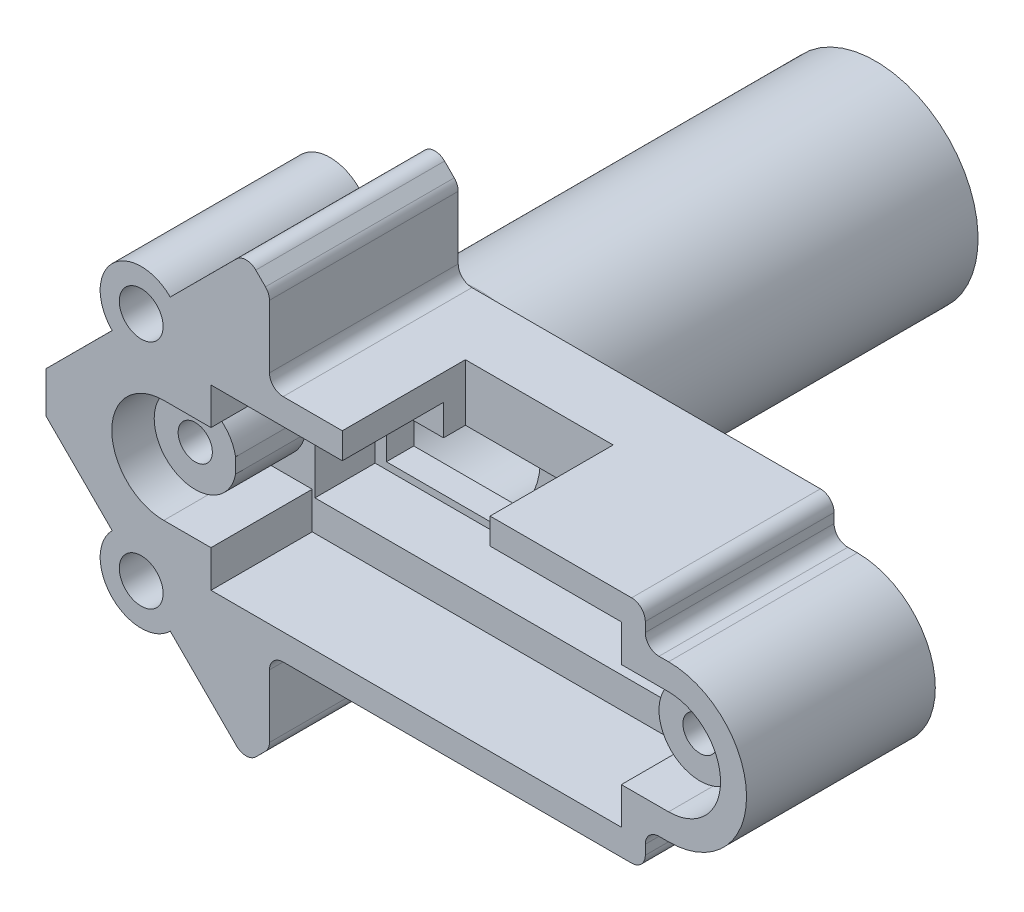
ISO-10303-21;
HEADER;
FILE_DESCRIPTION(('STEP AP214'),'2;1');
FILE_NAME('part.step','',(''),(''),'','','');
FILE_SCHEMA(('AUTOMOTIVE_DESIGN { 1 0 10303 214 1 1 1 1 }'));
ENDSEC;
DATA;
#1=APPLICATION_CONTEXT('core data for automotive mechanical design processes');
#2=APPLICATION_PROTOCOL_DEFINITION('international standard','automotive_design',2000,#1);
#3=PRODUCT_CONTEXT('',#1,'mechanical');
#4=PRODUCT('Part','Part','',(#3));
#5=PRODUCT_RELATED_PRODUCT_CATEGORY('part','',(#4));
#6=PRODUCT_DEFINITION_FORMATION('','',#4);
#7=PRODUCT_DEFINITION_CONTEXT('part definition',#1,'design');
#8=PRODUCT_DEFINITION('design','',#6,#7);
#9=PRODUCT_DEFINITION_SHAPE('','',#8);
#10=(LENGTH_UNIT() NAMED_UNIT(*) SI_UNIT(.MILLI.,.METRE.));
#11=(NAMED_UNIT(*) PLANE_ANGLE_UNIT() SI_UNIT($,.RADIAN.));
#12=(NAMED_UNIT(*) SI_UNIT($,.STERADIAN.) SOLID_ANGLE_UNIT());
#13=UNCERTAINTY_MEASURE_WITH_UNIT(LENGTH_MEASURE(1.E-05),#10,'distance_accuracy_value','');
#14=(GEOMETRIC_REPRESENTATION_CONTEXT(3) GLOBAL_UNCERTAINTY_ASSIGNED_CONTEXT((#13)) GLOBAL_UNIT_ASSIGNED_CONTEXT((#10,
#11,#12)) REPRESENTATION_CONTEXT('',''));
#15=CARTESIAN_POINT('',(0.,0.,0.));
#16=DIRECTION('',(0.,0.,1.));
#17=DIRECTION('',(1.,0.,0.));
#18=AXIS2_PLACEMENT_3D('',#15,#16,#17);
#19=CARTESIAN_POINT('',(0.,0.,0.));
#20=DIRECTION('',(0.,0.,1.));
#21=DIRECTION('',(1.,0.,0.));
#22=AXIS2_PLACEMENT_3D('',#19,#20,#21);
#23=PLANE('',#22);
#24=DIRECTION('',(-1.,0.,0.));
#25=VECTOR('',#24,1.);
#26=CARTESIAN_POINT('',(0.,3.75,0.));
#27=LINE('',#26,#25);
#28=CARTESIAN_POINT('',(32.425,3.75,0.));
#29=VERTEX_POINT('',#28);
#30=CARTESIAN_POINT('',(15.8530731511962,3.75,0.));
#31=VERTEX_POINT('',#30);
#32=EDGE_CURVE('E624',#29,#31,#27,.T.);
#33=ORIENTED_EDGE('',*,*,#32,.T.);
#34=CARTESIAN_POINT('',(8.225,0.,0.));
#35=DIRECTION('',(0.,0.,1.));
#36=DIRECTION('',(1.,0.,0.));
#37=AXIS2_PLACEMENT_3D('',#34,#35,#36);
#38=CIRCLE('',#37,8.5);
#39=CARTESIAN_POINT('',(9.525,8.4,0.));
#40=VERTEX_POINT('',#39);
#41=EDGE_CURVE('E222',#31,#40,#38,.T.);
#42=ORIENTED_EDGE('',*,*,#41,.T.);
#43=DIRECTION('',(-1.,0.,0.));
#44=VECTOR('',#43,1.);
#45=CARTESIAN_POINT('',(1.7,8.4,0.));
#46=LINE('',#45,#44);
#47=CARTESIAN_POINT('',(34.2,8.4,0.));
#48=VERTEX_POINT('',#47);
#49=EDGE_CURVE('E1097',#48,#40,#46,.T.);
#50=ORIENTED_EDGE('',*,*,#49,.F.);
#51=CARTESIAN_POINT('',(34.2,7.4,0.));
#52=DIRECTION('',(0.,0.,1.));
#53=DIRECTION('',(1.,0.,0.));
#54=AXIS2_PLACEMENT_3D('',#51,#52,#53);
#55=CIRCLE('',#54,1.);
#56=CARTESIAN_POINT('',(35.2,7.4,0.));
#57=VERTEX_POINT('',#56);
#58=EDGE_CURVE('E1191',#48,#57,#55,.F.);
#59=ORIENTED_EDGE('',*,*,#58,.T.);
#60=DIRECTION('',(0.,1.,0.));
#61=VECTOR('',#60,1.);
#62=CARTESIAN_POINT('',(35.2,5.7,0.));
#63=LINE('',#62,#61);
#64=CARTESIAN_POINT('',(35.2,6.7,0.));
#65=VERTEX_POINT('',#64);
#66=EDGE_CURVE('E1138',#65,#57,#63,.T.);
#67=ORIENTED_EDGE('',*,*,#66,.F.);
#68=CARTESIAN_POINT('',(36.2,6.7,0.));
#69=DIRECTION('',(0.,0.,1.));
#70=DIRECTION('',(1.,0.,0.));
#71=AXIS2_PLACEMENT_3D('',#68,#69,#70);
#72=CIRCLE('',#71,1.);
#73=CARTESIAN_POINT('',(36.2,5.7,0.));
#74=VERTEX_POINT('',#73);
#75=EDGE_CURVE('E1243',#65,#74,#72,.T.);
#76=ORIENTED_EDGE('',*,*,#75,.T.);
#77=DIRECTION('',(-1.,0.,0.));
#78=VECTOR('',#77,1.);
#79=CARTESIAN_POINT('',(36.9,5.7,0.));
#80=LINE('',#79,#78);
#81=CARTESIAN_POINT('',(36.9,5.7,0.));
#82=VERTEX_POINT('',#81);
#83=EDGE_CURVE('E1134',#82,#74,#80,.T.);
#84=ORIENTED_EDGE('',*,*,#83,.F.);
#85=CARTESIAN_POINT('',(36.9,0.,0.));
#86=DIRECTION('',(0.,0.,1.));
#87=DIRECTION('',(1.,0.,0.));
#88=AXIS2_PLACEMENT_3D('',#85,#86,#87);
#89=CIRCLE('',#88,5.7);
#90=CARTESIAN_POINT('',(36.9,-5.7,0.));
#91=VERTEX_POINT('',#90);
#92=EDGE_CURVE('E1132',#91,#82,#89,.T.);
#93=ORIENTED_EDGE('',*,*,#92,.F.);
#94=DIRECTION('',(1.,0.,0.));
#95=VECTOR('',#94,1.);
#96=CARTESIAN_POINT('',(36.9,-5.7,0.));
#97=LINE('',#96,#95);
#98=CARTESIAN_POINT('',(36.2,-5.7,0.));
#99=VERTEX_POINT('',#98);
#100=EDGE_CURVE('E1129',#99,#91,#97,.T.);
#101=ORIENTED_EDGE('',*,*,#100,.F.);
#102=CARTESIAN_POINT('',(36.2,-6.7,0.));
#103=DIRECTION('',(0.,0.,1.));
#104=DIRECTION('',(1.,0.,0.));
#105=AXIS2_PLACEMENT_3D('',#102,#103,#104);
#106=CIRCLE('',#105,1.);
#107=CARTESIAN_POINT('',(35.2,-6.7,0.));
#108=VERTEX_POINT('',#107);
#109=EDGE_CURVE('E1237',#99,#108,#106,.T.);
#110=ORIENTED_EDGE('',*,*,#109,.T.);
#111=DIRECTION('',(0.,1.,0.));
#112=VECTOR('',#111,1.);
#113=CARTESIAN_POINT('',(35.2,-8.4,0.));
#114=LINE('',#113,#112);
#115=CARTESIAN_POINT('',(35.2,-7.4,0.));
#116=VERTEX_POINT('',#115);
#117=EDGE_CURVE('E1125',#116,#108,#114,.T.);
#118=ORIENTED_EDGE('',*,*,#117,.F.);
#119=CARTESIAN_POINT('',(34.2,-7.4,0.));
#120=DIRECTION('',(0.,0.,1.));
#121=DIRECTION('',(1.,0.,0.));
#122=AXIS2_PLACEMENT_3D('',#119,#120,#121);
#123=CIRCLE('',#122,1.);
#124=CARTESIAN_POINT('',(34.2,-8.4,0.));
#125=VERTEX_POINT('',#124);
#126=EDGE_CURVE('E1194',#116,#125,#123,.F.);
#127=ORIENTED_EDGE('',*,*,#126,.T.);
#128=DIRECTION('',(1.,0.,0.));
#129=VECTOR('',#128,1.);
#130=CARTESIAN_POINT('',(1.7,-8.4,0.));
#131=LINE('',#130,#129);
#132=CARTESIAN_POINT('',(9.525,-8.4,0.));
#133=VERTEX_POINT('',#132);
#134=EDGE_CURVE('E1083',#133,#125,#131,.T.);
#135=ORIENTED_EDGE('',*,*,#134,.F.);
#136=CARTESIAN_POINT('',(8.225,0.,0.));
#137=DIRECTION('',(0.,0.,1.));
#138=DIRECTION('',(1.,0.,0.));
#139=AXIS2_PLACEMENT_3D('',#136,#137,#138);
#140=CIRCLE('',#139,8.5);
#141=CARTESIAN_POINT('',(15.8530731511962,-3.75,0.));
#142=VERTEX_POINT('',#141);
#143=EDGE_CURVE('E1411',#133,#142,#140,.T.);
#144=ORIENTED_EDGE('',*,*,#143,.T.);
#145=DIRECTION('',(1.,0.,0.));
#146=VECTOR('',#145,1.);
#147=CARTESIAN_POINT('',(0.,-3.75,0.));
#148=LINE('',#147,#146);
#149=CARTESIAN_POINT('',(32.425,-3.75,0.));
#150=VERTEX_POINT('',#149);
#151=EDGE_CURVE('E1155',#142,#150,#148,.T.);
#152=ORIENTED_EDGE('',*,*,#151,.T.);
#153=DIRECTION('',(0.,1.,0.));
#154=VECTOR('',#153,1.);
#155=CARTESIAN_POINT('',(32.425,0.,0.));
#156=LINE('',#155,#154);
#157=EDGE_CURVE('E1158',#150,#29,#156,.T.);
#158=ORIENTED_EDGE('',*,*,#157,.T.);
#159=EDGE_LOOP('',(#33,#42,#50,#59,#67,#76,#84,#93,#101,#110,#118,#127,#135,#144,#152,#158));
#160=FACE_BOUND('',#159,.T.);
#161=ADVANCED_FACE('F191',(#160),#23,.F.);
#162=CARTESIAN_POINT('',(4.475,-3.75,0.));
#163=VERTEX_POINT('',#162);
#164=CARTESIAN_POINT('',(12.2483692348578,-3.75,0.));
#165=VERTEX_POINT('',#164);
#166=EDGE_CURVE('E629',#163,#165,#148,.T.);
#167=ORIENTED_EDGE('',*,*,#166,.T.);
#168=CARTESIAN_POINT('',(8.225,0.,0.));
#169=DIRECTION('',(0.,0.,-1.));
#170=DIRECTION('',(-1.,0.,0.));
#171=AXIS2_PLACEMENT_3D('',#168,#169,#170);
#172=CIRCLE('',#171,5.5);
#173=CARTESIAN_POINT('',(12.2483692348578,3.75,0.));
#174=VERTEX_POINT('',#173);
#175=EDGE_CURVE('E627',#165,#174,#172,.T.);
#176=ORIENTED_EDGE('',*,*,#175,.T.);
#177=CARTESIAN_POINT('',(4.475,3.75,0.));
#178=VERTEX_POINT('',#177);
#179=EDGE_CURVE('E608',#174,#178,#27,.T.);
#180=ORIENTED_EDGE('',*,*,#179,.T.);
#181=DIRECTION('',(0.,-1.,0.));
#182=VECTOR('',#181,1.);
#183=CARTESIAN_POINT('',(4.475,0.,0.));
#184=LINE('',#183,#182);
#185=EDGE_CURVE('E1152',#178,#163,#184,.T.);
#186=ORIENTED_EDGE('',*,*,#185,.T.);
#187=EDGE_LOOP('',(#167,#176,#180,#186));
#188=FACE_BOUND('',#187,.T.);
#189=ADVANCED_FACE('F628',(#188),#23,.F.);
#190=CARTESIAN_POINT('',(0.,0.,13.8));
#191=DIRECTION('',(0.,0.,1.));
#192=DIRECTION('',(1.,0.,0.));
#193=AXIS2_PLACEMENT_3D('',#190,#191,#192);
#194=PLANE('',#193);
#195=DIRECTION('',(1.,0.,0.));
#196=VECTOR('',#195,1.);
#197=CARTESIAN_POINT('',(0.,-3.8,13.8));
#198=LINE('',#197,#196);
#199=CARTESIAN_POINT('',(0.,-3.8,13.8));
#200=VERTEX_POINT('',#199);
#201=CARTESIAN_POINT('',(3.44999999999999,-3.8,13.8));
#202=VERTEX_POINT('',#201);
#203=EDGE_CURVE('E662',#200,#202,#198,.T.);
#204=ORIENTED_EDGE('',*,*,#203,.F.);
#205=CARTESIAN_POINT('',(0.,0.,13.8));
#206=DIRECTION('',(0.,0.,1.));
#207=DIRECTION('',(1.,0.,0.));
#208=AXIS2_PLACEMENT_3D('',#205,#206,#207);
#209=CIRCLE('',#208,3.8);
#210=CARTESIAN_POINT('',(0.,3.8,13.8));
#211=VERTEX_POINT('',#210);
#212=EDGE_CURVE('E666',#211,#200,#209,.T.);
#213=ORIENTED_EDGE('',*,*,#212,.F.);
#214=DIRECTION('',(1.,0.,0.));
#215=VECTOR('',#214,1.);
#216=CARTESIAN_POINT('',(0.,3.8,13.8));
#217=LINE('',#216,#215);
#218=CARTESIAN_POINT('',(3.44999999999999,3.8,13.8));
#219=VERTEX_POINT('',#218);
#220=EDGE_CURVE('E670',#211,#219,#217,.T.);
#221=ORIENTED_EDGE('',*,*,#220,.T.);
#222=DIRECTION('',(0.,1.,0.));
#223=VECTOR('',#222,1.);
#224=CARTESIAN_POINT('',(3.44999999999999,0.,13.8));
#225=LINE('',#224,#223);
#226=CARTESIAN_POINT('',(3.44999999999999,6.49999999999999,13.8));
#227=VERTEX_POINT('',#226);
#228=EDGE_CURVE('E732',#219,#227,#225,.T.);
#229=ORIENTED_EDGE('',*,*,#228,.T.);
#230=DIRECTION('',(-1.,0.,0.));
#231=VECTOR('',#230,1.);
#232=CARTESIAN_POINT('',(0.,6.49999999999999,13.8));
#233=LINE('',#232,#231);
#234=CARTESIAN_POINT('',(13.05,6.5,13.8));
#235=VERTEX_POINT('',#234);
#236=EDGE_CURVE('E762',#235,#227,#233,.T.);
#237=ORIENTED_EDGE('',*,*,#236,.F.);
#238=DIRECTION('',(0.,1.,0.));
#239=VECTOR('',#238,1.);
#240=CARTESIAN_POINT('',(13.05,3.4,13.8));
#241=LINE('',#240,#239);
#242=CARTESIAN_POINT('',(13.05,8.4,13.8));
#243=VERTEX_POINT('',#242);
#244=EDGE_CURVE('E966',#235,#243,#241,.T.);
#245=ORIENTED_EDGE('',*,*,#244,.T.);
#246=DIRECTION('',(-1.,0.,0.));
#247=VECTOR('',#246,1.);
#248=CARTESIAN_POINT('',(1.7,8.4,13.8));
#249=LINE('',#248,#247);
#250=CARTESIAN_POINT('',(8.72456617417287,8.4,13.8));
#251=VERTEX_POINT('',#250);
#252=EDGE_CURVE('E1115',#243,#251,#249,.T.);
#253=ORIENTED_EDGE('',*,*,#252,.T.);
#254=CARTESIAN_POINT('',(8.72456617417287,9.4,13.8));
#255=DIRECTION('',(0.,0.,1.));
#256=DIRECTION('',(1.,0.,0.));
#257=AXIS2_PLACEMENT_3D('',#254,#255,#256);
#258=CIRCLE('',#257,1.);
#259=CARTESIAN_POINT('',(7.72456617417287,9.4,13.8));
#260=VERTEX_POINT('',#259);
#261=EDGE_CURVE('E1249',#251,#260,#258,.F.);
#262=ORIENTED_EDGE('',*,*,#261,.T.);
#263=DIRECTION('',(0.,-1.,0.));
#264=VECTOR('',#263,1.);
#265=CARTESIAN_POINT('',(7.72456617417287,0.,13.8));
#266=LINE('',#265,#264);
#267=CARTESIAN_POINT('',(7.72456617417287,13.9961386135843,13.8));
#268=VERTEX_POINT('',#267);
#269=EDGE_CURVE('E792',#268,#260,#266,.T.);
#270=ORIENTED_EDGE('',*,*,#269,.F.);
#271=CARTESIAN_POINT('',(6.72456617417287,13.9961386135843,13.8));
#272=DIRECTION('',(0.,0.,-1.));
#273=DIRECTION('',(-1.,0.,0.));
#274=AXIS2_PLACEMENT_3D('',#271,#272,#273);
#275=CIRCLE('',#274,1.);
#276=CARTESIAN_POINT('',(7.43192699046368,14.7029912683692,13.8));
#277=VERTEX_POINT('',#276);
#278=EDGE_CURVE('E885',#277,#268,#275,.T.);
#279=ORIENTED_EDGE('',*,*,#278,.F.);
#280=DIRECTION('',(0.706852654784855,-0.70736081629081,0.));
#281=VECTOR('',#280,1.);
#282=CARTESIAN_POINT('',(6.72507433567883,15.41035208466,13.8));
#283=LINE('',#282,#281);
#284=CARTESIAN_POINT('',(6.72507433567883,15.41035208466,13.8));
#285=VERTEX_POINT('',#284);
#286=EDGE_CURVE('E881',#285,#277,#283,.T.);
#287=ORIENTED_EDGE('',*,*,#286,.F.);
#288=CARTESIAN_POINT('',(6.01771351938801,14.7034994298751,13.8));
#289=DIRECTION('',(0.,0.,-1.));
#290=DIRECTION('',(-1.,0.,0.));
#291=AXIS2_PLACEMENT_3D('',#288,#289,#290);
#292=CIRCLE('',#291,0.999999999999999);
#293=CARTESIAN_POINT('',(5.31086086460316,15.4108602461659,13.8));
#294=VERTEX_POINT('',#293);
#295=EDGE_CURVE('E877',#294,#285,#292,.T.);
#296=ORIENTED_EDGE('',*,*,#295,.F.);
#297=DIRECTION('',(0.707360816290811,0.706852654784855,0.));
#298=VECTOR('',#297,1.);
#299=CARTESIAN_POINT('',(0.472082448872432,10.5755579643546,13.8));
#300=LINE('',#299,#298);
#301=CARTESIAN_POINT('',(0.472082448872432,10.5755579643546,13.8));
#302=VERTEX_POINT('',#301);
#303=EDGE_CURVE('E873',#302,#294,#300,.T.);
#304=ORIENTED_EDGE('',*,*,#303,.F.);
#305=CARTESIAN_POINT('',(-1.65,8.45499999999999,13.8));
#306=DIRECTION('',(0.,0.,1.));
#307=DIRECTION('',(1.,0.,0.));
#308=AXIS2_PLACEMENT_3D('',#305,#306,#307);
#309=CIRCLE('',#308,3.);
#310=CARTESIAN_POINT('',(-3.77208244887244,6.33444203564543,13.8));
#311=VERTEX_POINT('',#310);
#312=EDGE_CURVE('E869',#302,#311,#309,.T.);
#313=ORIENTED_EDGE('',*,*,#312,.T.);
#314=DIRECTION('',(0.707360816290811,0.706852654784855,0.));
#315=VECTOR('',#314,1.);
#316=CARTESIAN_POINT('',(-8.61,1.49999999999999,13.8));
#317=LINE('',#316,#315);
#318=CARTESIAN_POINT('',(-8.61,1.49999999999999,13.8));
#319=VERTEX_POINT('',#318);
#320=EDGE_CURVE('E865',#319,#311,#317,.T.);
#321=ORIENTED_EDGE('',*,*,#320,.F.);
#322=DIRECTION('',(0.,-1.,0.));
#323=VECTOR('',#322,1.);
#324=CARTESIAN_POINT('',(-8.61,1.49999999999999,13.8));
#325=LINE('',#324,#323);
#326=CARTESIAN_POINT('',(-8.61,-1.50000000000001,13.8));
#327=VERTEX_POINT('',#326);
#328=EDGE_CURVE('E912',#319,#327,#325,.T.);
#329=ORIENTED_EDGE('',*,*,#328,.T.);
#330=DIRECTION('',(0.707360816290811,-0.706852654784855,0.));
#331=VECTOR('',#330,1.);
#332=CARTESIAN_POINT('',(-8.61,-1.50000000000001,13.8));
#333=LINE('',#332,#331);
#334=CARTESIAN_POINT('',(-3.77208244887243,-6.33444203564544,13.8));
#335=VERTEX_POINT('',#334);
#336=EDGE_CURVE('E908',#327,#335,#333,.T.);
#337=ORIENTED_EDGE('',*,*,#336,.T.);
#338=CARTESIAN_POINT('',(-1.65,-8.45500000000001,13.8));
#339=DIRECTION('',(0.,0.,1.));
#340=DIRECTION('',(1.,0.,0.));
#341=AXIS2_PLACEMENT_3D('',#338,#339,#340);
#342=CIRCLE('',#341,3.);
#343=CARTESIAN_POINT('',(0.472082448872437,-10.5755579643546,13.8));
#344=VERTEX_POINT('',#343);
#345=EDGE_CURVE('E904',#335,#344,#342,.T.);
#346=ORIENTED_EDGE('',*,*,#345,.T.);
#347=DIRECTION('',(0.707360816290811,-0.706852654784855,0.));
#348=VECTOR('',#347,1.);
#349=CARTESIAN_POINT('',(0.472082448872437,-10.5755579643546,13.8));
#350=LINE('',#349,#348);
#351=CARTESIAN_POINT('',(5.31086086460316,-15.410860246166,13.8));
#352=VERTEX_POINT('',#351);
#353=EDGE_CURVE('E900',#344,#352,#350,.T.);
#354=ORIENTED_EDGE('',*,*,#353,.T.);
#355=CARTESIAN_POINT('',(6.01771351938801,-14.7034994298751,13.8));
#356=DIRECTION('',(0.,0.,1.));
#357=DIRECTION('',(1.,0.,0.));
#358=AXIS2_PLACEMENT_3D('',#355,#356,#357);
#359=CIRCLE('',#358,1.);
#360=CARTESIAN_POINT('',(6.72507433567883,-15.41035208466,13.8));
#361=VERTEX_POINT('',#360);
#362=EDGE_CURVE('E896',#352,#361,#359,.T.);
#363=ORIENTED_EDGE('',*,*,#362,.T.);
#364=DIRECTION('',(0.706852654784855,0.70736081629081,0.));
#365=VECTOR('',#364,1.);
#366=CARTESIAN_POINT('',(6.72507433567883,-15.41035208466,13.8));
#367=LINE('',#366,#365);
#368=CARTESIAN_POINT('',(7.43192699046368,-14.7029912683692,13.8));
#369=VERTEX_POINT('',#368);
#370=EDGE_CURVE('E892',#361,#369,#367,.T.);
#371=ORIENTED_EDGE('',*,*,#370,.T.);
#372=CARTESIAN_POINT('',(6.72456617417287,-13.9961386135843,13.8));
#373=DIRECTION('',(0.,0.,1.));
#374=DIRECTION('',(1.,0.,0.));
#375=AXIS2_PLACEMENT_3D('',#372,#373,#374);
#376=CIRCLE('',#375,1.);
#377=CARTESIAN_POINT('',(7.72456617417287,-13.9961386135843,13.8));
#378=VERTEX_POINT('',#377);
#379=EDGE_CURVE('E888',#369,#378,#376,.T.);
#380=ORIENTED_EDGE('',*,*,#379,.T.);
#381=DIRECTION('',(0.,1.,0.));
#382=VECTOR('',#381,1.);
#383=CARTESIAN_POINT('',(7.72456617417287,-13.9961386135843,13.8));
#384=LINE('',#383,#382);
#385=CARTESIAN_POINT('',(7.72456617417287,-9.4,13.8));
#386=VERTEX_POINT('',#385);
#387=EDGE_CURVE('E796',#378,#386,#384,.T.);
#388=ORIENTED_EDGE('',*,*,#387,.T.);
#389=CARTESIAN_POINT('',(8.72456617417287,-9.4,13.8));
#390=DIRECTION('',(0.,0.,1.));
#391=DIRECTION('',(1.,0.,0.));
#392=AXIS2_PLACEMENT_3D('',#389,#390,#391);
#393=CIRCLE('',#392,1.);
#394=CARTESIAN_POINT('',(8.72456617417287,-8.4,13.8));
#395=VERTEX_POINT('',#394);
#396=EDGE_CURVE('E1229',#386,#395,#393,.F.);
#397=ORIENTED_EDGE('',*,*,#396,.T.);
#398=DIRECTION('',(1.,0.,0.));
#399=VECTOR('',#398,1.);
#400=CARTESIAN_POINT('',(1.7,-8.4,13.8));
#401=LINE('',#400,#399);
#402=CARTESIAN_POINT('',(34.2,-8.4,13.8));
#403=VERTEX_POINT('',#402);
#404=EDGE_CURVE('E1092',#395,#403,#401,.T.);
#405=ORIENTED_EDGE('',*,*,#404,.T.);
#406=CARTESIAN_POINT('',(34.2,-7.4,13.8));
#407=DIRECTION('',(0.,0.,1.));
#408=DIRECTION('',(1.,0.,0.));
#409=AXIS2_PLACEMENT_3D('',#406,#407,#408);
#410=CIRCLE('',#409,1.);
#411=CARTESIAN_POINT('',(35.2,-7.4,13.8));
#412=VERTEX_POINT('',#411);
#413=EDGE_CURVE('E1201',#403,#412,#410,.T.);
#414=ORIENTED_EDGE('',*,*,#413,.T.);
#415=DIRECTION('',(0.,1.,0.));
#416=VECTOR('',#415,1.);
#417=CARTESIAN_POINT('',(35.2,-8.4,13.8));
#418=LINE('',#417,#416);
#419=CARTESIAN_POINT('',(35.2,-6.7,13.8));
#420=VERTEX_POINT('',#419);
#421=EDGE_CURVE('E1096',#412,#420,#418,.T.);
#422=ORIENTED_EDGE('',*,*,#421,.T.);
#423=CARTESIAN_POINT('',(36.2,-6.7,13.8));
#424=DIRECTION('',(0.,0.,1.));
#425=DIRECTION('',(1.,0.,0.));
#426=AXIS2_PLACEMENT_3D('',#423,#424,#425);
#427=CIRCLE('',#426,1.);
#428=CARTESIAN_POINT('',(36.2,-5.7,13.8));
#429=VERTEX_POINT('',#428);
#430=EDGE_CURVE('E1240',#420,#429,#427,.F.);
#431=ORIENTED_EDGE('',*,*,#430,.T.);
#432=DIRECTION('',(1.,0.,0.));
#433=VECTOR('',#432,1.);
#434=CARTESIAN_POINT('',(36.9,-5.7,13.8));
#435=LINE('',#434,#433);
#436=CARTESIAN_POINT('',(36.9,-5.7,13.8));
#437=VERTEX_POINT('',#436);
#438=EDGE_CURVE('E1101',#429,#437,#435,.T.);
#439=ORIENTED_EDGE('',*,*,#438,.T.);
#440=CARTESIAN_POINT('',(36.9,0.,13.8));
#441=DIRECTION('',(0.,0.,1.));
#442=DIRECTION('',(1.,0.,0.));
#443=AXIS2_PLACEMENT_3D('',#440,#441,#442);
#444=CIRCLE('',#443,5.7);
#445=CARTESIAN_POINT('',(36.9,5.7,13.8));
#446=VERTEX_POINT('',#445);
#447=EDGE_CURVE('E1104',#437,#446,#444,.T.);
#448=ORIENTED_EDGE('',*,*,#447,.T.);
#449=DIRECTION('',(-1.,0.,0.));
#450=VECTOR('',#449,1.);
#451=CARTESIAN_POINT('',(36.9,5.7,13.8));
#452=LINE('',#451,#450);
#453=CARTESIAN_POINT('',(36.2,5.7,13.8));
#454=VERTEX_POINT('',#453);
#455=EDGE_CURVE('E1107',#446,#454,#452,.T.);
#456=ORIENTED_EDGE('',*,*,#455,.T.);
#457=CARTESIAN_POINT('',(36.2,6.7,13.8));
#458=DIRECTION('',(0.,0.,1.));
#459=DIRECTION('',(1.,0.,0.));
#460=AXIS2_PLACEMENT_3D('',#457,#458,#459);
#461=CIRCLE('',#460,1.);
#462=CARTESIAN_POINT('',(35.2,6.7,13.8));
#463=VERTEX_POINT('',#462);
#464=EDGE_CURVE('E1246',#454,#463,#461,.F.);
#465=ORIENTED_EDGE('',*,*,#464,.T.);
#466=DIRECTION('',(0.,1.,0.));
#467=VECTOR('',#466,1.);
#468=CARTESIAN_POINT('',(35.2,5.7,13.8));
#469=LINE('',#468,#467);
#470=CARTESIAN_POINT('',(35.2,7.4,13.8));
#471=VERTEX_POINT('',#470);
#472=EDGE_CURVE('E1111',#463,#471,#469,.T.);
#473=ORIENTED_EDGE('',*,*,#472,.T.);
#474=CARTESIAN_POINT('',(34.2,7.4,13.8));
#475=DIRECTION('',(0.,0.,1.));
#476=DIRECTION('',(1.,0.,0.));
#477=AXIS2_PLACEMENT_3D('',#474,#475,#476);
#478=CIRCLE('',#477,1.);
#479=CARTESIAN_POINT('',(34.2,8.4,13.8));
#480=VERTEX_POINT('',#479);
#481=EDGE_CURVE('E1198',#471,#480,#478,.T.);
#482=ORIENTED_EDGE('',*,*,#481,.T.);
#483=CARTESIAN_POINT('',(23.85,8.4,13.8));
#484=VERTEX_POINT('',#483);
#485=EDGE_CURVE('E1116',#480,#484,#249,.T.);
#486=ORIENTED_EDGE('',*,*,#485,.T.);
#487=DIRECTION('',(0.,1.,0.));
#488=VECTOR('',#487,1.);
#489=CARTESIAN_POINT('',(23.85,3.4,13.8));
#490=LINE('',#489,#488);
#491=CARTESIAN_POINT('',(23.85,6.5,13.8));
#492=VERTEX_POINT('',#491);
#493=EDGE_CURVE('E974',#492,#484,#490,.T.);
#494=ORIENTED_EDGE('',*,*,#493,.F.);
#495=CARTESIAN_POINT('',(33.45,6.5,13.8));
#496=VERTEX_POINT('',#495);
#497=EDGE_CURVE('E763',#496,#492,#233,.T.);
#498=ORIENTED_EDGE('',*,*,#497,.F.);
#499=DIRECTION('',(0.,1.,0.));
#500=VECTOR('',#499,1.);
#501=CARTESIAN_POINT('',(33.45,0.,13.8));
#502=LINE('',#501,#500);
#503=CARTESIAN_POINT('',(33.45,3.8,13.8));
#504=VERTEX_POINT('',#503);
#505=EDGE_CURVE('E757',#504,#496,#502,.T.);
#506=ORIENTED_EDGE('',*,*,#505,.F.);
#507=DIRECTION('',(-1.,0.,0.));
#508=VECTOR('',#507,1.);
#509=CARTESIAN_POINT('',(0.,3.80000000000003,13.8));
#510=LINE('',#509,#508);
#511=CARTESIAN_POINT('',(36.9,3.8,13.8));
#512=VERTEX_POINT('',#511);
#513=EDGE_CURVE('E702',#512,#504,#510,.T.);
#514=ORIENTED_EDGE('',*,*,#513,.F.);
#515=CARTESIAN_POINT('',(36.9,0.,13.8));
#516=DIRECTION('',(0.,0.,1.));
#517=DIRECTION('',(1.,0.,0.));
#518=AXIS2_PLACEMENT_3D('',#515,#516,#517);
#519=CIRCLE('',#518,3.8);
#520=CARTESIAN_POINT('',(36.9,-3.8,13.8));
#521=VERTEX_POINT('',#520);
#522=EDGE_CURVE('E706',#521,#512,#519,.T.);
#523=ORIENTED_EDGE('',*,*,#522,.F.);
#524=DIRECTION('',(-1.,0.,0.));
#525=VECTOR('',#524,1.);
#526=CARTESIAN_POINT('',(0.,-3.80000000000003,13.8));
#527=LINE('',#526,#525);
#528=CARTESIAN_POINT('',(33.45,-3.8,13.8));
#529=VERTEX_POINT('',#528);
#530=EDGE_CURVE('E711',#521,#529,#527,.T.);
#531=ORIENTED_EDGE('',*,*,#530,.T.);
#532=CARTESIAN_POINT('',(33.45,-6.5,13.8));
#533=VERTEX_POINT('',#532);
#534=EDGE_CURVE('E758',#533,#529,#502,.T.);
#535=ORIENTED_EDGE('',*,*,#534,.F.);
#536=DIRECTION('',(-1.,0.,0.));
#537=VECTOR('',#536,1.);
#538=CARTESIAN_POINT('',(0.,-6.50000000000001,13.8));
#539=LINE('',#538,#537);
#540=CARTESIAN_POINT('',(3.44999999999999,-6.50000000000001,13.8));
#541=VERTEX_POINT('',#540);
#542=EDGE_CURVE('E753',#533,#541,#539,.T.);
#543=ORIENTED_EDGE('',*,*,#542,.T.);
#544=EDGE_CURVE('E749',#541,#202,#225,.T.);
#545=ORIENTED_EDGE('',*,*,#544,.T.);
#546=EDGE_LOOP('',(#204,#213,#221,#229,#237,#245,#253,#262,#270,#279,#287,#296,#304,#313,#321,
#329,#337,#346,#354,#363,#371,#380,#388,#397,#405,#414,#422,#431,#439,#448,#456,#465,#473,#482,
#486,#494,#498,#506,#514,#523,#531,#535,#543,#545));
#547=FACE_BOUND('',#546,.T.);
#548=CARTESIAN_POINT('',(-1.65,8.45499999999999,13.8));
#549=DIRECTION('',(0.,0.,1.));
#550=DIRECTION('',(1.,0.,0.));
#551=AXIS2_PLACEMENT_3D('',#548,#549,#550);
#552=CIRCLE('',#551,1.6);
#553=CARTESIAN_POINT('',(-0.0500000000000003,8.45499999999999,13.8));
#554=VERTEX_POINT('',#553);
#555=EDGE_CURVE('E861',#554,#554,#552,.T.);
#556=ORIENTED_EDGE('',*,*,#555,.F.);
#557=EDGE_LOOP('',(#556));
#558=FACE_BOUND('',#557,.T.);
#559=CARTESIAN_POINT('',(-1.65,-8.45500000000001,13.8));
#560=DIRECTION('',(0.,0.,1.));
#561=DIRECTION('',(1.,0.,0.));
#562=AXIS2_PLACEMENT_3D('',#559,#560,#561);
#563=CIRCLE('',#562,1.6);
#564=CARTESIAN_POINT('',(-0.0499999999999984,-8.45500000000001,13.8));
#565=VERTEX_POINT('',#564);
#566=EDGE_CURVE('E790',#565,#565,#563,.T.);
#567=ORIENTED_EDGE('',*,*,#566,.F.);
#568=EDGE_LOOP('',(#567));
#569=FACE_BOUND('',#568,.T.);
#570=ADVANCED_FACE('F1443',(#547,#558,#569),#194,.T.);
#571=CARTESIAN_POINT('',(0.,0.,11.5));
#572=DIRECTION('',(0.,0.,-1.));
#573=DIRECTION('',(-1.,0.,0.));
#574=AXIS2_PLACEMENT_3D('',#571,#572,#573);
#575=CYLINDRICAL_SURFACE('',#574,3.);
#576=DIRECTION('',(0.,0.,-1.));
#577=VECTOR('',#576,1.);
#578=CARTESIAN_POINT('',(2.94999999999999,-0.545435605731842,11.5));
#579=LINE('',#578,#577);
#580=CARTESIAN_POINT('',(2.94999999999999,-0.545435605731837,11.5));
#581=VERTEX_POINT('',#580);
#582=CARTESIAN_POINT('',(2.94999999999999,-0.545435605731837,6.4));
#583=VERTEX_POINT('',#582);
#584=EDGE_CURVE('E729',#581,#583,#579,.T.);
#585=ORIENTED_EDGE('',*,*,#584,.F.);
#586=CARTESIAN_POINT('',(0.,0.,11.5));
#587=DIRECTION('',(0.,0.,1.));
#588=DIRECTION('',(1.,0.,0.));
#589=AXIS2_PLACEMENT_3D('',#586,#587,#588);
#590=CIRCLE('',#589,3.);
#591=CARTESIAN_POINT('',(2.94999999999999,0.545435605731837,11.5));
#592=VERTEX_POINT('',#591);
#593=EDGE_CURVE('E1009',#592,#581,#590,.T.);
#594=ORIENTED_EDGE('',*,*,#593,.F.);
#595=DIRECTION('',(0.,0.,-1.));
#596=VECTOR('',#595,1.);
#597=CARTESIAN_POINT('',(2.94999999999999,0.545435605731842,11.5));
#598=LINE('',#597,#596);
#599=CARTESIAN_POINT('',(2.94999999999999,0.545435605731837,6.4));
#600=VERTEX_POINT('',#599);
#601=EDGE_CURVE('E694',#600,#592,#598,.F.);
#602=ORIENTED_EDGE('',*,*,#601,.F.);
#603=CARTESIAN_POINT('',(0.,0.,6.4));
#604=DIRECTION('',(0.,0.,1.));
#605=DIRECTION('',(1.,0.,0.));
#606=AXIS2_PLACEMENT_3D('',#603,#604,#605);
#607=CIRCLE('',#606,3.);
#608=EDGE_CURVE('E1014',#600,#583,#607,.T.);
#609=ORIENTED_EDGE('',*,*,#608,.T.);
#610=EDGE_LOOP('',(#585,#594,#602,#609));
#611=FACE_BOUND('',#610,.T.);
#612=ADVANCED_FACE('F1445',(#611),#575,.T.);
#613=CARTESIAN_POINT('',(0.,0.,11.5));
#614=DIRECTION('',(0.,0.,1.));
#615=DIRECTION('',(1.,0.,0.));
#616=AXIS2_PLACEMENT_3D('',#613,#614,#615);
#617=PLANE('',#616);
#618=CARTESIAN_POINT('',(0.,0.,11.5));
#619=DIRECTION('',(0.,0.,1.));
#620=DIRECTION('',(1.,0.,0.));
#621=AXIS2_PLACEMENT_3D('',#618,#619,#620);
#622=CIRCLE('',#621,1.25);
#623=CARTESIAN_POINT('',(1.25,0.,11.5));
#624=VERTEX_POINT('',#623);
#625=EDGE_CURVE('E998',#624,#624,#622,.T.);
#626=ORIENTED_EDGE('',*,*,#625,.F.);
#627=EDGE_LOOP('',(#626));
#628=FACE_BOUND('',#627,.T.);
#629=ORIENTED_EDGE('',*,*,#593,.T.);
#630=DIRECTION('',(0.,1.,0.));
#631=VECTOR('',#630,1.);
#632=CARTESIAN_POINT('',(2.94999999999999,0.,11.5));
#633=LINE('',#632,#631);
#634=EDGE_CURVE('E1268',#581,#592,#633,.T.);
#635=ORIENTED_EDGE('',*,*,#634,.T.);
#636=EDGE_LOOP('',(#629,#635));
#637=FACE_BOUND('',#636,.T.);
#638=ADVANCED_FACE('F2046',(#628,#637),#617,.T.);
#639=CARTESIAN_POINT('',(3.44999999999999,0.,-26.2955654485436));
#640=DIRECTION('',(1.,0.,0.));
#641=DIRECTION('',(0.,0.,-1.));
#642=AXIS2_PLACEMENT_3D('',#639,#640,#641);
#643=PLANE('',#642);
#644=ORIENTED_EDGE('',*,*,#228,.F.);
#645=DIRECTION('',(0.,0.,1.));
#646=VECTOR('',#645,1.);
#647=CARTESIAN_POINT('',(3.44999999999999,3.8,-4.24248561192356));
#648=LINE('',#647,#646);
#649=CARTESIAN_POINT('',(3.44999999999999,3.8,6.4));
#650=VERTEX_POINT('',#649);
#651=EDGE_CURVE('E680',#650,#219,#648,.T.);
#652=ORIENTED_EDGE('',*,*,#651,.F.);
#653=DIRECTION('',(0.,-1.,0.));
#654=VECTOR('',#653,1.);
#655=CARTESIAN_POINT('',(3.44999999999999,0.,6.4));
#656=LINE('',#655,#654);
#657=CARTESIAN_POINT('',(3.44999999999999,6.49999999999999,6.4));
#658=VERTEX_POINT('',#657);
#659=EDGE_CURVE('E744',#658,#650,#656,.T.);
#660=ORIENTED_EDGE('',*,*,#659,.F.);
#661=DIRECTION('',(0.,0.,1.));
#662=VECTOR('',#661,1.);
#663=CARTESIAN_POINT('',(3.44999999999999,6.49999999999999,-26.2955654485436));
#664=LINE('',#663,#662);
#665=EDGE_CURVE('E767',#658,#227,#664,.T.);
#666=ORIENTED_EDGE('',*,*,#665,.T.);
#667=EDGE_LOOP('',(#644,#652,#660,#666));
#668=FACE_BOUND('',#667,.T.);
#669=ADVANCED_FACE('F1794',(#668),#643,.T.);
#670=CARTESIAN_POINT('',(33.45,0.,-26.2955654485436));
#671=DIRECTION('',(1.,0.,0.));
#672=DIRECTION('',(0.,1.,0.));
#673=AXIS2_PLACEMENT_3D('',#670,#671,#672);
#674=PLANE('',#673);
#675=DIRECTION('',(0.,0.,1.));
#676=VECTOR('',#675,1.);
#677=CARTESIAN_POINT('',(33.45,-3.8,-26.2955654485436));
#678=LINE('',#677,#676);
#679=CARTESIAN_POINT('',(33.45,-3.8,6.4));
#680=VERTEX_POINT('',#679);
#681=EDGE_CURVE('E1261',#680,#529,#678,.T.);
#682=ORIENTED_EDGE('',*,*,#681,.F.);
#683=DIRECTION('',(0.,-1.,0.));
#684=VECTOR('',#683,1.);
#685=CARTESIAN_POINT('',(33.45,0.,6.4));
#686=LINE('',#685,#684);
#687=CARTESIAN_POINT('',(33.45,-6.5,6.4));
#688=VERTEX_POINT('',#687);
#689=EDGE_CURVE('E738',#680,#688,#686,.T.);
#690=ORIENTED_EDGE('',*,*,#689,.T.);
#691=DIRECTION('',(0.,0.,1.));
#692=VECTOR('',#691,1.);
#693=CARTESIAN_POINT('',(33.45,-6.5,-26.2955654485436));
#694=LINE('',#693,#692);
#695=EDGE_CURVE('E776',#688,#533,#694,.T.);
#696=ORIENTED_EDGE('',*,*,#695,.T.);
#697=ORIENTED_EDGE('',*,*,#534,.T.);
#698=EDGE_LOOP('',(#682,#690,#696,#697));
#699=FACE_BOUND('',#698,.T.);
#700=ADVANCED_FACE('F1936',(#699),#674,.F.);
#701=CARTESIAN_POINT('',(33.25,-4.25,2.));
#702=DIRECTION('',(1.,0.,0.));
#703=DIRECTION('',(0.,0.,-1.));
#704=AXIS2_PLACEMENT_3D('',#701,#702,#703);
#705=PLANE('',#704);
#706=DIRECTION('',(0.,-1.,0.));
#707=VECTOR('',#706,1.);
#708=CARTESIAN_POINT('',(33.25,-4.25,6.4));
#709=LINE('',#708,#707);
#710=CARTESIAN_POINT('',(33.25,4.25,6.4));
#711=VERTEX_POINT('',#710);
#712=CARTESIAN_POINT('',(33.25,-4.25,6.4));
#713=VERTEX_POINT('',#712);
#714=EDGE_CURVE('E1031',#711,#713,#709,.T.);
#715=ORIENTED_EDGE('',*,*,#714,.F.);
#716=DIRECTION('',(0.,0.,1.));
#717=VECTOR('',#716,1.);
#718=CARTESIAN_POINT('',(33.25,4.25,2.));
#719=LINE('',#718,#717);
#720=CARTESIAN_POINT('',(33.25,4.25,2.));
#721=VERTEX_POINT('',#720);
#722=EDGE_CURVE('E1050',#721,#711,#719,.T.);
#723=ORIENTED_EDGE('',*,*,#722,.F.);
#724=DIRECTION('',(0.,1.,0.));
#725=VECTOR('',#724,1.);
#726=CARTESIAN_POINT('',(33.25,-4.25,2.));
#727=LINE('',#726,#725);
#728=CARTESIAN_POINT('',(33.25,-4.25,2.));
#729=VERTEX_POINT('',#728);
#730=EDGE_CURVE('E1034',#729,#721,#727,.T.);
#731=ORIENTED_EDGE('',*,*,#730,.F.);
#732=DIRECTION('',(0.,0.,1.));
#733=VECTOR('',#732,1.);
#734=CARTESIAN_POINT('',(33.25,-4.25,2.));
#735=LINE('',#734,#733);
#736=EDGE_CURVE('E1051',#729,#713,#735,.T.);
#737=ORIENTED_EDGE('',*,*,#736,.T.);
#738=EDGE_LOOP('',(#715,#723,#731,#737));
#739=FACE_BOUND('',#738,.T.);
#740=ADVANCED_FACE('F2073',(#739),#705,.F.);
#741=CARTESIAN_POINT('',(3.65,-4.25,2.));
#742=DIRECTION('',(-1.,0.,0.));
#743=DIRECTION('',(0.,0.,1.));
#744=AXIS2_PLACEMENT_3D('',#741,#742,#743);
#745=PLANE('',#744);
#746=DIRECTION('',(0.,1.,0.));
#747=VECTOR('',#746,1.);
#748=CARTESIAN_POINT('',(3.65,-4.25,6.4));
#749=LINE('',#748,#747);
#750=CARTESIAN_POINT('',(3.65,-4.25,6.4));
#751=VERTEX_POINT('',#750);
#752=CARTESIAN_POINT('',(3.65,4.25,6.4));
#753=VERTEX_POINT('',#752);
#754=EDGE_CURVE('E1013',#751,#753,#749,.T.);
#755=ORIENTED_EDGE('',*,*,#754,.F.);
#756=DIRECTION('',(0.,0.,1.));
#757=VECTOR('',#756,1.);
#758=CARTESIAN_POINT('',(3.65,-4.25,2.));
#759=LINE('',#758,#757);
#760=CARTESIAN_POINT('',(3.65,-4.25,2.));
#761=VERTEX_POINT('',#760);
#762=EDGE_CURVE('E1056',#761,#751,#759,.T.);
#763=ORIENTED_EDGE('',*,*,#762,.F.);
#764=DIRECTION('',(0.,-1.,0.));
#765=VECTOR('',#764,1.);
#766=CARTESIAN_POINT('',(3.65,-4.25,2.));
#767=LINE('',#766,#765);
#768=CARTESIAN_POINT('',(3.65,4.25,2.));
#769=VERTEX_POINT('',#768);
#770=EDGE_CURVE('E1042',#769,#761,#767,.T.);
#771=ORIENTED_EDGE('',*,*,#770,.F.);
#772=DIRECTION('',(0.,0.,1.));
#773=VECTOR('',#772,1.);
#774=CARTESIAN_POINT('',(3.65,4.25,2.));
#775=LINE('',#774,#773);
#776=EDGE_CURVE('E1060',#769,#753,#775,.T.);
#777=ORIENTED_EDGE('',*,*,#776,.T.);
#778=EDGE_LOOP('',(#755,#763,#771,#777));
#779=FACE_BOUND('',#778,.T.);
#780=ADVANCED_FACE('F2069',(#779),#745,.F.);
#781=CARTESIAN_POINT('',(3.65,-4.25,2.));
#782=DIRECTION('',(0.,-1.,0.));
#783=DIRECTION('',(0.,0.,-1.));
#784=AXIS2_PLACEMENT_3D('',#781,#782,#783);
#785=PLANE('',#784);
#786=ORIENTED_EDGE('',*,*,#762,.T.);
#787=DIRECTION('',(-1.,0.,0.));
#788=VECTOR('',#787,1.);
#789=CARTESIAN_POINT('',(3.65,-4.25,6.4));
#790=LINE('',#789,#788);
#791=EDGE_CURVE('E1027',#713,#751,#790,.T.);
#792=ORIENTED_EDGE('',*,*,#791,.F.);
#793=ORIENTED_EDGE('',*,*,#736,.F.);
#794=DIRECTION('',(1.,0.,0.));
#795=VECTOR('',#794,1.);
#796=CARTESIAN_POINT('',(3.65,-4.25,2.));
#797=LINE('',#796,#795);
#798=EDGE_CURVE('E1046',#761,#729,#797,.T.);
#799=ORIENTED_EDGE('',*,*,#798,.F.);
#800=EDGE_LOOP('',(#786,#792,#793,#799));
#801=FACE_BOUND('',#800,.T.);
#802=ADVANCED_FACE('F2066',(#801),#785,.F.);
#803=CARTESIAN_POINT('',(3.65,4.25,2.));
#804=DIRECTION('',(0.,1.,0.));
#805=DIRECTION('',(0.,0.,1.));
#806=AXIS2_PLACEMENT_3D('',#803,#804,#805);
#807=PLANE('',#806);
#808=DIRECTION('',(1.,0.,0.));
#809=VECTOR('',#808,1.);
#810=CARTESIAN_POINT('',(3.65,4.25,6.4));
#811=LINE('',#810,#809);
#812=CARTESIAN_POINT('',(13.05,4.25,6.4));
#813=VERTEX_POINT('',#812);
#814=EDGE_CURVE('E1166',#753,#813,#811,.T.);
#815=ORIENTED_EDGE('',*,*,#814,.F.);
#816=ORIENTED_EDGE('',*,*,#776,.F.);
#817=DIRECTION('',(-1.,0.,0.));
#818=VECTOR('',#817,1.);
#819=CARTESIAN_POINT('',(3.65,4.25,2.));
#820=LINE('',#819,#818);
#821=EDGE_CURVE('E1038',#721,#769,#820,.T.);
#822=ORIENTED_EDGE('',*,*,#821,.F.);
#823=ORIENTED_EDGE('',*,*,#722,.T.);
#824=CARTESIAN_POINT('',(23.85,4.25,6.4));
#825=VERTEX_POINT('',#824);
#826=EDGE_CURVE('E1165',#825,#711,#811,.T.);
#827=ORIENTED_EDGE('',*,*,#826,.F.);
#828=DIRECTION('',(0.,0.,-1.));
#829=VECTOR('',#828,1.);
#830=CARTESIAN_POINT('',(23.85,4.25,1.99999999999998));
#831=LINE('',#830,#829);
#832=CARTESIAN_POINT('',(23.85,4.25,4.8));
#833=VERTEX_POINT('',#832);
#834=EDGE_CURVE('E981',#825,#833,#831,.T.);
#835=ORIENTED_EDGE('',*,*,#834,.T.);
#836=DIRECTION('',(-1.,0.,0.));
#837=VECTOR('',#836,1.);
#838=CARTESIAN_POINT('',(3.65,4.25,4.8));
#839=LINE('',#838,#837);
#840=CARTESIAN_POINT('',(13.05,4.25,4.8));
#841=VERTEX_POINT('',#840);
#842=EDGE_CURVE('E1170',#833,#841,#839,.T.);
#843=ORIENTED_EDGE('',*,*,#842,.T.);
#844=DIRECTION('',(0.,0.,1.));
#845=VECTOR('',#844,1.);
#846=CARTESIAN_POINT('',(13.05,4.25,2.));
#847=LINE('',#846,#845);
#848=EDGE_CURVE('E988',#841,#813,#847,.T.);
#849=ORIENTED_EDGE('',*,*,#848,.T.);
#850=EDGE_LOOP('',(#815,#816,#822,#823,#827,#835,#843,#849));
#851=FACE_BOUND('',#850,.T.);
#852=ADVANCED_FACE('F1459',(#851),#807,.F.);
#853=CARTESIAN_POINT('',(1.7,8.4,13.8));
#854=DIRECTION('',(0.,-1.,0.));
#855=DIRECTION('',(0.,0.,-1.));
#856=AXIS2_PLACEMENT_3D('',#853,#854,#855);
#857=PLANE('',#856);
#858=ORIENTED_EDGE('',*,*,#485,.F.);
#859=DIRECTION('',(0.,0.,-1.));
#860=VECTOR('',#859,1.);
#861=CARTESIAN_POINT('',(34.2,8.4,13.8));
#862=LINE('',#861,#860);
#863=EDGE_CURVE('E1222',#480,#48,#862,.T.);
#864=ORIENTED_EDGE('',*,*,#863,.T.);
#865=ORIENTED_EDGE('',*,*,#49,.T.);
#866=CARTESIAN_POINT('',(8.72456617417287,8.4,0.));
#867=VERTEX_POINT('',#866);
#868=EDGE_CURVE('E1142',#40,#867,#46,.T.);
#869=ORIENTED_EDGE('',*,*,#868,.T.);
#870=DIRECTION('',(0.,0.,1.));
#871=VECTOR('',#870,1.);
#872=CARTESIAN_POINT('',(8.72456617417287,8.4,13.8));
#873=LINE('',#872,#871);
#874=EDGE_CURVE('E1218',#867,#251,#873,.T.);
#875=ORIENTED_EDGE('',*,*,#874,.T.);
#876=ORIENTED_EDGE('',*,*,#252,.F.);
#877=DIRECTION('',(0.,0.,1.));
#878=VECTOR('',#877,1.);
#879=CARTESIAN_POINT('',(13.05,8.4,13.8));
#880=LINE('',#879,#878);
#881=CARTESIAN_POINT('',(13.05,8.4,4.8));
#882=VERTEX_POINT('',#881);
#883=EDGE_CURVE('E954',#882,#243,#880,.T.);
#884=ORIENTED_EDGE('',*,*,#883,.F.);
#885=DIRECTION('',(-1.,0.,0.));
#886=VECTOR('',#885,1.);
#887=CARTESIAN_POINT('',(13.05,8.4,4.8));
#888=LINE('',#887,#886);
#889=CARTESIAN_POINT('',(23.85,8.4,4.8));
#890=VERTEX_POINT('',#889);
#891=EDGE_CURVE('E962',#890,#882,#888,.T.);
#892=ORIENTED_EDGE('',*,*,#891,.F.);
#893=DIRECTION('',(0.,0.,-1.));
#894=VECTOR('',#893,1.);
#895=CARTESIAN_POINT('',(23.85,8.4,13.8));
#896=LINE('',#895,#894);
#897=EDGE_CURVE('E958',#484,#890,#896,.T.);
#898=ORIENTED_EDGE('',*,*,#897,.F.);
#899=EDGE_LOOP('',(#858,#864,#865,#869,#875,#876,#884,#892,#898));
#900=FACE_BOUND('',#899,.T.);
#901=ADVANCED_FACE('F1451',(#900),#857,.F.);
#902=CARTESIAN_POINT('',(6.72456617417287,13.9961386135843,-35.4008139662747));
#903=DIRECTION('',(0.,0.,1.));
#904=DIRECTION('',(1.,0.,0.));
#905=AXIS2_PLACEMENT_3D('',#902,#903,#904);
#906=CYLINDRICAL_SURFACE('',#905,1.);
#907=DIRECTION('',(0.,0.,1.));
#908=VECTOR('',#907,1.);
#909=CARTESIAN_POINT('',(7.72456617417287,13.9961386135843,-7.62925635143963));
#910=LINE('',#909,#908);
#911=CARTESIAN_POINT('',(7.72456617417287,13.9961386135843,0.));
#912=VERTEX_POINT('',#911);
#913=EDGE_CURVE('E791',#912,#268,#910,.T.);
#914=ORIENTED_EDGE('',*,*,#913,.F.);
#915=CARTESIAN_POINT('',(6.72456617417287,13.9961386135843,0.));
#916=DIRECTION('',(0.,0.,1.));
#917=DIRECTION('',(1.,0.,0.));
#918=AXIS2_PLACEMENT_3D('',#915,#916,#917);
#919=CIRCLE('',#918,1.);
#920=CARTESIAN_POINT('',(7.43192699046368,14.7029912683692,0.));
#921=VERTEX_POINT('',#920);
#922=EDGE_CURVE('E837',#912,#921,#919,.T.);
#923=ORIENTED_EDGE('',*,*,#922,.T.);
#924=DIRECTION('',(0.,0.,1.));
#925=VECTOR('',#924,1.);
#926=CARTESIAN_POINT('',(7.43192699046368,14.7029912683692,-35.4008139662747));
#927=LINE('',#926,#925);
#928=EDGE_CURVE('E937',#921,#277,#927,.T.);
#929=ORIENTED_EDGE('',*,*,#928,.T.);
#930=ORIENTED_EDGE('',*,*,#278,.T.);
#931=EDGE_LOOP('',(#914,#923,#929,#930));
#932=FACE_BOUND('',#931,.T.);
#933=ADVANCED_FACE('F1458',(#932),#906,.T.);
#934=CARTESIAN_POINT('',(1.7,-8.4,13.8));
#935=DIRECTION('',(0.,1.,0.));
#936=DIRECTION('',(0.,0.,1.));
#937=AXIS2_PLACEMENT_3D('',#934,#935,#936);
#938=PLANE('',#937);
#939=ORIENTED_EDGE('',*,*,#404,.F.);
#940=DIRECTION('',(0.,0.,1.));
#941=VECTOR('',#940,1.);
#942=CARTESIAN_POINT('',(8.72456617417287,-8.4,13.8));
#943=LINE('',#942,#941);
#944=CARTESIAN_POINT('',(8.72456617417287,-8.4,0.));
#945=VERTEX_POINT('',#944);
#946=EDGE_CURVE('E1181',#395,#945,#943,.F.);
#947=ORIENTED_EDGE('',*,*,#946,.T.);
#948=EDGE_CURVE('E1121',#945,#133,#131,.T.);
#949=ORIENTED_EDGE('',*,*,#948,.T.);
#950=ORIENTED_EDGE('',*,*,#134,.T.);
#951=DIRECTION('',(0.,0.,-1.));
#952=VECTOR('',#951,1.);
#953=CARTESIAN_POINT('',(34.2,-8.4,13.8));
#954=LINE('',#953,#952);
#955=EDGE_CURVE('E1178',#125,#403,#954,.F.);
#956=ORIENTED_EDGE('',*,*,#955,.T.);
#957=EDGE_LOOP('',(#939,#947,#949,#950,#956));
#958=FACE_BOUND('',#957,.T.);
#959=ADVANCED_FACE('F1478',(#958),#938,.F.);
#960=CARTESIAN_POINT('',(35.2,-8.4,13.8));
#961=DIRECTION('',(-1.,0.,0.));
#962=DIRECTION('',(0.,0.,1.));
#963=AXIS2_PLACEMENT_3D('',#960,#961,#962);
#964=PLANE('',#963);
#965=ORIENTED_EDGE('',*,*,#421,.F.);
#966=DIRECTION('',(0.,0.,-1.));
#967=VECTOR('',#966,1.);
#968=CARTESIAN_POINT('',(35.2,-7.4,13.8));
#969=LINE('',#968,#967);
#970=EDGE_CURVE('E1187',#412,#116,#969,.T.);
#971=ORIENTED_EDGE('',*,*,#970,.T.);
#972=ORIENTED_EDGE('',*,*,#117,.T.);
#973=DIRECTION('',(0.,0.,-1.));
#974=VECTOR('',#973,1.);
#975=CARTESIAN_POINT('',(35.2,-6.7,13.8));
#976=LINE('',#975,#974);
#977=EDGE_CURVE('E1184',#108,#420,#976,.F.);
#978=ORIENTED_EDGE('',*,*,#977,.T.);
#979=EDGE_LOOP('',(#965,#971,#972,#978));
#980=FACE_BOUND('',#979,.T.);
#981=ADVANCED_FACE('F1475',(#980),#964,.F.);
#982=CARTESIAN_POINT('',(36.9,-5.7,13.8));
#983=DIRECTION('',(0.,1.,0.));
#984=DIRECTION('',(0.,0.,1.));
#985=AXIS2_PLACEMENT_3D('',#982,#983,#984);
#986=PLANE('',#985);
#987=ORIENTED_EDGE('',*,*,#438,.F.);
#988=DIRECTION('',(0.,0.,-1.));
#989=VECTOR('',#988,1.);
#990=CARTESIAN_POINT('',(36.2,-5.7,0.));
#991=LINE('',#990,#989);
#992=EDGE_CURVE('E1204',#429,#99,#991,.T.);
#993=ORIENTED_EDGE('',*,*,#992,.T.);
#994=ORIENTED_EDGE('',*,*,#100,.T.);
#995=DIRECTION('',(0.,0.,-1.));
#996=VECTOR('',#995,1.);
#997=CARTESIAN_POINT('',(36.9,-5.7,13.8));
#998=LINE('',#997,#996);
#999=EDGE_CURVE('E622',#437,#91,#998,.T.);
#1000=ORIENTED_EDGE('',*,*,#999,.F.);
#1001=EDGE_LOOP('',(#987,#993,#994,#1000));
#1002=FACE_BOUND('',#1001,.T.);
#1003=ADVANCED_FACE('F1471',(#1002),#986,.F.);
#1004=CARTESIAN_POINT('',(36.9,0.,13.8));
#1005=DIRECTION('',(0.,0.,-1.));
#1006=DIRECTION('',(-1.,0.,0.));
#1007=AXIS2_PLACEMENT_3D('',#1004,#1005,#1006);
#1008=CYLINDRICAL_SURFACE('',#1007,5.7);
#1009=ORIENTED_EDGE('',*,*,#92,.T.);
#1010=DIRECTION('',(0.,0.,-1.));
#1011=VECTOR('',#1010,1.);
#1012=CARTESIAN_POINT('',(36.9,5.7,13.8));
#1013=LINE('',#1012,#1011);
#1014=EDGE_CURVE('E1120',#446,#82,#1013,.T.);
#1015=ORIENTED_EDGE('',*,*,#1014,.F.);
#1016=ORIENTED_EDGE('',*,*,#447,.F.);
#1017=ORIENTED_EDGE('',*,*,#999,.T.);
#1018=EDGE_LOOP('',(#1009,#1015,#1016,#1017));
#1019=FACE_BOUND('',#1018,.T.);
#1020=ADVANCED_FACE('F1467',(#1019),#1008,.T.);
#1021=CARTESIAN_POINT('',(36.9,5.7,13.8));
#1022=DIRECTION('',(0.,-1.,0.));
#1023=DIRECTION('',(0.,0.,-1.));
#1024=AXIS2_PLACEMENT_3D('',#1021,#1022,#1023);
#1025=PLANE('',#1024);
#1026=ORIENTED_EDGE('',*,*,#83,.T.);
#1027=DIRECTION('',(0.,0.,-1.));
#1028=VECTOR('',#1027,1.);
#1029=CARTESIAN_POINT('',(36.2,5.7,13.8));
#1030=LINE('',#1029,#1028);
#1031=EDGE_CURVE('E1215',#74,#454,#1030,.F.);
#1032=ORIENTED_EDGE('',*,*,#1031,.T.);
#1033=ORIENTED_EDGE('',*,*,#455,.F.);
#1034=ORIENTED_EDGE('',*,*,#1014,.T.);
#1035=EDGE_LOOP('',(#1026,#1032,#1033,#1034));
#1036=FACE_BOUND('',#1035,.T.);
#1037=ADVANCED_FACE('F1463',(#1036),#1025,.F.);
#1038=CARTESIAN_POINT('',(35.2,5.7,13.8));
#1039=DIRECTION('',(-1.,0.,0.));
#1040=DIRECTION('',(0.,0.,1.));
#1041=AXIS2_PLACEMENT_3D('',#1038,#1039,#1040);
#1042=PLANE('',#1041);
#1043=ORIENTED_EDGE('',*,*,#472,.F.);
#1044=DIRECTION('',(0.,0.,-1.));
#1045=VECTOR('',#1044,1.);
#1046=CARTESIAN_POINT('',(35.2,6.7,0.));
#1047=LINE('',#1046,#1045);
#1048=EDGE_CURVE('E1211',#463,#65,#1047,.T.);
#1049=ORIENTED_EDGE('',*,*,#1048,.T.);
#1050=ORIENTED_EDGE('',*,*,#66,.T.);
#1051=DIRECTION('',(0.,0.,-1.));
#1052=VECTOR('',#1051,1.);
#1053=CARTESIAN_POINT('',(35.2,7.4,13.8));
#1054=LINE('',#1053,#1052);
#1055=EDGE_CURVE('E1208',#57,#471,#1054,.F.);
#1056=ORIENTED_EDGE('',*,*,#1055,.T.);
#1057=EDGE_LOOP('',(#1043,#1049,#1050,#1056));
#1058=FACE_BOUND('',#1057,.T.);
#1059=ADVANCED_FACE('F1449',(#1058),#1042,.F.);
#1060=CARTESIAN_POINT('',(8.72456617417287,9.4,0.));
#1061=DIRECTION('',(0.,0.,1.));
#1062=DIRECTION('',(1.,0.,0.));
#1063=AXIS2_PLACEMENT_3D('',#1060,#1061,#1062);
#1064=CIRCLE('',#1063,1.);
#1065=CARTESIAN_POINT('',(7.72456617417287,9.4,0.));
#1066=VERTEX_POINT('',#1065);
#1067=CARTESIAN_POINT('',(8.28917687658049,8.49975772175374,0.));
#1068=VERTEX_POINT('',#1067);
#1069=EDGE_CURVE('E1253',#1066,#1068,#1064,.T.);
#1070=ORIENTED_EDGE('',*,*,#1069,.T.);
#1071=CARTESIAN_POINT('',(8.225,0.,0.));
#1072=DIRECTION('',(0.,0.,1.));
#1073=DIRECTION('',(1.,0.,0.));
#1074=AXIS2_PLACEMENT_3D('',#1071,#1072,#1073);
#1075=CIRCLE('',#1074,8.5);
#1076=CARTESIAN_POINT('',(8.28917687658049,-8.49975772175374,0.));
#1077=VERTEX_POINT('',#1076);
#1078=EDGE_CURVE('E1414',#1068,#1077,#1075,.T.);
#1079=ORIENTED_EDGE('',*,*,#1078,.T.);
#1080=CARTESIAN_POINT('',(8.72456617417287,-9.4,0.));
#1081=DIRECTION('',(0.,0.,1.));
#1082=DIRECTION('',(1.,0.,0.));
#1083=AXIS2_PLACEMENT_3D('',#1080,#1081,#1082);
#1084=CIRCLE('',#1083,1.);
#1085=CARTESIAN_POINT('',(7.72456617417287,-9.4,0.));
#1086=VERTEX_POINT('',#1085);
#1087=EDGE_CURVE('E1232',#1077,#1086,#1084,.T.);
#1088=ORIENTED_EDGE('',*,*,#1087,.T.);
#1089=DIRECTION('',(0.,-1.,0.));
#1090=VECTOR('',#1089,1.);
#1091=CARTESIAN_POINT('',(7.72456617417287,-13.9961386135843,0.));
#1092=LINE('',#1091,#1090);
#1093=CARTESIAN_POINT('',(7.72456617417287,-13.9961386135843,0.));
#1094=VERTEX_POINT('',#1093);
#1095=EDGE_CURVE('E786',#1086,#1094,#1092,.T.);
#1096=ORIENTED_EDGE('',*,*,#1095,.T.);
#1097=CARTESIAN_POINT('',(6.72456617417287,-13.9961386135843,0.));
#1098=DIRECTION('',(0.,0.,1.));
#1099=DIRECTION('',(1.,0.,0.));
#1100=AXIS2_PLACEMENT_3D('',#1097,#1098,#1099);
#1101=CIRCLE('',#1100,1.);
#1102=CARTESIAN_POINT('',(7.43192699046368,-14.7029912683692,0.));
#1103=VERTEX_POINT('',#1102);
#1104=EDGE_CURVE('E834',#1094,#1103,#1101,.F.);
#1105=ORIENTED_EDGE('',*,*,#1104,.T.);
#1106=DIRECTION('',(-0.706852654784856,-0.707360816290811,0.));
#1107=VECTOR('',#1106,1.);
#1108=CARTESIAN_POINT('',(6.72507433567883,-15.41035208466,0.));
#1109=LINE('',#1108,#1107);
#1110=CARTESIAN_POINT('',(6.72507433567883,-15.41035208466,0.));
#1111=VERTEX_POINT('',#1110);
#1112=EDGE_CURVE('E831',#1103,#1111,#1109,.T.);
#1113=ORIENTED_EDGE('',*,*,#1112,.T.);
#1114=CARTESIAN_POINT('',(6.01771351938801,-14.7034994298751,0.));
#1115=DIRECTION('',(0.,0.,1.));
#1116=DIRECTION('',(1.,0.,0.));
#1117=AXIS2_PLACEMENT_3D('',#1114,#1115,#1116);
#1118=CIRCLE('',#1117,1.);
#1119=CARTESIAN_POINT('',(5.31086086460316,-15.410860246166,0.));
#1120=VERTEX_POINT('',#1119);
#1121=EDGE_CURVE('E828',#1111,#1120,#1118,.F.);
#1122=ORIENTED_EDGE('',*,*,#1121,.T.);
#1123=DIRECTION('',(-0.707360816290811,0.706852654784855,0.));
#1124=VECTOR('',#1123,1.);
#1125=CARTESIAN_POINT('',(0.472082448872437,-10.5755579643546,0.));
#1126=LINE('',#1125,#1124);
#1127=CARTESIAN_POINT('',(0.472082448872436,-10.5755579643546,0.));
#1128=VERTEX_POINT('',#1127);
#1129=EDGE_CURVE('E825',#1120,#1128,#1126,.T.);
#1130=ORIENTED_EDGE('',*,*,#1129,.T.);
#1131=CARTESIAN_POINT('',(-1.65,-8.45500000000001,0.));
#1132=DIRECTION('',(0.,0.,1.));
#1133=DIRECTION('',(1.,0.,0.));
#1134=AXIS2_PLACEMENT_3D('',#1131,#1132,#1133);
#1135=CIRCLE('',#1134,3.);
#1136=CARTESIAN_POINT('',(-3.77208244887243,-6.33444203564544,0.));
#1137=VERTEX_POINT('',#1136);
#1138=EDGE_CURVE('E821',#1128,#1137,#1135,.F.);
#1139=ORIENTED_EDGE('',*,*,#1138,.T.);
#1140=DIRECTION('',(-0.707360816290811,0.706852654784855,0.));
#1141=VECTOR('',#1140,1.);
#1142=CARTESIAN_POINT('',(-8.61,-1.50000000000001,0.));
#1143=LINE('',#1142,#1141);
#1144=CARTESIAN_POINT('',(-8.61,-1.50000000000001,0.));
#1145=VERTEX_POINT('',#1144);
#1146=EDGE_CURVE('E818',#1137,#1145,#1143,.T.);
#1147=ORIENTED_EDGE('',*,*,#1146,.T.);
#1148=DIRECTION('',(0.,1.,0.));
#1149=VECTOR('',#1148,1.);
#1150=CARTESIAN_POINT('',(-8.61,1.49999999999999,0.));
#1151=LINE('',#1150,#1149);
#1152=CARTESIAN_POINT('',(-8.61,1.49999999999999,0.));
#1153=VERTEX_POINT('',#1152);
#1154=EDGE_CURVE('E814',#1145,#1153,#1151,.T.);
#1155=ORIENTED_EDGE('',*,*,#1154,.T.);
#1156=DIRECTION('',(-0.707360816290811,-0.706852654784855,0.));
#1157=VECTOR('',#1156,1.);
#1158=CARTESIAN_POINT('',(-8.61,1.49999999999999,0.));
#1159=LINE('',#1158,#1157);
#1160=CARTESIAN_POINT('',(-3.77208244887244,6.33444203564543,0.));
#1161=VERTEX_POINT('',#1160);
#1162=EDGE_CURVE('E817',#1161,#1153,#1159,.T.);
#1163=ORIENTED_EDGE('',*,*,#1162,.F.);
#1164=CARTESIAN_POINT('',(-1.65,8.45499999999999,0.));
#1165=DIRECTION('',(0.,0.,1.));
#1166=DIRECTION('',(1.,0.,0.));
#1167=AXIS2_PLACEMENT_3D('',#1164,#1165,#1166);
#1168=CIRCLE('',#1167,3.);
#1169=CARTESIAN_POINT('',(0.472082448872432,10.5755579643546,0.));
#1170=VERTEX_POINT('',#1169);
#1171=EDGE_CURVE('E852',#1161,#1170,#1168,.F.);
#1172=ORIENTED_EDGE('',*,*,#1171,.T.);
#1173=DIRECTION('',(-0.707360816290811,-0.706852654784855,0.));
#1174=VECTOR('',#1173,1.);
#1175=CARTESIAN_POINT('',(0.472082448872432,10.5755579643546,0.));
#1176=LINE('',#1175,#1174);
#1177=CARTESIAN_POINT('',(5.31086086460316,15.4108602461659,0.));
#1178=VERTEX_POINT('',#1177);
#1179=EDGE_CURVE('E848',#1178,#1170,#1176,.T.);
#1180=ORIENTED_EDGE('',*,*,#1179,.F.);
#1181=CARTESIAN_POINT('',(6.01771351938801,14.7034994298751,0.));
#1182=DIRECTION('',(0.,0.,1.));
#1183=DIRECTION('',(1.,0.,0.));
#1184=AXIS2_PLACEMENT_3D('',#1181,#1182,#1183);
#1185=CIRCLE('',#1184,0.999999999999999);
#1186=CARTESIAN_POINT('',(6.72507433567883,15.41035208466,0.));
#1187=VERTEX_POINT('',#1186);
#1188=EDGE_CURVE('E844',#1187,#1178,#1185,.T.);
#1189=ORIENTED_EDGE('',*,*,#1188,.F.);
#1190=DIRECTION('',(-0.706852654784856,0.707360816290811,0.));
#1191=VECTOR('',#1190,1.);
#1192=CARTESIAN_POINT('',(6.72507433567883,15.41035208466,0.));
#1193=LINE('',#1192,#1191);
#1194=EDGE_CURVE('E840',#921,#1187,#1193,.T.);
#1195=ORIENTED_EDGE('',*,*,#1194,.F.);
#1196=ORIENTED_EDGE('',*,*,#922,.F.);
#1197=DIRECTION('',(0.,1.,0.));
#1198=VECTOR('',#1197,1.);
#1199=CARTESIAN_POINT('',(7.72456617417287,0.,0.));
#1200=LINE('',#1199,#1198);
#1201=EDGE_CURVE('E787',#1066,#912,#1200,.T.);
#1202=ORIENTED_EDGE('',*,*,#1201,.F.);
#1203=EDGE_LOOP('',(#1070,#1079,#1088,#1096,#1105,#1113,#1122,#1130,#1139,#1147,#1155,#1163,
#1172,#1180,#1189,#1195,#1196,#1202));
#1204=FACE_BOUND('',#1203,.T.);
#1205=CARTESIAN_POINT('',(-1.65,-8.45500000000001,0.));
#1206=DIRECTION('',(0.,0.,1.));
#1207=DIRECTION('',(1.,0.,0.));
#1208=AXIS2_PLACEMENT_3D('',#1205,#1206,#1207);
#1209=CIRCLE('',#1208,1.6);
#1210=CARTESIAN_POINT('',(-0.0499999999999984,-8.45500000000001,0.));
#1211=VERTEX_POINT('',#1210);
#1212=EDGE_CURVE('E813',#1211,#1211,#1209,.F.);
#1213=ORIENTED_EDGE('',*,*,#1212,.F.);
#1214=EDGE_LOOP('',(#1213));
#1215=FACE_BOUND('',#1214,.T.);
#1216=CARTESIAN_POINT('',(-1.65,8.45499999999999,0.));
#1217=DIRECTION('',(0.,0.,1.));
#1218=DIRECTION('',(1.,0.,0.));
#1219=AXIS2_PLACEMENT_3D('',#1216,#1217,#1218);
#1220=CIRCLE('',#1219,1.6);
#1221=CARTESIAN_POINT('',(-0.0500000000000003,8.45499999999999,0.));
#1222=VERTEX_POINT('',#1221);
#1223=EDGE_CURVE('E809',#1222,#1222,#1220,.F.);
#1224=ORIENTED_EDGE('',*,*,#1223,.F.);
#1225=EDGE_LOOP('',(#1224));
#1226=FACE_BOUND('',#1225,.T.);
#1227=ADVANCED_FACE('F1441',(#1204,#1215,#1226),#23,.F.);
#1228=CARTESIAN_POINT('',(32.425,-3.75,-4.5));
#1229=DIRECTION('',(1.,0.,0.));
#1230=DIRECTION('',(0.,0.,-1.));
#1231=AXIS2_PLACEMENT_3D('',#1228,#1229,#1230);
#1232=PLANE('',#1231);
#1233=DIRECTION('',(0.,0.,1.));
#1234=VECTOR('',#1233,1.);
#1235=CARTESIAN_POINT('',(32.425,-3.75,-4.5));
#1236=LINE('',#1235,#1234);
#1237=CARTESIAN_POINT('',(32.425,-3.75,2.));
#1238=VERTEX_POINT('',#1237);
#1239=EDGE_CURVE('E1079',#150,#1238,#1236,.T.);
#1240=ORIENTED_EDGE('',*,*,#1239,.T.);
#1241=DIRECTION('',(0.,1.,0.));
#1242=VECTOR('',#1241,1.);
#1243=CARTESIAN_POINT('',(32.425,-3.75,2.));
#1244=LINE('',#1243,#1242);
#1245=CARTESIAN_POINT('',(32.425,3.75,2.));
#1246=VERTEX_POINT('',#1245);
#1247=EDGE_CURVE('E1074',#1238,#1246,#1244,.T.);
#1248=ORIENTED_EDGE('',*,*,#1247,.T.);
#1249=DIRECTION('',(0.,0.,1.));
#1250=VECTOR('',#1249,1.);
#1251=CARTESIAN_POINT('',(32.425,3.75,-4.5));
#1252=LINE('',#1251,#1250);
#1253=EDGE_CURVE('E1078',#29,#1246,#1252,.T.);
#1254=ORIENTED_EDGE('',*,*,#1253,.F.);
#1255=ORIENTED_EDGE('',*,*,#157,.F.);
#1256=EDGE_LOOP('',(#1240,#1248,#1254,#1255));
#1257=FACE_BOUND('',#1256,.T.);
#1258=ADVANCED_FACE('F1437',(#1257),#1232,.F.);
#1259=CARTESIAN_POINT('',(4.475,-3.75,-4.5));
#1260=DIRECTION('',(0.,-1.,0.));
#1261=DIRECTION('',(0.,0.,-1.));
#1262=AXIS2_PLACEMENT_3D('',#1259,#1260,#1261);
#1263=PLANE('',#1262);
#1264=DIRECTION('',(0.,0.,1.));
#1265=VECTOR('',#1264,1.);
#1266=CARTESIAN_POINT('',(4.475,-3.75,-4.5));
#1267=LINE('',#1266,#1265);
#1268=CARTESIAN_POINT('',(4.475,-3.75,2.));
#1269=VERTEX_POINT('',#1268);
#1270=EDGE_CURVE('E1084',#163,#1269,#1267,.T.);
#1271=ORIENTED_EDGE('',*,*,#1270,.T.);
#1272=DIRECTION('',(1.,0.,0.));
#1273=VECTOR('',#1272,1.);
#1274=CARTESIAN_POINT('',(4.475,-3.75,2.));
#1275=LINE('',#1274,#1273);
#1276=EDGE_CURVE('E1070',#1269,#1238,#1275,.T.);
#1277=ORIENTED_EDGE('',*,*,#1276,.T.);
#1278=ORIENTED_EDGE('',*,*,#1239,.F.);
#1279=ORIENTED_EDGE('',*,*,#151,.F.);
#1280=CARTESIAN_POINT('',(15.8530731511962,-3.75,0.));
#1281=CARTESIAN_POINT('',(15.7834440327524,-3.75,1.30284475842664E-05));
#1282=CARTESIAN_POINT('',(15.7138145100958,-3.75,-0.00585734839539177));
#1283=CARTESIAN_POINT('',(15.5763401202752,-3.75,-0.0291012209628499));
#1284=CARTESIAN_POINT('',(15.5084996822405,-3.75,-0.0465009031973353));
#1285=CARTESIAN_POINT('',(15.3766620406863,-3.75,-0.0925588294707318));
#1286=CARTESIAN_POINT('',(15.3126685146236,-3.75,-0.121227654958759));
#1287=CARTESIAN_POINT('',(15.1907444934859,-3.75,-0.189395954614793));
#1288=CARTESIAN_POINT('',(15.1328096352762,-3.75,-0.228887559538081));
#1289=CARTESIAN_POINT('',(15.027905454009,-3.75,-0.315926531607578));
#1290=CARTESIAN_POINT('',(14.980544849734,-3.75,-0.362999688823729));
#1291=CARTESIAN_POINT('',(14.895757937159,-3.75,-0.465434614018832));
#1292=CARTESIAN_POINT('',(14.8583256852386,-3.75,-0.520791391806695));
#1293=CARTESIAN_POINT('',(14.7996777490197,-3.75,-0.63078606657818));
#1294=CARTESIAN_POINT('',(14.7770249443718,-3.75,-0.68465850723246));
#1295=CARTESIAN_POINT('',(14.7426052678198,-3.75,-0.795708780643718));
#1296=CARTESIAN_POINT('',(14.7308065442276,-3.75,-0.852876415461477));
#1297=CARTESIAN_POINT('',(14.7232766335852,-3.75,-0.925405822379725));
#1298=CARTESIAN_POINT('',(14.7221193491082,-3.75,-0.94031124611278));
#1299=CARTESIAN_POINT('',(14.7205775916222,-3.75,-0.970142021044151));
#1300=CARTESIAN_POINT('',(14.7201920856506,-3.75,-0.985067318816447));
#1301=CARTESIAN_POINT('',(14.7201905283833,-3.75,-1.));
#1302=B_SPLINE_CURVE_WITH_KNOTS('',3,(#1280,#1281,#1282,#1283,#1284,#1285,#1286,#1287,#1288,
#1289,#1290,#1291,#1292,#1293,#1294,#1295,#1296,#1297,#1298,#1299,#1300,#1301),.UNSPECIFIED.,
.F.,.F.,(4,2,2,2,2,2,2,2,2,2,4),(0.,0.208649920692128,0.417775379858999,0.627097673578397,
0.836268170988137,1.03545955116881,1.23453141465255,1.40886591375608,1.5826871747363,
1.62752556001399,1.67230389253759),.UNSPECIFIED.);
#1303=CARTESIAN_POINT('',(14.7201905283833,-3.75,-1.));
#1304=VERTEX_POINT('',#1303);
#1305=EDGE_CURVE('E12',#142,#1304,#1302,.T.);
#1306=ORIENTED_EDGE('',*,*,#1305,.T.);
#1307=DIRECTION('',(0.,0.,1.));
#1308=VECTOR('',#1307,1.);
#1309=CARTESIAN_POINT('',(14.7201905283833,-3.75,0.));
#1310=LINE('',#1309,#1308);
#1311=CARTESIAN_POINT('',(14.7201905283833,-3.75,0.));
#1312=VERTEX_POINT('',#1311);
#1313=EDGE_CURVE('E214',#1312,#1304,#1310,.F.);
#1314=ORIENTED_EDGE('',*,*,#1313,.F.);
#1315=DIRECTION('',(1.,0.,0.));
#1316=VECTOR('',#1315,1.);
#1317=CARTESIAN_POINT('',(4.475,-3.75,0.));
#1318=LINE('',#1317,#1316);
#1319=EDGE_CURVE('E656',#165,#1312,#1318,.T.);
#1320=ORIENTED_EDGE('',*,*,#1319,.F.);
#1321=ORIENTED_EDGE('',*,*,#166,.F.);
#1322=EDGE_LOOP('',(#1271,#1277,#1278,#1279,#1306,#1314,#1320,#1321));
#1323=FACE_BOUND('',#1322,.T.);
#1324=ADVANCED_FACE('F1440',(#1323),#1263,.F.);
#1325=CARTESIAN_POINT('',(4.475,-3.75,-4.5));
#1326=DIRECTION('',(-1.,0.,0.));
#1327=DIRECTION('',(0.,0.,1.));
#1328=AXIS2_PLACEMENT_3D('',#1325,#1326,#1327);
#1329=PLANE('',#1328);
#1330=DIRECTION('',(0.,0.,1.));
#1331=VECTOR('',#1330,1.);
#1332=CARTESIAN_POINT('',(4.475,3.75,-4.5));
#1333=LINE('',#1332,#1331);
#1334=CARTESIAN_POINT('',(4.475,3.75,2.));
#1335=VERTEX_POINT('',#1334);
#1336=EDGE_CURVE('E617',#178,#1335,#1333,.T.);
#1337=ORIENTED_EDGE('',*,*,#1336,.T.);
#1338=DIRECTION('',(0.,-1.,0.));
#1339=VECTOR('',#1338,1.);
#1340=CARTESIAN_POINT('',(4.475,-3.75,2.));
#1341=LINE('',#1340,#1339);
#1342=EDGE_CURVE('E1055',#1335,#1269,#1341,.T.);
#1343=ORIENTED_EDGE('',*,*,#1342,.T.);
#1344=ORIENTED_EDGE('',*,*,#1270,.F.);
#1345=ORIENTED_EDGE('',*,*,#185,.F.);
#1346=EDGE_LOOP('',(#1337,#1343,#1344,#1345));
#1347=FACE_BOUND('',#1346,.T.);
#1348=ADVANCED_FACE('F1436',(#1347),#1329,.F.);
#1349=CARTESIAN_POINT('',(4.475,3.75,-4.5));
#1350=DIRECTION('',(0.,1.,0.));
#1351=DIRECTION('',(0.,0.,1.));
#1352=AXIS2_PLACEMENT_3D('',#1349,#1350,#1351);
#1353=PLANE('',#1352);
#1354=ORIENTED_EDGE('',*,*,#1253,.T.);
#1355=DIRECTION('',(-1.,0.,0.));
#1356=VECTOR('',#1355,1.);
#1357=CARTESIAN_POINT('',(4.475,3.75,2.));
#1358=LINE('',#1357,#1356);
#1359=EDGE_CURVE('E1162',#1246,#1335,#1358,.T.);
#1360=ORIENTED_EDGE('',*,*,#1359,.T.);
#1361=ORIENTED_EDGE('',*,*,#1336,.F.);
#1362=ORIENTED_EDGE('',*,*,#179,.F.);
#1363=CARTESIAN_POINT('',(14.7201905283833,3.75,0.));
#1364=VERTEX_POINT('',#1363);
#1365=EDGE_CURVE('E613',#1364,#174,#27,.T.);
#1366=ORIENTED_EDGE('',*,*,#1365,.F.);
#1367=DIRECTION('',(0.,0.,1.));
#1368=VECTOR('',#1367,1.);
#1369=CARTESIAN_POINT('',(14.7201905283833,3.75,-1.));
#1370=LINE('',#1369,#1368);
#1371=CARTESIAN_POINT('',(14.7201905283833,3.75,-1.));
#1372=VERTEX_POINT('',#1371);
#1373=EDGE_CURVE('E1408',#1372,#1364,#1370,.T.);
#1374=ORIENTED_EDGE('',*,*,#1373,.F.);
#1375=CARTESIAN_POINT('',(14.7201905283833,3.75,-1.));
#1376=CARTESIAN_POINT('',(14.7201884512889,3.75,-0.974448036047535));
#1377=CARTESIAN_POINT('',(14.7213222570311,3.75,-0.948909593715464));
#1378=CARTESIAN_POINT('',(14.725830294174,3.75,-0.89804048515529));
#1379=CARTESIAN_POINT('',(14.7292036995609,3.75,-0.872709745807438));
#1380=CARTESIAN_POINT('',(14.7425894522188,3.75,-0.79754208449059));
#1381=CARTESIAN_POINT('',(14.7558681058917,3.75,-0.748251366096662));
#1382=CARTESIAN_POINT('',(14.7904411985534,3.75,-0.652678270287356));
#1383=CARTESIAN_POINT('',(14.8117273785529,3.75,-0.606392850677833));
#1384=CARTESIAN_POINT('',(14.8613675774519,3.75,-0.51774795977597));
#1385=CARTESIAN_POINT('',(14.8897282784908,3.75,-0.475392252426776));
#1386=CARTESIAN_POINT('',(14.9542212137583,3.75,-0.393132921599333));
#1387=CARTESIAN_POINT('',(14.9907028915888,3.75,-0.353504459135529));
#1388=CARTESIAN_POINT('',(15.069118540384,3.75,-0.280094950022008));
#1389=CARTESIAN_POINT('',(15.1110540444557,3.75,-0.246315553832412));
#1390=CARTESIAN_POINT('',(15.2048391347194,3.75,-0.181084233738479));
#1391=CARTESIAN_POINT('',(15.2572716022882,3.75,-0.150470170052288));
#1392=CARTESIAN_POINT('',(15.3661651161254,3.75,-0.0974788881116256));
#1393=CARTESIAN_POINT('',(15.4226291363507,3.75,-0.0751078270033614));
#1394=CARTESIAN_POINT('',(15.5406453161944,3.75,-0.0381141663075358));
#1395=CARTESIAN_POINT('',(15.6023115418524,3.75,-0.0238555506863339));
#1396=CARTESIAN_POINT('',(15.7270114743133,3.75,-0.00479921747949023));
#1397=CARTESIAN_POINT('',(15.7900434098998,3.75,1.00901199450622E-05));
#1398=CARTESIAN_POINT('',(15.8530731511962,3.75,0.));
#1399=B_SPLINE_CURVE_WITH_KNOTS('',3,(#1375,#1376,#1377,#1378,#1379,#1380,#1381,#1382,#1383,
#1384,#1385,#1386,#1387,#1388,#1389,#1390,#1391,#1392,#1393,#1394,#1395,#1396,#1397,#1398),
.UNSPECIFIED.,.F.,.F.,(4,2,2,2,2,2,2,2,2,2,2,4),(0.,0.0766045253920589,0.153180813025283,
0.305509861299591,0.457682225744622,0.609998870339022,0.770951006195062,0.931948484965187,
1.1133548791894,1.29489650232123,1.48404563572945,1.67296262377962),.UNSPECIFIED.);
#1400=EDGE_CURVE('E207',#1372,#31,#1399,.T.);
#1401=ORIENTED_EDGE('',*,*,#1400,.T.);
#1402=ORIENTED_EDGE('',*,*,#32,.F.);
#1403=EDGE_LOOP('',(#1354,#1360,#1361,#1362,#1366,#1374,#1401,#1402));
#1404=FACE_BOUND('',#1403,.T.);
#1405=ADVANCED_FACE('F611',(#1404),#1353,.F.);
#1406=CARTESIAN_POINT('',(0.,0.,2.));
#1407=DIRECTION('',(0.,0.,-1.));
#1408=DIRECTION('',(-1.,0.,0.));
#1409=AXIS2_PLACEMENT_3D('',#1406,#1407,#1408);
#1410=PLANE('',#1409);
#1411=ORIENTED_EDGE('',*,*,#730,.T.);
#1412=ORIENTED_EDGE('',*,*,#821,.T.);
#1413=ORIENTED_EDGE('',*,*,#770,.T.);
#1414=ORIENTED_EDGE('',*,*,#798,.T.);
#1415=EDGE_LOOP('',(#1411,#1412,#1413,#1414));
#1416=FACE_BOUND('',#1415,.T.);
#1417=ORIENTED_EDGE('',*,*,#1276,.F.);
#1418=ORIENTED_EDGE('',*,*,#1342,.F.);
#1419=ORIENTED_EDGE('',*,*,#1359,.F.);
#1420=ORIENTED_EDGE('',*,*,#1247,.F.);
#1421=EDGE_LOOP('',(#1417,#1418,#1419,#1420));
#1422=FACE_BOUND('',#1421,.T.);
#1423=ADVANCED_FACE('F1435',(#1416,#1422),#1410,.F.);
#1424=CARTESIAN_POINT('',(0.,0.,6.4));
#1425=DIRECTION('',(0.,0.,1.));
#1426=DIRECTION('',(1.,0.,0.));
#1427=AXIS2_PLACEMENT_3D('',#1424,#1425,#1426);
#1428=PLANE('',#1427);
#1429=DIRECTION('',(0.,-1.,0.));
#1430=VECTOR('',#1429,1.);
#1431=CARTESIAN_POINT('',(2.94999999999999,0.,6.4));
#1432=LINE('',#1431,#1430);
#1433=EDGE_CURVE('E688',#600,#583,#1432,.T.);
#1434=ORIENTED_EDGE('',*,*,#1433,.T.);
#1435=ORIENTED_EDGE('',*,*,#608,.F.);
#1436=EDGE_LOOP('',(#1434,#1435));
#1437=FACE_BOUND('',#1436,.T.);
#1438=ORIENTED_EDGE('',*,*,#714,.T.);
#1439=ORIENTED_EDGE('',*,*,#791,.T.);
#1440=ORIENTED_EDGE('',*,*,#754,.T.);
#1441=ORIENTED_EDGE('',*,*,#814,.T.);
#1442=DIRECTION('',(0.,-1.,0.));
#1443=VECTOR('',#1442,1.);
#1444=CARTESIAN_POINT('',(13.05,0.,6.4));
#1445=LINE('',#1444,#1443);
#1446=CARTESIAN_POINT('',(13.05,6.5,6.4));
#1447=VERTEX_POINT('',#1446);
#1448=EDGE_CURVE('E985',#1447,#813,#1445,.T.);
#1449=ORIENTED_EDGE('',*,*,#1448,.F.);
#1450=DIRECTION('',(1.,0.,0.));
#1451=VECTOR('',#1450,1.);
#1452=CARTESIAN_POINT('',(0.,6.49999999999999,6.4));
#1453=LINE('',#1452,#1451);
#1454=EDGE_CURVE('E739',#658,#1447,#1453,.T.);
#1455=ORIENTED_EDGE('',*,*,#1454,.F.);
#1456=ORIENTED_EDGE('',*,*,#659,.T.);
#1457=DIRECTION('',(-1.,0.,0.));
#1458=VECTOR('',#1457,1.);
#1459=CARTESIAN_POINT('',(0.,3.8,6.4));
#1460=LINE('',#1459,#1458);
#1461=CARTESIAN_POINT('',(0.,3.8,6.4));
#1462=VERTEX_POINT('',#1461);
#1463=EDGE_CURVE('E683',#650,#1462,#1460,.T.);
#1464=ORIENTED_EDGE('',*,*,#1463,.T.);
#1465=CARTESIAN_POINT('',(0.,0.,6.4));
#1466=DIRECTION('',(0.,0.,1.));
#1467=DIRECTION('',(1.,0.,0.));
#1468=AXIS2_PLACEMENT_3D('',#1465,#1466,#1467);
#1469=CIRCLE('',#1468,3.8);
#1470=CARTESIAN_POINT('',(0.,-3.8,6.4));
#1471=VERTEX_POINT('',#1470);
#1472=EDGE_CURVE('E691',#1471,#1462,#1469,.F.);
#1473=ORIENTED_EDGE('',*,*,#1472,.F.);
#1474=DIRECTION('',(-1.,0.,0.));
#1475=VECTOR('',#1474,1.);
#1476=CARTESIAN_POINT('',(0.,-3.8,6.4));
#1477=LINE('',#1476,#1475);
#1478=CARTESIAN_POINT('',(3.44999999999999,-3.8,6.4));
#1479=VERTEX_POINT('',#1478);
#1480=EDGE_CURVE('E665',#1479,#1471,#1477,.T.);
#1481=ORIENTED_EDGE('',*,*,#1480,.F.);
#1482=CARTESIAN_POINT('',(3.44999999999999,-6.50000000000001,6.4));
#1483=VERTEX_POINT('',#1482);
#1484=EDGE_CURVE('E743',#1479,#1483,#656,.T.);
#1485=ORIENTED_EDGE('',*,*,#1484,.T.);
#1486=DIRECTION('',(1.,0.,0.));
#1487=VECTOR('',#1486,1.);
#1488=CARTESIAN_POINT('',(0.,-6.50000000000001,6.4));
#1489=LINE('',#1488,#1487);
#1490=EDGE_CURVE('E771',#1483,#688,#1489,.T.);
#1491=ORIENTED_EDGE('',*,*,#1490,.T.);
#1492=ORIENTED_EDGE('',*,*,#689,.F.);
#1493=DIRECTION('',(1.,0.,0.));
#1494=VECTOR('',#1493,1.);
#1495=CARTESIAN_POINT('',(0.,-3.80000000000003,6.4));
#1496=LINE('',#1495,#1494);
#1497=CARTESIAN_POINT('',(36.9,-3.8,6.4));
#1498=VERTEX_POINT('',#1497);
#1499=EDGE_CURVE('E661',#680,#1498,#1496,.T.);
#1500=ORIENTED_EDGE('',*,*,#1499,.T.);
#1501=CARTESIAN_POINT('',(36.9,0.,6.4));
#1502=DIRECTION('',(0.,0.,1.));
#1503=DIRECTION('',(1.,0.,0.));
#1504=AXIS2_PLACEMENT_3D('',#1501,#1502,#1503);
#1505=CIRCLE('',#1504,3.8);
#1506=CARTESIAN_POINT('',(36.9,3.8,6.4));
#1507=VERTEX_POINT('',#1506);
#1508=EDGE_CURVE('E701',#1507,#1498,#1505,.F.);
#1509=ORIENTED_EDGE('',*,*,#1508,.F.);
#1510=DIRECTION('',(1.,0.,0.));
#1511=VECTOR('',#1510,1.);
#1512=CARTESIAN_POINT('',(0.,3.80000000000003,6.4));
#1513=LINE('',#1512,#1511);
#1514=CARTESIAN_POINT('',(33.45,3.8,6.4));
#1515=VERTEX_POINT('',#1514);
#1516=EDGE_CURVE('E705',#1515,#1507,#1513,.T.);
#1517=ORIENTED_EDGE('',*,*,#1516,.F.);
#1518=CARTESIAN_POINT('',(33.45,6.5,6.4));
#1519=VERTEX_POINT('',#1518);
#1520=EDGE_CURVE('E733',#1519,#1515,#686,.T.);
#1521=ORIENTED_EDGE('',*,*,#1520,.F.);
#1522=CARTESIAN_POINT('',(23.85,6.5,6.4));
#1523=VERTEX_POINT('',#1522);
#1524=EDGE_CURVE('E737',#1523,#1519,#1453,.T.);
#1525=ORIENTED_EDGE('',*,*,#1524,.F.);
#1526=DIRECTION('',(0.,1.,0.));
#1527=VECTOR('',#1526,1.);
#1528=CARTESIAN_POINT('',(23.85,0.,6.4));
#1529=LINE('',#1528,#1527);
#1530=EDGE_CURVE('E970',#825,#1523,#1529,.T.);
#1531=ORIENTED_EDGE('',*,*,#1530,.F.);
#1532=ORIENTED_EDGE('',*,*,#826,.T.);
#1533=EDGE_LOOP('',(#1438,#1439,#1440,#1441,#1449,#1455,#1456,#1464,#1473,#1481,#1485,#1491,
#1492,#1500,#1509,#1517,#1521,#1525,#1531,#1532));
#1534=FACE_BOUND('',#1533,.T.);
#1535=CARTESIAN_POINT('',(36.9,0.,6.4));
#1536=DIRECTION('',(0.,0.,1.));
#1537=DIRECTION('',(1.,0.,0.));
#1538=AXIS2_PLACEMENT_3D('',#1535,#1536,#1537);
#1539=CIRCLE('',#1538,3.);
#1540=CARTESIAN_POINT('',(39.9,0.,6.4));
#1541=VERTEX_POINT('',#1540);
#1542=EDGE_CURVE('E1018',#1541,#1541,#1539,.T.);
#1543=ORIENTED_EDGE('',*,*,#1542,.F.);
#1544=EDGE_LOOP('',(#1543));
#1545=FACE_BOUND('',#1544,.T.);
#1546=ADVANCED_FACE('F1796',(#1437,#1534,#1545),#1428,.T.);
#1547=CARTESIAN_POINT('',(36.9,0.,11.5));
#1548=DIRECTION('',(0.,0.,-1.));
#1549=DIRECTION('',(-1.,0.,0.));
#1550=AXIS2_PLACEMENT_3D('',#1547,#1548,#1549);
#1551=CYLINDRICAL_SURFACE('',#1550,3.);
#1552=CARTESIAN_POINT('',(36.9,0.,11.5));
#1553=DIRECTION('',(0.,0.,1.));
#1554=DIRECTION('',(1.,0.,0.));
#1555=AXIS2_PLACEMENT_3D('',#1552,#1553,#1554);
#1556=CIRCLE('',#1555,3.);
#1557=CARTESIAN_POINT('',(39.9,0.,11.5));
#1558=VERTEX_POINT('',#1557);
#1559=EDGE_CURVE('E997',#1558,#1558,#1556,.T.);
#1560=ORIENTED_EDGE('',*,*,#1559,.F.);
#1561=EDGE_LOOP('',(#1560));
#1562=FACE_BOUND('',#1561,.T.);
#1563=ORIENTED_EDGE('',*,*,#1542,.T.);
#1564=EDGE_LOOP('',(#1563));
#1565=FACE_BOUND('',#1564,.T.);
#1566=ADVANCED_FACE('F2053',(#1562,#1565),#1551,.T.);
#1567=CARTESIAN_POINT('',(36.9,0.,11.5));
#1568=DIRECTION('',(0.,0.,1.));
#1569=DIRECTION('',(1.,0.,0.));
#1570=AXIS2_PLACEMENT_3D('',#1567,#1568,#1569);
#1571=PLANE('',#1570);
#1572=CARTESIAN_POINT('',(36.9,0.,11.5));
#1573=DIRECTION('',(0.,0.,1.));
#1574=DIRECTION('',(1.,0.,0.));
#1575=AXIS2_PLACEMENT_3D('',#1572,#1573,#1574);
#1576=CIRCLE('',#1575,1.25);
#1577=CARTESIAN_POINT('',(38.15,0.,11.5));
#1578=VERTEX_POINT('',#1577);
#1579=EDGE_CURVE('E1002',#1578,#1578,#1576,.T.);
#1580=ORIENTED_EDGE('',*,*,#1579,.F.);
#1581=EDGE_LOOP('',(#1580));
#1582=FACE_BOUND('',#1581,.T.);
#1583=ORIENTED_EDGE('',*,*,#1559,.T.);
#1584=EDGE_LOOP('',(#1583));
#1585=FACE_BOUND('',#1584,.T.);
#1586=ADVANCED_FACE('F2038',(#1582,#1585),#1571,.T.);
#1587=CARTESIAN_POINT('',(0.,0.,1.5));
#1588=DIRECTION('',(0.,0.,1.));
#1589=DIRECTION('',(1.,0.,0.));
#1590=AXIS2_PLACEMENT_3D('',#1587,#1588,#1589);
#1591=CYLINDRICAL_SURFACE('',#1590,1.25);
#1592=CARTESIAN_POINT('',(0.,0.,1.5));
#1593=DIRECTION('',(0.,0.,1.));
#1594=DIRECTION('',(1.,0.,0.));
#1595=AXIS2_PLACEMENT_3D('',#1592,#1593,#1594);
#1596=CIRCLE('',#1595,1.25);
#1597=CARTESIAN_POINT('',(1.25,0.,1.5));
#1598=VERTEX_POINT('',#1597);
#1599=EDGE_CURVE('E993',#1598,#1598,#1596,.T.);
#1600=ORIENTED_EDGE('',*,*,#1599,.F.);
#1601=EDGE_LOOP('',(#1600));
#1602=FACE_BOUND('',#1601,.T.);
#1603=ORIENTED_EDGE('',*,*,#625,.T.);
#1604=EDGE_LOOP('',(#1603));
#1605=FACE_BOUND('',#1604,.T.);
#1606=ADVANCED_FACE('F2034',(#1602,#1605),#1591,.F.);
#1607=CARTESIAN_POINT('',(0.,0.,1.5));
#1608=DIRECTION('',(0.,0.,1.));
#1609=DIRECTION('',(1.,0.,0.));
#1610=AXIS2_PLACEMENT_3D('',#1607,#1608,#1609);
#1611=PLANE('',#1610);
#1612=ORIENTED_EDGE('',*,*,#1599,.T.);
#1613=EDGE_LOOP('',(#1612));
#1614=FACE_BOUND('',#1613,.T.);
#1615=ADVANCED_FACE('F2030',(#1614),#1611,.T.);
#1616=CARTESIAN_POINT('',(36.9,0.,1.5));
#1617=DIRECTION('',(0.,0.,1.));
#1618=DIRECTION('',(1.,0.,0.));
#1619=AXIS2_PLACEMENT_3D('',#1616,#1617,#1618);
#1620=CYLINDRICAL_SURFACE('',#1619,1.25);
#1621=CARTESIAN_POINT('',(36.9,0.,1.5));
#1622=DIRECTION('',(0.,0.,1.));
#1623=DIRECTION('',(1.,0.,0.));
#1624=AXIS2_PLACEMENT_3D('',#1621,#1622,#1623);
#1625=CIRCLE('',#1624,1.25);
#1626=CARTESIAN_POINT('',(38.15,0.,1.5));
#1627=VERTEX_POINT('',#1626);
#1628=EDGE_CURVE('E992',#1627,#1627,#1625,.T.);
#1629=ORIENTED_EDGE('',*,*,#1628,.F.);
#1630=EDGE_LOOP('',(#1629));
#1631=FACE_BOUND('',#1630,.T.);
#1632=ORIENTED_EDGE('',*,*,#1579,.T.);
#1633=EDGE_LOOP('',(#1632));
#1634=FACE_BOUND('',#1633,.T.);
#1635=ADVANCED_FACE('F2033',(#1631,#1634),#1620,.F.);
#1636=CARTESIAN_POINT('',(36.9,0.,1.5));
#1637=DIRECTION('',(0.,0.,1.));
#1638=DIRECTION('',(1.,0.,0.));
#1639=AXIS2_PLACEMENT_3D('',#1636,#1637,#1638);
#1640=PLANE('',#1639);
#1641=ORIENTED_EDGE('',*,*,#1628,.T.);
#1642=EDGE_LOOP('',(#1641));
#1643=FACE_BOUND('',#1642,.T.);
#1644=ADVANCED_FACE('F2024',(#1643),#1640,.T.);
#1645=CARTESIAN_POINT('',(13.05,3.4,4.8));
#1646=DIRECTION('',(0.,0.,-1.));
#1647=DIRECTION('',(-1.,0.,0.));
#1648=AXIS2_PLACEMENT_3D('',#1645,#1646,#1647);
#1649=PLANE('',#1648);
#1650=DIRECTION('',(0.,1.,0.));
#1651=VECTOR('',#1650,1.);
#1652=CARTESIAN_POINT('',(23.85,3.4,4.8));
#1653=LINE('',#1652,#1651);
#1654=EDGE_CURVE('E971',#833,#890,#1653,.T.);
#1655=ORIENTED_EDGE('',*,*,#1654,.T.);
#1656=ORIENTED_EDGE('',*,*,#891,.T.);
#1657=DIRECTION('',(0.,1.,0.));
#1658=VECTOR('',#1657,1.);
#1659=CARTESIAN_POINT('',(13.05,3.4,4.8));
#1660=LINE('',#1659,#1658);
#1661=EDGE_CURVE('E967',#841,#882,#1660,.T.);
#1662=ORIENTED_EDGE('',*,*,#1661,.F.);
#1663=ORIENTED_EDGE('',*,*,#842,.F.);
#1664=EDGE_LOOP('',(#1655,#1656,#1662,#1663));
#1665=FACE_BOUND('',#1664,.T.);
#1666=ADVANCED_FACE('F2021',(#1665),#1649,.F.);
#1667=CARTESIAN_POINT('',(13.05,3.4,13.8));
#1668=DIRECTION('',(-1.,0.,0.));
#1669=DIRECTION('',(0.,0.,1.));
#1670=AXIS2_PLACEMENT_3D('',#1667,#1668,#1669);
#1671=PLANE('',#1670);
#1672=ORIENTED_EDGE('',*,*,#244,.F.);
#1673=DIRECTION('',(0.,0.,-1.));
#1674=VECTOR('',#1673,1.);
#1675=CARTESIAN_POINT('',(13.05,6.5,13.8));
#1676=LINE('',#1675,#1674);
#1677=EDGE_CURVE('E748',#235,#1447,#1676,.T.);
#1678=ORIENTED_EDGE('',*,*,#1677,.T.);
#1679=ORIENTED_EDGE('',*,*,#1448,.T.);
#1680=ORIENTED_EDGE('',*,*,#848,.F.);
#1681=ORIENTED_EDGE('',*,*,#1661,.T.);
#1682=ORIENTED_EDGE('',*,*,#883,.T.);
#1683=EDGE_LOOP('',(#1672,#1678,#1679,#1680,#1681,#1682));
#1684=FACE_BOUND('',#1683,.T.);
#1685=ADVANCED_FACE('F1800',(#1684),#1671,.F.);
#1686=CARTESIAN_POINT('',(23.85,3.4,13.8));
#1687=DIRECTION('',(1.,0.,0.));
#1688=DIRECTION('',(0.,0.,-1.));
#1689=AXIS2_PLACEMENT_3D('',#1686,#1687,#1688);
#1690=PLANE('',#1689);
#1691=ORIENTED_EDGE('',*,*,#1530,.T.);
#1692=DIRECTION('',(0.,0.,1.));
#1693=VECTOR('',#1692,1.);
#1694=CARTESIAN_POINT('',(23.85,6.5,13.8));
#1695=LINE('',#1694,#1693);
#1696=EDGE_CURVE('E1257',#1523,#492,#1695,.T.);
#1697=ORIENTED_EDGE('',*,*,#1696,.T.);
#1698=ORIENTED_EDGE('',*,*,#493,.T.);
#1699=ORIENTED_EDGE('',*,*,#897,.T.);
#1700=ORIENTED_EDGE('',*,*,#1654,.F.);
#1701=ORIENTED_EDGE('',*,*,#834,.F.);
#1702=EDGE_LOOP('',(#1691,#1697,#1698,#1699,#1700,#1701));
#1703=FACE_BOUND('',#1702,.T.);
#1704=ADVANCED_FACE('F1911',(#1703),#1690,.F.);
#1705=CARTESIAN_POINT('',(-8.61,1.49999999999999,-35.4008139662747));
#1706=DIRECTION('',(-1.,0.,0.));
#1707=DIRECTION('',(0.,0.,1.));
#1708=AXIS2_PLACEMENT_3D('',#1705,#1706,#1707);
#1709=PLANE('',#1708);
#1710=ORIENTED_EDGE('',*,*,#1154,.F.);
#1711=DIRECTION('',(0.,0.,1.));
#1712=VECTOR('',#1711,1.);
#1713=CARTESIAN_POINT('',(-8.61,-1.50000000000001,-35.4008139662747));
#1714=LINE('',#1713,#1712);
#1715=EDGE_CURVE('E919',#1145,#327,#1714,.T.);
#1716=ORIENTED_EDGE('',*,*,#1715,.T.);
#1717=ORIENTED_EDGE('',*,*,#328,.F.);
#1718=DIRECTION('',(0.,0.,1.));
#1719=VECTOR('',#1718,1.);
#1720=CARTESIAN_POINT('',(-8.61,1.49999999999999,-35.4008139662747));
#1721=LINE('',#1720,#1719);
#1722=EDGE_CURVE('E916',#1153,#319,#1721,.T.);
#1723=ORIENTED_EDGE('',*,*,#1722,.F.);
#1724=EDGE_LOOP('',(#1710,#1716,#1717,#1723));
#1725=FACE_BOUND('',#1724,.T.);
#1726=ADVANCED_FACE('F1843',(#1725),#1709,.T.);
#1727=CARTESIAN_POINT('',(-8.61,-1.50000000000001,-35.4008139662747));
#1728=DIRECTION('',(-0.706852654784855,-0.707360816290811,0.));
#1729=DIRECTION('',(0.707360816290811,-0.706852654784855,0.));
#1730=AXIS2_PLACEMENT_3D('',#1727,#1728,#1729);
#1731=PLANE('',#1730);
#1732=ORIENTED_EDGE('',*,*,#1146,.F.);
#1733=DIRECTION('',(0.,0.,1.));
#1734=VECTOR('',#1733,1.);
#1735=CARTESIAN_POINT('',(-3.77208244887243,-6.33444203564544,-35.4008139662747));
#1736=LINE('',#1735,#1734);
#1737=EDGE_CURVE('E922',#1137,#335,#1736,.T.);
#1738=ORIENTED_EDGE('',*,*,#1737,.T.);
#1739=ORIENTED_EDGE('',*,*,#336,.F.);
#1740=ORIENTED_EDGE('',*,*,#1715,.F.);
#1741=EDGE_LOOP('',(#1732,#1738,#1739,#1740));
#1742=FACE_BOUND('',#1741,.T.);
#1743=ADVANCED_FACE('F1848',(#1742),#1731,.T.);
#1744=CARTESIAN_POINT('',(-1.65,-8.45500000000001,-35.4008139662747));
#1745=DIRECTION('',(0.,0.,1.));
#1746=DIRECTION('',(1.,0.,0.));
#1747=AXIS2_PLACEMENT_3D('',#1744,#1745,#1746);
#1748=CYLINDRICAL_SURFACE('',#1747,3.);
#1749=ORIENTED_EDGE('',*,*,#1138,.F.);
#1750=DIRECTION('',(0.,0.,1.));
#1751=VECTOR('',#1750,1.);
#1752=CARTESIAN_POINT('',(0.472082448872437,-10.5755579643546,-35.4008139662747));
#1753=LINE('',#1752,#1751);
#1754=EDGE_CURVE('E925',#1128,#344,#1753,.T.);
#1755=ORIENTED_EDGE('',*,*,#1754,.T.);
#1756=ORIENTED_EDGE('',*,*,#345,.F.);
#1757=ORIENTED_EDGE('',*,*,#1737,.F.);
#1758=EDGE_LOOP('',(#1749,#1755,#1756,#1757));
#1759=FACE_BOUND('',#1758,.T.);
#1760=ADVANCED_FACE('F1854',(#1759),#1748,.T.);
#1761=CARTESIAN_POINT('',(0.472082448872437,-10.5755579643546,-35.4008139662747));
#1762=DIRECTION('',(-0.706852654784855,-0.707360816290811,0.));
#1763=DIRECTION('',(0.707360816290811,-0.706852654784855,0.));
#1764=AXIS2_PLACEMENT_3D('',#1761,#1762,#1763);
#1765=PLANE('',#1764);
#1766=ORIENTED_EDGE('',*,*,#1129,.F.);
#1767=DIRECTION('',(0.,0.,1.));
#1768=VECTOR('',#1767,1.);
#1769=CARTESIAN_POINT('',(5.31086086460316,-15.410860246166,-35.4008139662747));
#1770=LINE('',#1769,#1768);
#1771=EDGE_CURVE('E928',#1120,#352,#1770,.T.);
#1772=ORIENTED_EDGE('',*,*,#1771,.T.);
#1773=ORIENTED_EDGE('',*,*,#353,.F.);
#1774=ORIENTED_EDGE('',*,*,#1754,.F.);
#1775=EDGE_LOOP('',(#1766,#1772,#1773,#1774));
#1776=FACE_BOUND('',#1775,.T.);
#1777=ADVANCED_FACE('F1858',(#1776),#1765,.T.);
#1778=CARTESIAN_POINT('',(6.01771351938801,-14.7034994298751,-35.4008139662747));
#1779=DIRECTION('',(0.,0.,1.));
#1780=DIRECTION('',(1.,0.,0.));
#1781=AXIS2_PLACEMENT_3D('',#1778,#1779,#1780);
#1782=CYLINDRICAL_SURFACE('',#1781,1.);
#1783=ORIENTED_EDGE('',*,*,#1121,.F.);
#1784=DIRECTION('',(0.,0.,1.));
#1785=VECTOR('',#1784,1.);
#1786=CARTESIAN_POINT('',(6.72507433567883,-15.41035208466,-35.4008139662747));
#1787=LINE('',#1786,#1785);
#1788=EDGE_CURVE('E931',#1111,#361,#1787,.T.);
#1789=ORIENTED_EDGE('',*,*,#1788,.T.);
#1790=ORIENTED_EDGE('',*,*,#362,.F.);
#1791=ORIENTED_EDGE('',*,*,#1771,.F.);
#1792=EDGE_LOOP('',(#1783,#1789,#1790,#1791));
#1793=FACE_BOUND('',#1792,.T.);
#1794=ADVANCED_FACE('F1863',(#1793),#1782,.T.);
#1795=CARTESIAN_POINT('',(6.72507433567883,-15.41035208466,-35.4008139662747));
#1796=DIRECTION('',(0.70736081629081,-0.706852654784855,0.));
#1797=DIRECTION('',(0.706852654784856,0.707360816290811,0.));
#1798=AXIS2_PLACEMENT_3D('',#1795,#1796,#1797);
#1799=PLANE('',#1798);
#1800=ORIENTED_EDGE('',*,*,#1112,.F.);
#1801=DIRECTION('',(0.,0.,1.));
#1802=VECTOR('',#1801,1.);
#1803=CARTESIAN_POINT('',(7.43192699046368,-14.7029912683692,-35.4008139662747));
#1804=LINE('',#1803,#1802);
#1805=EDGE_CURVE('E934',#1103,#369,#1804,.T.);
#1806=ORIENTED_EDGE('',*,*,#1805,.T.);
#1807=ORIENTED_EDGE('',*,*,#370,.F.);
#1808=ORIENTED_EDGE('',*,*,#1788,.F.);
#1809=EDGE_LOOP('',(#1800,#1806,#1807,#1808));
#1810=FACE_BOUND('',#1809,.T.);
#1811=ADVANCED_FACE('F1869',(#1810),#1799,.T.);
#1812=CARTESIAN_POINT('',(6.72456617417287,-13.9961386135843,-35.4008139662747));
#1813=DIRECTION('',(0.,0.,1.));
#1814=DIRECTION('',(1.,0.,0.));
#1815=AXIS2_PLACEMENT_3D('',#1812,#1813,#1814);
#1816=CYLINDRICAL_SURFACE('',#1815,1.);
#1817=DIRECTION('',(0.,0.,1.));
#1818=VECTOR('',#1817,1.);
#1819=CARTESIAN_POINT('',(7.72456617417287,-13.9961386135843,-7.62925635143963));
#1820=LINE('',#1819,#1818);
#1821=EDGE_CURVE('E800',#1094,#378,#1820,.T.);
#1822=ORIENTED_EDGE('',*,*,#1821,.T.);
#1823=ORIENTED_EDGE('',*,*,#379,.F.);
#1824=ORIENTED_EDGE('',*,*,#1805,.F.);
#1825=ORIENTED_EDGE('',*,*,#1104,.F.);
#1826=EDGE_LOOP('',(#1822,#1823,#1824,#1825));
#1827=FACE_BOUND('',#1826,.T.);
#1828=ADVANCED_FACE('F1873',(#1827),#1816,.T.);
#1829=CARTESIAN_POINT('',(6.72507433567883,15.41035208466,-35.4008139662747));
#1830=DIRECTION('',(-0.70736081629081,-0.706852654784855,0.));
#1831=DIRECTION('',(0.706852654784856,-0.707360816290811,0.));
#1832=AXIS2_PLACEMENT_3D('',#1829,#1830,#1831);
#1833=PLANE('',#1832);
#1834=ORIENTED_EDGE('',*,*,#928,.F.);
#1835=ORIENTED_EDGE('',*,*,#1194,.T.);
#1836=DIRECTION('',(0.,0.,1.));
#1837=VECTOR('',#1836,1.);
#1838=CARTESIAN_POINT('',(6.72507433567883,15.41035208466,-35.4008139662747));
#1839=LINE('',#1838,#1837);
#1840=EDGE_CURVE('E940',#1187,#285,#1839,.T.);
#1841=ORIENTED_EDGE('',*,*,#1840,.T.);
#1842=ORIENTED_EDGE('',*,*,#286,.T.);
#1843=EDGE_LOOP('',(#1834,#1835,#1841,#1842));
#1844=FACE_BOUND('',#1843,.T.);
#1845=ADVANCED_FACE('F1823',(#1844),#1833,.F.);
#1846=CARTESIAN_POINT('',(6.01771351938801,14.7034994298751,-35.4008139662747));
#1847=DIRECTION('',(0.,0.,1.));
#1848=DIRECTION('',(1.,0.,0.));
#1849=AXIS2_PLACEMENT_3D('',#1846,#1847,#1848);
#1850=CYLINDRICAL_SURFACE('',#1849,0.999999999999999);
#1851=ORIENTED_EDGE('',*,*,#1840,.F.);
#1852=ORIENTED_EDGE('',*,*,#1188,.T.);
#1853=DIRECTION('',(0.,0.,1.));
#1854=VECTOR('',#1853,1.);
#1855=CARTESIAN_POINT('',(5.31086086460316,15.4108602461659,-35.4008139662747));
#1856=LINE('',#1855,#1854);
#1857=EDGE_CURVE('E943',#1178,#294,#1856,.T.);
#1858=ORIENTED_EDGE('',*,*,#1857,.T.);
#1859=ORIENTED_EDGE('',*,*,#295,.T.);
#1860=EDGE_LOOP('',(#1851,#1852,#1858,#1859));
#1861=FACE_BOUND('',#1860,.T.);
#1862=ADVANCED_FACE('F1826',(#1861),#1850,.T.);
#1863=CARTESIAN_POINT('',(0.472082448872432,10.5755579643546,-35.4008139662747));
#1864=DIRECTION('',(0.706852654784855,-0.707360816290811,0.));
#1865=DIRECTION('',(0.707360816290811,0.706852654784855,0.));
#1866=AXIS2_PLACEMENT_3D('',#1863,#1864,#1865);
#1867=PLANE('',#1866);
#1868=ORIENTED_EDGE('',*,*,#1857,.F.);
#1869=ORIENTED_EDGE('',*,*,#1179,.T.);
#1870=DIRECTION('',(0.,0.,1.));
#1871=VECTOR('',#1870,1.);
#1872=CARTESIAN_POINT('',(0.472082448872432,10.5755579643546,-35.4008139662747));
#1873=LINE('',#1872,#1871);
#1874=EDGE_CURVE('E946',#1170,#302,#1873,.T.);
#1875=ORIENTED_EDGE('',*,*,#1874,.T.);
#1876=ORIENTED_EDGE('',*,*,#303,.T.);
#1877=EDGE_LOOP('',(#1868,#1869,#1875,#1876));
#1878=FACE_BOUND('',#1877,.T.);
#1879=ADVANCED_FACE('F1829',(#1878),#1867,.F.);
#1880=CARTESIAN_POINT('',(-1.65,8.45499999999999,-35.4008139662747));
#1881=DIRECTION('',(0.,0.,1.));
#1882=DIRECTION('',(1.,0.,0.));
#1883=AXIS2_PLACEMENT_3D('',#1880,#1881,#1882);
#1884=CYLINDRICAL_SURFACE('',#1883,3.);
#1885=ORIENTED_EDGE('',*,*,#1171,.F.);
#1886=DIRECTION('',(0.,0.,1.));
#1887=VECTOR('',#1886,1.);
#1888=CARTESIAN_POINT('',(-3.77208244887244,6.33444203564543,-35.4008139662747));
#1889=LINE('',#1888,#1887);
#1890=EDGE_CURVE('E822',#1161,#311,#1889,.T.);
#1891=ORIENTED_EDGE('',*,*,#1890,.T.);
#1892=ORIENTED_EDGE('',*,*,#312,.F.);
#1893=ORIENTED_EDGE('',*,*,#1874,.F.);
#1894=EDGE_LOOP('',(#1885,#1891,#1892,#1893));
#1895=FACE_BOUND('',#1894,.T.);
#1896=ADVANCED_FACE('F1835',(#1895),#1884,.T.);
#1897=CARTESIAN_POINT('',(-8.61,1.49999999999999,-35.4008139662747));
#1898=DIRECTION('',(0.706852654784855,-0.707360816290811,0.));
#1899=DIRECTION('',(0.707360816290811,0.706852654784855,0.));
#1900=AXIS2_PLACEMENT_3D('',#1897,#1898,#1899);
#1901=PLANE('',#1900);
#1902=ORIENTED_EDGE('',*,*,#1890,.F.);
#1903=ORIENTED_EDGE('',*,*,#1162,.T.);
#1904=ORIENTED_EDGE('',*,*,#1722,.T.);
#1905=ORIENTED_EDGE('',*,*,#320,.T.);
#1906=EDGE_LOOP('',(#1902,#1903,#1904,#1905));
#1907=FACE_BOUND('',#1906,.T.);
#1908=ADVANCED_FACE('F1838',(#1907),#1901,.F.);
#1909=CARTESIAN_POINT('',(-1.65,8.45499999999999,-35.4008139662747));
#1910=DIRECTION('',(0.,0.,1.));
#1911=DIRECTION('',(1.,0.,0.));
#1912=AXIS2_PLACEMENT_3D('',#1909,#1910,#1911);
#1913=CYLINDRICAL_SURFACE('',#1912,1.6);
#1914=ORIENTED_EDGE('',*,*,#1223,.T.);
#1915=EDGE_LOOP('',(#1914));
#1916=FACE_BOUND('',#1915,.T.);
#1917=ORIENTED_EDGE('',*,*,#555,.T.);
#1918=EDGE_LOOP('',(#1917));
#1919=FACE_BOUND('',#1918,.T.);
#1920=ADVANCED_FACE('F1990',(#1916,#1919),#1913,.F.);
#1921=CARTESIAN_POINT('',(-1.65,-8.45500000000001,-35.4008139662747));
#1922=DIRECTION('',(0.,0.,1.));
#1923=DIRECTION('',(1.,0.,0.));
#1924=AXIS2_PLACEMENT_3D('',#1921,#1922,#1923);
#1925=CYLINDRICAL_SURFACE('',#1924,1.6);
#1926=ORIENTED_EDGE('',*,*,#1212,.T.);
#1927=EDGE_LOOP('',(#1926));
#1928=FACE_BOUND('',#1927,.T.);
#1929=ORIENTED_EDGE('',*,*,#566,.T.);
#1930=EDGE_LOOP('',(#1929));
#1931=FACE_BOUND('',#1930,.T.);
#1932=ADVANCED_FACE('F1985',(#1928,#1931),#1925,.F.);
#1933=CARTESIAN_POINT('',(7.72456617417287,0.,-7.62925635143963));
#1934=DIRECTION('',(-1.,0.,0.));
#1935=DIRECTION('',(0.,-1.,0.));
#1936=AXIS2_PLACEMENT_3D('',#1933,#1934,#1935);
#1937=PLANE('',#1936);
#1938=ORIENTED_EDGE('',*,*,#269,.T.);
#1939=DIRECTION('',(0.,0.,1.));
#1940=VECTOR('',#1939,1.);
#1941=CARTESIAN_POINT('',(7.72456617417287,9.4,0.));
#1942=LINE('',#1941,#1940);
#1943=EDGE_CURVE('E1226',#260,#1066,#1942,.F.);
#1944=ORIENTED_EDGE('',*,*,#1943,.T.);
#1945=ORIENTED_EDGE('',*,*,#1201,.T.);
#1946=ORIENTED_EDGE('',*,*,#913,.T.);
#1947=EDGE_LOOP('',(#1938,#1944,#1945,#1946));
#1948=FACE_BOUND('',#1947,.T.);
#1949=ADVANCED_FACE('F1810',(#1948),#1937,.F.);
#1950=CARTESIAN_POINT('',(7.72456617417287,-13.9961386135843,-7.62925635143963));
#1951=DIRECTION('',(1.,0.,0.));
#1952=DIRECTION('',(0.,1.,0.));
#1953=AXIS2_PLACEMENT_3D('',#1950,#1951,#1952);
#1954=PLANE('',#1953);
#1955=ORIENTED_EDGE('',*,*,#1095,.F.);
#1956=DIRECTION('',(0.,0.,1.));
#1957=VECTOR('',#1956,1.);
#1958=CARTESIAN_POINT('',(7.72456617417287,-9.4,-7.62925635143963));
#1959=LINE('',#1958,#1957);
#1960=EDGE_CURVE('E1174',#1086,#386,#1959,.T.);
#1961=ORIENTED_EDGE('',*,*,#1960,.T.);
#1962=ORIENTED_EDGE('',*,*,#387,.F.);
#1963=ORIENTED_EDGE('',*,*,#1821,.F.);
#1964=EDGE_LOOP('',(#1955,#1961,#1962,#1963));
#1965=FACE_BOUND('',#1964,.T.);
#1966=ADVANCED_FACE('F1488',(#1965),#1954,.T.);
#1967=CARTESIAN_POINT('',(8.72456617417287,-9.4,-7.62925635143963));
#1968=DIRECTION('',(0.,0.,1.));
#1969=DIRECTION('',(1.,0.,0.));
#1970=AXIS2_PLACEMENT_3D('',#1967,#1968,#1969);
#1971=CYLINDRICAL_SURFACE('',#1970,1.);
#1972=EDGE_CURVE('E1233',#945,#1077,#1084,.T.);
#1973=ORIENTED_EDGE('',*,*,#1972,.F.);
#1974=ORIENTED_EDGE('',*,*,#946,.F.);
#1975=ORIENTED_EDGE('',*,*,#396,.F.);
#1976=ORIENTED_EDGE('',*,*,#1960,.F.);
#1977=ORIENTED_EDGE('',*,*,#1087,.F.);
#1978=EDGE_LOOP('',(#1973,#1974,#1975,#1976,#1977));
#1979=FACE_BOUND('',#1978,.T.);
#1980=ADVANCED_FACE('F1483',(#1979),#1971,.F.);
#1981=CARTESIAN_POINT('',(34.2,-7.4,13.8));
#1982=DIRECTION('',(0.,0.,-1.));
#1983=DIRECTION('',(-1.,0.,0.));
#1984=AXIS2_PLACEMENT_3D('',#1981,#1982,#1983);
#1985=CYLINDRICAL_SURFACE('',#1984,1.);
#1986=ORIENTED_EDGE('',*,*,#413,.F.);
#1987=ORIENTED_EDGE('',*,*,#955,.F.);
#1988=ORIENTED_EDGE('',*,*,#126,.F.);
#1989=ORIENTED_EDGE('',*,*,#970,.F.);
#1990=EDGE_LOOP('',(#1986,#1987,#1988,#1989));
#1991=FACE_BOUND('',#1990,.T.);
#1992=ADVANCED_FACE('F1487',(#1991),#1985,.T.);
#1993=CARTESIAN_POINT('',(36.2,-6.7,13.8));
#1994=DIRECTION('',(0.,0.,1.));
#1995=DIRECTION('',(1.,0.,0.));
#1996=AXIS2_PLACEMENT_3D('',#1993,#1994,#1995);
#1997=CYLINDRICAL_SURFACE('',#1996,1.);
#1998=ORIENTED_EDGE('',*,*,#430,.F.);
#1999=ORIENTED_EDGE('',*,*,#977,.F.);
#2000=ORIENTED_EDGE('',*,*,#109,.F.);
#2001=ORIENTED_EDGE('',*,*,#992,.F.);
#2002=EDGE_LOOP('',(#1998,#1999,#2000,#2001));
#2003=FACE_BOUND('',#2002,.T.);
#2004=ADVANCED_FACE('F1492',(#2003),#1997,.F.);
#2005=CARTESIAN_POINT('',(36.2,6.7,13.8));
#2006=DIRECTION('',(0.,0.,1.));
#2007=DIRECTION('',(1.,0.,0.));
#2008=AXIS2_PLACEMENT_3D('',#2005,#2006,#2007);
#2009=CYLINDRICAL_SURFACE('',#2008,1.);
#2010=ORIENTED_EDGE('',*,*,#464,.F.);
#2011=ORIENTED_EDGE('',*,*,#1031,.F.);
#2012=ORIENTED_EDGE('',*,*,#75,.F.);
#2013=ORIENTED_EDGE('',*,*,#1048,.F.);
#2014=EDGE_LOOP('',(#2010,#2011,#2012,#2013));
#2015=FACE_BOUND('',#2014,.T.);
#2016=ADVANCED_FACE('F1496',(#2015),#2009,.F.);
#2017=CARTESIAN_POINT('',(34.2,7.4,13.8));
#2018=DIRECTION('',(0.,0.,-1.));
#2019=DIRECTION('',(-1.,0.,0.));
#2020=AXIS2_PLACEMENT_3D('',#2017,#2018,#2019);
#2021=CYLINDRICAL_SURFACE('',#2020,1.);
#2022=ORIENTED_EDGE('',*,*,#481,.F.);
#2023=ORIENTED_EDGE('',*,*,#1055,.F.);
#2024=ORIENTED_EDGE('',*,*,#58,.F.);
#2025=ORIENTED_EDGE('',*,*,#863,.F.);
#2026=EDGE_LOOP('',(#2022,#2023,#2024,#2025));
#2027=FACE_BOUND('',#2026,.T.);
#2028=ADVANCED_FACE('F1499',(#2027),#2021,.T.);
#2029=CARTESIAN_POINT('',(8.72456617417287,9.4,13.8));
#2030=DIRECTION('',(0.,0.,-1.));
#2031=DIRECTION('',(-1.,0.,0.));
#2032=AXIS2_PLACEMENT_3D('',#2029,#2030,#2031);
#2033=CYLINDRICAL_SURFACE('',#2032,1.);
#2034=ORIENTED_EDGE('',*,*,#1069,.F.);
#2035=ORIENTED_EDGE('',*,*,#1943,.F.);
#2036=ORIENTED_EDGE('',*,*,#261,.F.);
#2037=ORIENTED_EDGE('',*,*,#874,.F.);
#2038=EDGE_CURVE('E1252',#1068,#867,#1064,.T.);
#2039=ORIENTED_EDGE('',*,*,#2038,.F.);
#2040=EDGE_LOOP('',(#2034,#2035,#2036,#2037,#2039));
#2041=FACE_BOUND('',#2040,.T.);
#2042=ADVANCED_FACE('F1301',(#2041),#2033,.F.);
#2043=CARTESIAN_POINT('',(0.,6.49999999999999,-26.2955654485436));
#2044=DIRECTION('',(0.,1.,0.));
#2045=DIRECTION('',(-1.,0.,0.));
#2046=AXIS2_PLACEMENT_3D('',#2043,#2044,#2045);
#2047=PLANE('',#2046);
#2048=ORIENTED_EDGE('',*,*,#1524,.T.);
#2049=DIRECTION('',(0.,0.,1.));
#2050=VECTOR('',#2049,1.);
#2051=CARTESIAN_POINT('',(33.45,6.5,-26.2955654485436));
#2052=LINE('',#2051,#2050);
#2053=EDGE_CURVE('E772',#1519,#496,#2052,.T.);
#2054=ORIENTED_EDGE('',*,*,#2053,.T.);
#2055=ORIENTED_EDGE('',*,*,#497,.T.);
#2056=ORIENTED_EDGE('',*,*,#1696,.F.);
#2057=EDGE_LOOP('',(#2048,#2054,#2055,#2056));
#2058=FACE_BOUND('',#2057,.T.);
#2059=ADVANCED_FACE('F1505',(#2058),#2047,.F.);
#2060=ORIENTED_EDGE('',*,*,#1520,.T.);
#2061=DIRECTION('',(0.,0.,1.));
#2062=VECTOR('',#2061,1.);
#2063=CARTESIAN_POINT('',(33.45,3.8,-26.2955654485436));
#2064=LINE('',#2063,#2062);
#2065=EDGE_CURVE('E1264',#1515,#504,#2064,.T.);
#2066=ORIENTED_EDGE('',*,*,#2065,.T.);
#2067=ORIENTED_EDGE('',*,*,#505,.T.);
#2068=ORIENTED_EDGE('',*,*,#2053,.F.);
#2069=EDGE_LOOP('',(#2060,#2066,#2067,#2068));
#2070=FACE_BOUND('',#2069,.T.);
#2071=ADVANCED_FACE('F1920',(#2070),#674,.F.);
#2072=ORIENTED_EDGE('',*,*,#236,.T.);
#2073=ORIENTED_EDGE('',*,*,#665,.F.);
#2074=ORIENTED_EDGE('',*,*,#1454,.T.);
#2075=ORIENTED_EDGE('',*,*,#1677,.F.);
#2076=EDGE_LOOP('',(#2072,#2073,#2074,#2075));
#2077=FACE_BOUND('',#2076,.T.);
#2078=ADVANCED_FACE('F1792',(#2077),#2047,.F.);
#2079=DIRECTION('',(0.,0.,1.));
#2080=VECTOR('',#2079,1.);
#2081=CARTESIAN_POINT('',(3.44999999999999,-3.8,-4.24248561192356));
#2082=LINE('',#2081,#2080);
#2083=EDGE_CURVE('E675',#1479,#202,#2082,.T.);
#2084=ORIENTED_EDGE('',*,*,#2083,.T.);
#2085=ORIENTED_EDGE('',*,*,#544,.F.);
#2086=DIRECTION('',(0.,0.,1.));
#2087=VECTOR('',#2086,1.);
#2088=CARTESIAN_POINT('',(3.44999999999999,-6.50000000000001,-26.2955654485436));
#2089=LINE('',#2088,#2087);
#2090=EDGE_CURVE('E766',#1483,#541,#2089,.T.);
#2091=ORIENTED_EDGE('',*,*,#2090,.F.);
#2092=ORIENTED_EDGE('',*,*,#1484,.F.);
#2093=EDGE_LOOP('',(#2084,#2085,#2091,#2092));
#2094=FACE_BOUND('',#2093,.T.);
#2095=ADVANCED_FACE('F1946',(#2094),#643,.T.);
#2096=CARTESIAN_POINT('',(0.,-6.50000000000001,-26.2955654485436));
#2097=DIRECTION('',(0.,1.,0.));
#2098=DIRECTION('',(-1.,0.,0.));
#2099=AXIS2_PLACEMENT_3D('',#2096,#2097,#2098);
#2100=PLANE('',#2099);
#2101=ORIENTED_EDGE('',*,*,#2090,.T.);
#2102=ORIENTED_EDGE('',*,*,#542,.F.);
#2103=ORIENTED_EDGE('',*,*,#695,.F.);
#2104=ORIENTED_EDGE('',*,*,#1490,.F.);
#2105=EDGE_LOOP('',(#2101,#2102,#2103,#2104));
#2106=FACE_BOUND('',#2105,.T.);
#2107=ADVANCED_FACE('F1942',(#2106),#2100,.T.);
#2108=CARTESIAN_POINT('',(0.,3.80000000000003,-4.24248561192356));
#2109=DIRECTION('',(0.,1.,0.));
#2110=DIRECTION('',(-1.,0.,0.));
#2111=AXIS2_PLACEMENT_3D('',#2108,#2109,#2110);
#2112=PLANE('',#2111);
#2113=ORIENTED_EDGE('',*,*,#1516,.T.);
#2114=DIRECTION('',(0.,0.,1.));
#2115=VECTOR('',#2114,1.);
#2116=CARTESIAN_POINT('',(36.9,3.8,-4.24248561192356));
#2117=LINE('',#2116,#2115);
#2118=EDGE_CURVE('E710',#1507,#512,#2117,.T.);
#2119=ORIENTED_EDGE('',*,*,#2118,.T.);
#2120=ORIENTED_EDGE('',*,*,#513,.T.);
#2121=ORIENTED_EDGE('',*,*,#2065,.F.);
#2122=EDGE_LOOP('',(#2113,#2119,#2120,#2121));
#2123=FACE_BOUND('',#2122,.T.);
#2124=ADVANCED_FACE('F1925',(#2123),#2112,.F.);
#2125=CARTESIAN_POINT('',(0.,-3.80000000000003,-4.24248561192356));
#2126=DIRECTION('',(0.,1.,0.));
#2127=DIRECTION('',(-1.,0.,0.));
#2128=AXIS2_PLACEMENT_3D('',#2125,#2126,#2127);
#2129=PLANE('',#2128);
#2130=ORIENTED_EDGE('',*,*,#681,.T.);
#2131=ORIENTED_EDGE('',*,*,#530,.F.);
#2132=DIRECTION('',(0.,0.,1.));
#2133=VECTOR('',#2132,1.);
#2134=CARTESIAN_POINT('',(36.9,-3.8,-4.24248561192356));
#2135=LINE('',#2134,#2133);
#2136=EDGE_CURVE('E715',#1498,#521,#2135,.T.);
#2137=ORIENTED_EDGE('',*,*,#2136,.F.);
#2138=ORIENTED_EDGE('',*,*,#1499,.F.);
#2139=EDGE_LOOP('',(#2130,#2131,#2137,#2138));
#2140=FACE_BOUND('',#2139,.T.);
#2141=ADVANCED_FACE('F1970',(#2140),#2129,.T.);
#2142=CARTESIAN_POINT('',(36.9,0.,-4.24248561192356));
#2143=DIRECTION('',(0.,0.,1.));
#2144=DIRECTION('',(1.,0.,0.));
#2145=AXIS2_PLACEMENT_3D('',#2142,#2143,#2144);
#2146=CYLINDRICAL_SURFACE('',#2145,3.8);
#2147=ORIENTED_EDGE('',*,*,#1508,.T.);
#2148=ORIENTED_EDGE('',*,*,#2136,.T.);
#2149=ORIENTED_EDGE('',*,*,#522,.T.);
#2150=ORIENTED_EDGE('',*,*,#2118,.F.);
#2151=EDGE_LOOP('',(#2147,#2148,#2149,#2150));
#2152=FACE_BOUND('',#2151,.T.);
#2153=ADVANCED_FACE('F1927',(#2152),#2146,.F.);
#2154=CARTESIAN_POINT('',(0.,-3.8,-4.24248561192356));
#2155=DIRECTION('',(0.,-1.,0.));
#2156=DIRECTION('',(0.,0.,-1.));
#2157=AXIS2_PLACEMENT_3D('',#2154,#2155,#2156);
#2158=PLANE('',#2157);
#2159=ORIENTED_EDGE('',*,*,#1480,.T.);
#2160=DIRECTION('',(0.,0.,1.));
#2161=VECTOR('',#2160,1.);
#2162=CARTESIAN_POINT('',(0.,-3.8,-4.24248561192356));
#2163=LINE('',#2162,#2161);
#2164=EDGE_CURVE('E679',#1471,#200,#2163,.T.);
#2165=ORIENTED_EDGE('',*,*,#2164,.T.);
#2166=ORIENTED_EDGE('',*,*,#203,.T.);
#2167=ORIENTED_EDGE('',*,*,#2083,.F.);
#2168=EDGE_LOOP('',(#2159,#2165,#2166,#2167));
#2169=FACE_BOUND('',#2168,.T.);
#2170=ADVANCED_FACE('F1950',(#2169),#2158,.F.);
#2171=CARTESIAN_POINT('',(0.,3.8,-4.24248561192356));
#2172=DIRECTION('',(0.,-1.,0.));
#2173=DIRECTION('',(0.,0.,-1.));
#2174=AXIS2_PLACEMENT_3D('',#2171,#2172,#2173);
#2175=PLANE('',#2174);
#2176=ORIENTED_EDGE('',*,*,#651,.T.);
#2177=ORIENTED_EDGE('',*,*,#220,.F.);
#2178=DIRECTION('',(0.,0.,1.));
#2179=VECTOR('',#2178,1.);
#2180=CARTESIAN_POINT('',(0.,3.8,-4.24248561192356));
#2181=LINE('',#2180,#2179);
#2182=EDGE_CURVE('E674',#1462,#211,#2181,.T.);
#2183=ORIENTED_EDGE('',*,*,#2182,.F.);
#2184=ORIENTED_EDGE('',*,*,#1463,.F.);
#2185=EDGE_LOOP('',(#2176,#2177,#2183,#2184));
#2186=FACE_BOUND('',#2185,.T.);
#2187=ADVANCED_FACE('F1956',(#2186),#2175,.T.);
#2188=CARTESIAN_POINT('',(0.,0.,-4.24248561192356));
#2189=DIRECTION('',(0.,0.,1.));
#2190=DIRECTION('',(1.,0.,0.));
#2191=AXIS2_PLACEMENT_3D('',#2188,#2189,#2190);
#2192=CYLINDRICAL_SURFACE('',#2191,3.8);
#2193=ORIENTED_EDGE('',*,*,#1472,.T.);
#2194=ORIENTED_EDGE('',*,*,#2182,.T.);
#2195=ORIENTED_EDGE('',*,*,#212,.T.);
#2196=ORIENTED_EDGE('',*,*,#2164,.F.);
#2197=EDGE_LOOP('',(#2193,#2194,#2195,#2196));
#2198=FACE_BOUND('',#2197,.T.);
#2199=ADVANCED_FACE('F1953',(#2198),#2192,.F.);
#2200=CARTESIAN_POINT('',(2.94999999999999,0.,-4.24248561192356));
#2201=DIRECTION('',(1.,0.,0.));
#2202=DIRECTION('',(0.,0.,-1.));
#2203=AXIS2_PLACEMENT_3D('',#2200,#2201,#2202);
#2204=PLANE('',#2203);
#2205=ORIENTED_EDGE('',*,*,#584,.T.);
#2206=ORIENTED_EDGE('',*,*,#1433,.F.);
#2207=ORIENTED_EDGE('',*,*,#601,.T.);
#2208=ORIENTED_EDGE('',*,*,#634,.F.);
#2209=EDGE_LOOP('',(#2205,#2206,#2207,#2208));
#2210=FACE_BOUND('',#2209,.T.);
#2211=ADVANCED_FACE('F1961',(#2210),#2204,.T.);
#2212=CARTESIAN_POINT('',(8.225,0.,0.));
#2213=DIRECTION('',(0.,0.,-1.));
#2214=DIRECTION('',(-1.,0.,0.));
#2215=AXIS2_PLACEMENT_3D('',#2212,#2213,#2214);
#2216=PLANE('',#2215);
#2217=EDGE_CURVE('E634',#174,#165,#172,.T.);
#2218=ORIENTED_EDGE('',*,*,#2217,.T.);
#2219=ORIENTED_EDGE('',*,*,#1319,.T.);
#2220=CARTESIAN_POINT('',(8.225,0.,0.));
#2221=DIRECTION('',(0.,0.,-1.));
#2222=DIRECTION('',(-1.,0.,0.));
#2223=AXIS2_PLACEMENT_3D('',#2220,#2221,#2222);
#2224=CIRCLE('',#2223,7.5);
#2225=EDGE_CURVE('E640',#1364,#1312,#2224,.T.);
#2226=ORIENTED_EDGE('',*,*,#2225,.F.);
#2227=ORIENTED_EDGE('',*,*,#1365,.T.);
#2228=EDGE_LOOP('',(#2218,#2219,#2226,#2227));
#2229=FACE_BOUND('',#2228,.T.);
#2230=ADVANCED_FACE('F638',(#2229),#2216,.F.);
#2231=CARTESIAN_POINT('',(8.225,0.,-30.));
#2232=DIRECTION('',(0.,0.,-1.));
#2233=DIRECTION('',(-1.,0.,0.));
#2234=AXIS2_PLACEMENT_3D('',#2231,#2232,#2233);
#2235=PLANE('',#2234);
#2236=CARTESIAN_POINT('',(8.225,0.,-30.));
#2237=DIRECTION('',(0.,0.,-1.));
#2238=DIRECTION('',(-1.,0.,0.));
#2239=AXIS2_PLACEMENT_3D('',#2236,#2237,#2238);
#2240=CIRCLE('',#2239,7.5);
#2241=CARTESIAN_POINT('',(0.725,0.,-30.));
#2242=VERTEX_POINT('',#2241);
#2243=EDGE_CURVE('E652',#2242,#2242,#2240,.T.);
#2244=ORIENTED_EDGE('',*,*,#2243,.T.);
#2245=EDGE_LOOP('',(#2244));
#2246=FACE_BOUND('',#2245,.T.);
#2247=CARTESIAN_POINT('',(8.225,0.,-30.));
#2248=DIRECTION('',(0.,0.,-1.));
#2249=DIRECTION('',(-1.,0.,0.));
#2250=AXIS2_PLACEMENT_3D('',#2247,#2248,#2249);
#2251=CIRCLE('',#2250,5.5);
#2252=CARTESIAN_POINT('',(2.725,0.,-30.));
#2253=VERTEX_POINT('',#2252);
#2254=EDGE_CURVE('E644',#2253,#2253,#2251,.T.);
#2255=ORIENTED_EDGE('',*,*,#2254,.F.);
#2256=EDGE_LOOP('',(#2255));
#2257=FACE_BOUND('',#2256,.T.);
#2258=ADVANCED_FACE('F2548',(#2246,#2257),#2235,.T.);
#2259=CARTESIAN_POINT('',(8.225,0.,-30.));
#2260=DIRECTION('',(0.,0.,1.));
#2261=DIRECTION('',(1.,0.,0.));
#2262=AXIS2_PLACEMENT_3D('',#2259,#2260,#2261);
#2263=CYLINDRICAL_SURFACE('',#2262,7.5);
#2264=ORIENTED_EDGE('',*,*,#2243,.F.);
#2265=EDGE_LOOP('',(#2264));
#2266=FACE_BOUND('',#2265,.T.);
#2267=CARTESIAN_POINT('',(8.225,0.,-1.));
#2268=DIRECTION('',(0.,0.,1.));
#2269=DIRECTION('',(1.,0.,0.));
#2270=AXIS2_PLACEMENT_3D('',#2267,#2268,#2269);
#2271=CIRCLE('',#2270,7.5);
#2272=CARTESIAN_POINT('',(9.37205882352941,7.41176470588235,-1.));
#2273=VERTEX_POINT('',#2272);
#2274=EDGE_CURVE('E1399',#2273,#1372,#2271,.F.);
#2275=ORIENTED_EDGE('',*,*,#2274,.T.);
#2276=ORIENTED_EDGE('',*,*,#1373,.T.);
#2277=ORIENTED_EDGE('',*,*,#2225,.T.);
#2278=ORIENTED_EDGE('',*,*,#1313,.T.);
#2279=CARTESIAN_POINT('',(8.225,0.,-1.));
#2280=DIRECTION('',(0.,0.,1.));
#2281=DIRECTION('',(1.,0.,0.));
#2282=AXIS2_PLACEMENT_3D('',#2279,#2280,#2281);
#2283=CIRCLE('',#2282,7.5);
#2284=CARTESIAN_POINT('',(9.37205882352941,-7.41176470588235,-1.));
#2285=VERTEX_POINT('',#2284);
#2286=EDGE_CURVE('E1274',#1304,#2285,#2283,.F.);
#2287=ORIENTED_EDGE('',*,*,#2286,.T.);
#2288=CARTESIAN_POINT('',(10.4486614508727,-7.1627738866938,-0.95935865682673));
#2289=CARTESIAN_POINT('',(10.3392786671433,-7.19673144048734,0.353934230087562));
#2290=CARTESIAN_POINT('',(10.7451496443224,-8.4,0.));
#2291=CARTESIAN_POINT('',(10.3625299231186,-7.18951673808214,-0.968230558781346));
#2292=CARTESIAN_POINT('',(10.2740664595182,-7.21562525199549,0.307819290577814));
#2293=CARTESIAN_POINT('',(10.6475339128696,-8.4,0.));
#2294=CARTESIAN_POINT('',(10.2757972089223,-7.21473586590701,-0.97512294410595));
#2295=CARTESIAN_POINT('',(10.2028983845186,-7.23533220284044,0.266465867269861));
#2296=CARTESIAN_POINT('',(10.5492368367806,-8.4,0.));
#2297=CARTESIAN_POINT('',(10.1013744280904,-7.26204979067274,-0.985889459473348));
#2298=CARTESIAN_POINT('',(10.0540596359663,-7.27408948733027,0.193568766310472));
#2299=CARTESIAN_POINT('',(10.3515576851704,-8.4,0.));
#2300=CARTESIAN_POINT('',(10.0136847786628,-7.28414589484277,-0.989764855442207));
#2301=CARTESIAN_POINT('',(9.97623310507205,-7.29325245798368,0.161550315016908));
#2302=CARTESIAN_POINT('',(10.2521760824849,-8.4,0.));
#2303=CARTESIAN_POINT('',(9.83801113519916,-7.32504522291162,-0.995428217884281));
#2304=CARTESIAN_POINT('',(9.81662406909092,-7.32964870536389,0.105499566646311));
#2305=CARTESIAN_POINT('',(10.0530792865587,-8.4,0.));
#2306=CARTESIAN_POINT('',(9.75003150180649,-7.34386610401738,-0.997227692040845));
#2307=CARTESIAN_POINT('',(9.73464254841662,-7.34701208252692,0.0811168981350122));
#2308=CARTESIAN_POINT('',(9.95336903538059,-8.4,0.));
#2309=CARTESIAN_POINT('',(9.57343657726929,-7.37833417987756,-0.999472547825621));
#2310=CARTESIAN_POINT('',(9.56762898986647,-7.37932816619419,0.0385596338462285));
#2311=CARTESIAN_POINT('',(9.7532281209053,-8.4,0.));
#2312=CARTESIAN_POINT('',(9.48482121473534,-7.39398101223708,-0.999917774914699));
#2313=CARTESIAN_POINT('',(9.48232546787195,-7.39439247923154,0.0201783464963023));
#2314=CARTESIAN_POINT('',(9.65279737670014,-8.4,0.));
#2315=CARTESIAN_POINT('',(9.21824214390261,-7.43611595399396,-1.00013751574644));
#2316=CARTESIAN_POINT('',(9.22532124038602,-7.43496387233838,-0.0270036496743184));
#2317=CARTESIAN_POINT('',(9.35067442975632,-8.4,0.));
#2318=CARTESIAN_POINT('',(9.03948809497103,-7.45781185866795,-0.998797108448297));
#2319=CARTESIAN_POINT('',(9.04670810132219,-7.45704884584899,-0.0493889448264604));
#2320=CARTESIAN_POINT('',(9.14808650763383,-8.4,0.));
#2321=CARTESIAN_POINT('',(8.7700882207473,-7.48071331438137,-0.996975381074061));
#2322=CARTESIAN_POINT('',(8.77580167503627,-7.48030180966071,-0.0721136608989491));
#2323=CARTESIAN_POINT('',(8.84276665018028,-8.4,0.));
#2324=CARTESIAN_POINT('',(8.67981891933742,-7.4867433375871,-0.996398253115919));
#2325=CARTESIAN_POINT('',(8.68482271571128,-7.48644877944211,-0.0779236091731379));
#2326=CARTESIAN_POINT('',(8.74046144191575,-8.4,0.));
#2327=CARTESIAN_POINT('',(8.49911601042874,-7.49553465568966,-0.99549295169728));
#2328=CARTESIAN_POINT('',(8.50254550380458,-7.49541867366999,-0.086275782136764));
#2329=CARTESIAN_POINT('',(8.53566481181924,-8.4,0.));
#2330=CARTESIAN_POINT('',(8.40868239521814,-7.49829579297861,-0.995164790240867));
#2331=CARTESIAN_POINT('',(8.41093542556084,-7.49827213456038,-0.088847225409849));
#2332=CARTESIAN_POINT('',(8.43317338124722,-8.4,0.));
#2333=CARTESIAN_POINT('',(8.31821626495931,-7.49942069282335,-0.995053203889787));
#2334=CARTESIAN_POINT('',(8.31933933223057,-7.49940673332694,-0.0899128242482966));
#2335=CARTESIAN_POINT('',(8.33064510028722,-8.4,0.));
#2336=(BOUNDED_SURFACE() B_SPLINE_SURFACE(3,2,((#2288,#2289,#2290),(#2291,#2292,#2293),(#2294,
#2295,#2296),(#2297,#2298,#2299),(#2300,#2301,#2302),(#2303,#2304,#2305),(#2306,#2307,#2308),
(#2309,#2310,#2311),(#2312,#2313,#2314),(#2315,#2316,#2317),(#2318,#2319,#2320),(#2321,#2322,
#2323),(#2324,#2325,#2326),(#2327,#2328,#2329),(#2330,#2331,#2332),(#2333,#2334,#2335)),
.UNSPECIFIED.,.F.,.F.,.F.) B_SPLINE_SURFACE_WITH_KNOTS((4,2,2,2,2,2,2,4),(3,3),(0.,
0.307707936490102,0.615286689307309,0.921152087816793,1.22705238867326,1.83865320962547,
2.14620342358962,2.45376846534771),(0.,1.),
.UNSPECIFIED.) GEOMETRIC_REPRESENTATION_ITEM() RATIONAL_B_SPLINE_SURFACE(((1.,0.604358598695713,
1.),(1.,0.615907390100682,1.),(1.,0.626618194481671,1.),(1.,0.646461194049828,1.),(1.,
0.655594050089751,1.),(1.,0.672341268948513,1.),(1.,0.679963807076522,1.),(1.,0.693821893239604,
1.),(1.,0.700057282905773,1.),(1.,0.716761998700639,1.),(1.,0.725235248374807,1.),(1.,
0.734148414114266,1.),(1.,0.736487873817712,1.),(1.,0.73989368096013,1.),(1.,0.740959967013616,
1.),(1.,0.741395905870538,1.))) REPRESENTATION_ITEM('') SURFACE());
#2337=CARTESIAN_POINT('',(10.4486614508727,-7.1627738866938,-0.95935865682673));
#2338=CARTESIAN_POINT('',(10.3625299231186,-7.18951673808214,-0.968230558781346));
#2339=CARTESIAN_POINT('',(10.2757972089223,-7.21473586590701,-0.97512294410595));
#2340=CARTESIAN_POINT('',(10.1013744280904,-7.26204979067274,-0.985889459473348));
#2341=CARTESIAN_POINT('',(10.0136847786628,-7.28414589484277,-0.989764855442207));
#2342=CARTESIAN_POINT('',(9.83801113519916,-7.32504522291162,-0.995428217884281));
#2343=CARTESIAN_POINT('',(9.75003150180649,-7.34386610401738,-0.997227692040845));
#2344=CARTESIAN_POINT('',(9.57343657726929,-7.37833417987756,-0.999472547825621));
#2345=CARTESIAN_POINT('',(9.48482121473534,-7.39398101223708,-0.999917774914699));
#2346=CARTESIAN_POINT('',(9.21824214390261,-7.43611595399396,-1.00013751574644));
#2347=CARTESIAN_POINT('',(9.03948809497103,-7.45781185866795,-0.998797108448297));
#2348=CARTESIAN_POINT('',(8.7700882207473,-7.48071331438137,-0.996975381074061));
#2349=CARTESIAN_POINT('',(8.67981891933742,-7.4867433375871,-0.996398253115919));
#2350=CARTESIAN_POINT('',(8.49911601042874,-7.49553465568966,-0.99549295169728));
#2351=CARTESIAN_POINT('',(8.40868239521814,-7.49829579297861,-0.995164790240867));
#2352=CARTESIAN_POINT('',(8.31821626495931,-7.49942069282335,-0.995053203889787));
#2353=B_SPLINE_CURVE_WITH_KNOTS('',3,(#2337,#2338,#2339,#2340,#2341,#2342,#2343,#2344,#2345,
#2346,#2347,#2348,#2349,#2350,#2351,#2352),.UNSPECIFIED.,.F.,.F.,(4,2,2,2,2,2,2,4),(0.,
0.307707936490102,0.615286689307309,0.921152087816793,1.22705238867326,1.83865320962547,
2.14620342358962,2.45376846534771),.UNSPECIFIED.);
#2354=CARTESIAN_POINT('',(8.66579368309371,-7.48703552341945,-0.996354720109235));
#2355=VERTEX_POINT('',#2354);
#2356=EDGE_CURVE('E1278',#2285,#2355,#2353,.T.);
#2357=ORIENTED_EDGE('',*,*,#2356,.T.);
#2358=CARTESIAN_POINT('',(8.98376277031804,-7.46151988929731,-0.999949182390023));
#2359=CARTESIAN_POINT('',(8.97921401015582,-7.46198245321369,0.00908705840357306));
#2360=CARTESIAN_POINT('',(9.0813344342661,-8.46580708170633,0.));
#2361=CARTESIAN_POINT('',(8.9646339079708,-7.46346511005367,-1.0000475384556));
#2362=CARTESIAN_POINT('',(8.96481563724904,-7.46343556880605,0.000317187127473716));
#2363=CARTESIAN_POINT('',(9.06334005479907,-8.45893412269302,0.));
#2364=CARTESIAN_POINT('',(8.94549803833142,-7.46533671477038,-0.999996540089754));
#2365=CARTESIAN_POINT('',(8.94935003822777,-7.46495782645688,-0.00798563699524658));
#2366=CARTESIAN_POINT('',(9.04456900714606,-8.45236348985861,0.));
#2367=CARTESIAN_POINT('',(8.90721432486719,-7.46893253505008,-0.999703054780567));
#2368=CARTESIAN_POINT('',(8.91668320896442,-7.46806011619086,-0.023389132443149));
#2369=CARTESIAN_POINT('',(9.00558836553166,-8.44008076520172,0.));
#2370=CARTESIAN_POINT('',(8.8880664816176,-7.47065675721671,-0.999460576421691));
#2371=CARTESIAN_POINT('',(8.89948063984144,-7.46964111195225,-0.0305062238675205));
#2372=CARTESIAN_POINT('',(8.98537883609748,-8.43436863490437,0.));
#2373=CARTESIAN_POINT('',(8.83060431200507,-7.47560846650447,-0.998606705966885));
#2374=CARTESIAN_POINT('',(8.84580102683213,-7.47436237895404,-0.0497654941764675));
#2375=CARTESIAN_POINT('',(8.92276089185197,-8.41889958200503,0.));
#2376=CARTESIAN_POINT('',(8.79227251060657,-7.47861487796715,-0.997868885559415));
#2377=CARTESIAN_POINT('',(8.80682603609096,-7.47752355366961,-0.0600401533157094));
#2378=CARTESIAN_POINT('',(8.87836423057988,-8.41081044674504,0.));
#2379=CARTESIAN_POINT('',(8.715595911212,-7.48403576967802,-0.996731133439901));
#2380=CARTESIAN_POINT('',(8.7256289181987,-7.48338833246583,-0.0743332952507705));
#2381=CARTESIAN_POINT('',(8.7863872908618,-8.40084642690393,0.));
#2382=CARTESIAN_POINT('',(8.67725115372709,-7.48645076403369,-0.99633090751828));
#2383=CARTESIAN_POINT('',(8.68317948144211,-7.48611426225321,-0.0784500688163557));
#2384=CARTESIAN_POINT('',(8.73880982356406,-8.3989661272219,0.));
#2385=CARTESIAN_POINT('',(8.60052769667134,-7.490691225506,-0.996166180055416));
#2386=CARTESIAN_POINT('',(8.59811177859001,-7.49083358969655,-0.0802081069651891));
#2387=CARTESIAN_POINT('',(8.64356223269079,-8.40214841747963,0.));
#2388=CARTESIAN_POINT('',(8.56214899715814,-7.49251669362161,-0.996401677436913));
#2389=CARTESIAN_POINT('',(8.55519090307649,-7.49284449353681,-0.0778618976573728));
#2390=CARTESIAN_POINT('',(8.59589210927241,-8.40721099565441,0.));
#2391=CARTESIAN_POINT('',(8.48537084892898,-7.49557758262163,-0.997335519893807));
#2392=CARTESIAN_POINT('',(8.4722358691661,-7.49605051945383,-0.0669607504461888));
#2393=CARTESIAN_POINT('',(8.5036531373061,-8.42357879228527,0.));
#2394=CARTESIAN_POINT('',(8.4469713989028,-7.49681296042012,-0.998033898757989));
#2395=CARTESIAN_POINT('',(8.43194079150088,-7.49725146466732,-0.0583316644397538));
#2396=CARTESIAN_POINT('',(8.45908451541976,-8.43488446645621,0.));
#2397=CARTESIAN_POINT('',(8.37016290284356,-7.4986934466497,-0.999307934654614));
#2398=CARTESIAN_POINT('',(8.35685764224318,-7.49894783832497,-0.035589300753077));
#2399=CARTESIAN_POINT('',(8.37531766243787,-8.46193219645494,0.));
#2400=CARTESIAN_POINT('',(8.33175385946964,-7.49933865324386,-0.999883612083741));
#2401=CARTESIAN_POINT('',(8.32193828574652,-7.49943927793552,-0.0213506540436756));
#2402=CARTESIAN_POINT('',(8.33611853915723,-8.4776735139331,0.));
#2403=CARTESIAN_POINT('',(8.25487043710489,-7.5000391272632,-1.00008508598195));
#2404=CARTESIAN_POINT('',(8.25953705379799,-7.49998521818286,0.0114994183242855));
#2405=CARTESIAN_POINT('',(8.26397215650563,-8.5114901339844,0.));
#2406=CARTESIAN_POINT('',(8.21639603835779,-7.5000936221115,-0.99970963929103));
#2407=CARTESIAN_POINT('',(8.2320890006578,-7.50003267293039,0.0302434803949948));
#2408=CARTESIAN_POINT('',(8.23103313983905,-8.52956846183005,0.));
#2409=CARTESIAN_POINT('',(8.15870295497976,-7.49973166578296,-0.997756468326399));
#2410=CARTESIAN_POINT('',(8.19767948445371,-7.5000571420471,0.0603400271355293));
#2411=CARTESIAN_POINT('',(8.18625944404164,-8.55706867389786,0.));
#2412=CARTESIAN_POINT('',(8.13946579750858,-7.49953686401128,-0.9968729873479));
#2413=CARTESIAN_POINT('',(8.18727673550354,-7.50005733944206,0.0707954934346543));
#2414=CARTESIAN_POINT('',(8.1721016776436,-8.56630371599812,0.));
#2415=CARTESIAN_POINT('',(8.10101534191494,-7.49899979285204,-0.994533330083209));
#2416=CARTESIAN_POINT('',(8.16877489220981,-7.50009523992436,0.0921966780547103));
#2417=CARTESIAN_POINT('',(8.1452493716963,-8.58473567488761,0.));
#2418=CARTESIAN_POINT('',(8.08180205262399,-7.49865747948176,-0.99307698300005));
#2419=CARTESIAN_POINT('',(8.16069873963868,-7.50013333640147,0.10314876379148));
#2420=CARTESIAN_POINT('',(8.13255526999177,-8.59393257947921,0.));
#2421=CARTESIAN_POINT('',(8.06261220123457,-7.49824180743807,-0.991280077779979));
#2422=CARTESIAN_POINT('',(8.15386376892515,-7.5002180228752,0.114159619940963));
#2423=CARTESIAN_POINT('',(8.12055245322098,-8.60302608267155,0.));
#2424=(BOUNDED_SURFACE() B_SPLINE_SURFACE(3,2,((#2358,#2359,#2360),(#2361,#2362,#2363),(#2364,
#2365,#2366),(#2367,#2368,#2369),(#2370,#2371,#2372),(#2373,#2374,#2375),(#2376,#2377,#2378),
(#2379,#2380,#2381),(#2382,#2383,#2384),(#2385,#2386,#2387),(#2388,#2389,#2390),(#2391,#2392,
#2393),(#2394,#2395,#2396),(#2397,#2398,#2399),(#2400,#2401,#2402),(#2403,#2404,#2405),(#2406,
#2407,#2408),(#2409,#2410,#2411),(#2412,#2413,#2414),(#2415,#2416,#2417),(#2418,#2419,#2420),
(#2421,#2422,#2423)),.UNSPECIFIED.,.F.,.F.,.F.) B_SPLINE_SURFACE_WITH_KNOTS((4,2,2,2,2,2,2,2,2,
2,4),(3,3),(0.,0.0653718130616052,0.130740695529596,0.261482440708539,0.392110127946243,
0.522737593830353,0.653374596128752,0.783989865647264,0.914775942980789,0.980231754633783,
1.04570709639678),(0.,1.),
.UNSPECIFIED.) GEOMETRIC_REPRESENTATION_ITEM() RATIONAL_B_SPLINE_SURFACE(((1.,0.703915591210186,
1.),(1.,0.706987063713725,1.),(1.,0.709941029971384,1.),(1.,0.715520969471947,1.),(1.,
0.718146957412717,1.),(1.,0.725394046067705,1.),(1.,0.729384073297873,1.),(1.,0.735038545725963,
1.),(1.,0.736705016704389,1.),(1.,0.737416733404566,1.),(1.,0.736461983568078,1.),(1.,
0.732106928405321,1.),(1.,0.728706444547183,1.),(1.,0.720029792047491,1.),(1.,0.714753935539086,
1.),(1.,0.703052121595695,1.),(1.,0.696624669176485,1.),(1.,0.686642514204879,1.),(1.,
0.683256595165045,1.),(1.,0.676442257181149,1.),(1.,0.673013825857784,1.),(1.,0.669600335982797,1.))) REPRESENTATION_ITEM('') SURFACE());
#2425=CARTESIAN_POINT('',(8.98376277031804,-7.46151988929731,-0.999949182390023));
#2426=CARTESIAN_POINT('',(8.9646339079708,-7.46346511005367,-1.0000475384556));
#2427=CARTESIAN_POINT('',(8.94549803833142,-7.46533671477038,-0.999996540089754));
#2428=CARTESIAN_POINT('',(8.90721432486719,-7.46893253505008,-0.999703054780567));
#2429=CARTESIAN_POINT('',(8.8880664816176,-7.47065675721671,-0.999460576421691));
#2430=CARTESIAN_POINT('',(8.83060431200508,-7.47560846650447,-0.998606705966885));
#2431=CARTESIAN_POINT('',(8.79227251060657,-7.47861487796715,-0.997868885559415));
#2432=CARTESIAN_POINT('',(8.715595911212,-7.48403576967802,-0.996731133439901));
#2433=CARTESIAN_POINT('',(8.67725115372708,-7.4864507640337,-0.99633090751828));
#2434=CARTESIAN_POINT('',(8.60052769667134,-7.490691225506,-0.996166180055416));
#2435=CARTESIAN_POINT('',(8.56214899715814,-7.49251669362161,-0.996401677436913));
#2436=CARTESIAN_POINT('',(8.48537084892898,-7.49557758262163,-0.997335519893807));
#2437=CARTESIAN_POINT('',(8.44697139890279,-7.49681296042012,-0.998033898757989));
#2438=CARTESIAN_POINT('',(8.37016290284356,-7.4986934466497,-0.999307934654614));
#2439=CARTESIAN_POINT('',(8.33175385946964,-7.49933865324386,-0.999883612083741));
#2440=CARTESIAN_POINT('',(8.25487043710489,-7.50003912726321,-1.00008508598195));
#2441=CARTESIAN_POINT('',(8.21639603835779,-7.5000936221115,-0.99970963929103));
#2442=CARTESIAN_POINT('',(8.15870295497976,-7.49973166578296,-0.997756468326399));
#2443=CARTESIAN_POINT('',(8.13946579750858,-7.49953686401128,-0.9968729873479));
#2444=CARTESIAN_POINT('',(8.10101534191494,-7.49899979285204,-0.994533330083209));
#2445=CARTESIAN_POINT('',(8.08180205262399,-7.49865747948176,-0.99307698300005));
#2446=CARTESIAN_POINT('',(8.06261220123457,-7.49824180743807,-0.991280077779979));
#2447=B_SPLINE_CURVE_WITH_KNOTS('',3,(#2425,#2426,#2427,#2428,#2429,#2430,#2431,#2432,#2433,
#2434,#2435,#2436,#2437,#2438,#2439,#2440,#2441,#2442,#2443,#2444,#2445,#2446),.UNSPECIFIED.,
.F.,.F.,(4,2,2,2,2,2,2,2,2,2,4),(0.,0.0653718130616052,0.130740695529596,0.261482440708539,
0.392110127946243,0.522737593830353,0.653374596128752,0.783989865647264,0.914775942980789,
0.980231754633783,1.04570709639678),.UNSPECIFIED.);
#2448=CARTESIAN_POINT('',(8.28162665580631,-7.49978622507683,-1.));
#2449=VERTEX_POINT('',#2448);
#2450=EDGE_CURVE('E1287',#2355,#2449,#2447,.T.);
#2451=ORIENTED_EDGE('',*,*,#2450,.T.);
#2452=CARTESIAN_POINT('',(8.225,0.,-1.));
#2453=DIRECTION('',(0.,0.,1.));
#2454=DIRECTION('',(1.,0.,0.));
#2455=AXIS2_PLACEMENT_3D('',#2452,#2453,#2454);
#2456=CIRCLE('',#2455,7.5);
#2457=CARTESIAN_POINT('',(8.28162665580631,7.49978622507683,-1.));
#2458=VERTEX_POINT('',#2457);
#2459=EDGE_CURVE('E1621',#2449,#2458,#2456,.F.);
#2460=ORIENTED_EDGE('',*,*,#2459,.T.);
#2461=CARTESIAN_POINT('',(7.7843977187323,7.48704678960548,-0.935083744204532));
#2462=CARTESIAN_POINT('',(8.13798583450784,7.50785495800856,0.269275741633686));
#2463=CARTESIAN_POINT('',(7.98704725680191,8.72467352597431,0.));
#2464=CARTESIAN_POINT('',(7.82315602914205,7.48933237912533,-0.94805301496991));
#2465=CARTESIAN_POINT('',(8.1287765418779,7.50546952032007,0.250834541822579));
#2466=CARTESIAN_POINT('',(8.00089218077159,8.70964234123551,0.));
#2467=CARTESIAN_POINT('',(7.86248209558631,7.49134020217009,-0.958608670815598));
#2468=CARTESIAN_POINT('',(8.12400262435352,7.5037913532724,0.229665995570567));
#2469=CARTESIAN_POINT('',(8.01656227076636,8.69337662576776,0.));
#2470=CARTESIAN_POINT('',(7.94162572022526,7.49474746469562,-0.975600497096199));
#2471=CARTESIAN_POINT('',(8.12478623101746,7.50148582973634,0.185017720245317));
#2472=CARTESIAN_POINT('',(8.05249019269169,8.65908092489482,0.));
#2473=CARTESIAN_POINT('',(7.98143920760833,7.49615030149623,-0.982059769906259));
#2474=CARTESIAN_POINT('',(8.13007854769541,7.5008341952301,0.16164759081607));
#2475=CARTESIAN_POINT('',(8.07272140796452,8.64106150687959,0.));
#2476=CARTESIAN_POINT('',(8.06119662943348,7.4983171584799,-0.991676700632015));
#2477=CARTESIAN_POINT('',(8.15151530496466,7.50013878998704,0.115124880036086));
#2478=CARTESIAN_POINT('',(8.11874639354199,8.60385650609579,0.));
#2479=CARTESIAN_POINT('',(8.10113931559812,7.49908383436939,-0.994848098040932));
#2480=CARTESIAN_POINT('',(8.16737861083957,7.50008029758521,0.0919920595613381));
#2481=CARTESIAN_POINT('',(8.14451646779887,8.58467613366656,0.));
#2482=CARTESIAN_POINT('',(8.18117826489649,7.49997888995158,-0.998882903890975));
#2483=CARTESIAN_POINT('',(8.2093714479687,7.50004335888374,0.0482713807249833));
#2484=CARTESIAN_POINT('',(8.20262723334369,8.54630588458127,0.));
#2485=CARTESIAN_POINT('',(8.22127467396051,7.50010617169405,-0.999742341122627));
#2486=CARTESIAN_POINT('',(8.23532844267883,7.50006341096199,0.0276175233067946));
#2487=CARTESIAN_POINT('',(8.23497912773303,8.52711604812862,0.));
#2488=CARTESIAN_POINT('',(8.29968593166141,7.49972608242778,-1.00014686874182));
#2489=CARTESIAN_POINT('',(8.29467998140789,7.49972652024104,-0.00831077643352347));
#2490=CARTESIAN_POINT('',(8.30501825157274,8.49145829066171,0.));
#2491=CARTESIAN_POINT('',(8.33800108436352,7.49924655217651,-0.999748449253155));
#2492=CARTESIAN_POINT('',(8.32760887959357,7.49939207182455,-0.023889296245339));
#2493=CARTESIAN_POINT('',(8.34240595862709,8.47490748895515,0.));
#2494=CARTESIAN_POINT('',(8.41461680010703,7.49770055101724,-0.998615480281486));
#2495=CARTESIAN_POINT('',(8.39938192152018,7.49807129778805,-0.0496047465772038));
#2496=CARTESIAN_POINT('',(8.42290726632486,8.44562678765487,0.));
#2497=CARTESIAN_POINT('',(8.45291736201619,7.49663404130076,-0.997880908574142));
#2498=CARTESIAN_POINT('',(8.43831250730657,7.49709052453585,-0.0598721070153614));
#2499=CARTESIAN_POINT('',(8.46602124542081,8.43289714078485,0.));
#2500=CARTESIAN_POINT('',(8.52948245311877,7.49391466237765,-0.996742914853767));
#2501=CARTESIAN_POINT('',(8.51936100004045,7.49433587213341,-0.0742020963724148));
#2502=CARTESIAN_POINT('',(8.55607494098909,8.41322463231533,0.));
#2503=CARTESIAN_POINT('',(8.56774699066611,7.49226210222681,-0.996339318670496));
#2504=CARTESIAN_POINT('',(8.56170552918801,7.49255991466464,-0.0783603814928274));
#2505=CARTESIAN_POINT('',(8.60301263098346,8.4062787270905,0.));
#2506=CARTESIAN_POINT('',(8.64424802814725,7.48837084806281,-0.996162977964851));
#2507=CARTESIAN_POINT('',(8.64651918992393,7.48826480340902,-0.0802421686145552));
#2508=CARTESIAN_POINT('',(8.69774621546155,8.39923254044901,0.));
#2509=CARTESIAN_POINT('',(8.68248452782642,7.48613214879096,-0.99639023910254));
#2510=CARTESIAN_POINT('',(8.68928804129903,7.485731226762,-0.077978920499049));
#2511=CARTESIAN_POINT('',(8.74554211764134,8.39913232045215,0.));
#2512=CARTESIAN_POINT('',(8.75916636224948,7.48105290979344,-0.99731294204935));
#2513=CARTESIAN_POINT('',(8.77219761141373,7.48013939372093,-0.067240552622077));
#2514=CARTESIAN_POINT('',(8.83907114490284,8.40546168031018,0.));
#2515=CARTESIAN_POINT('',(8.79761140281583,7.47820848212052,-0.998011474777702));
#2516=CARTESIAN_POINT('',(8.81258080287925,7.47705592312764,-0.0586513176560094));
#2517=CARTESIAN_POINT('',(8.88478851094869,8.41193451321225,0.));
#2518=CARTESIAN_POINT('',(8.87444755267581,7.47192770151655,-0.999292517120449));
#2519=CARTESIAN_POINT('',(8.88777939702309,7.4707659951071,-0.0359420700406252));
#2520=CARTESIAN_POINT('',(8.97133685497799,8.42991414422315,0.));
#2521=CARTESIAN_POINT('',(8.9128386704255,7.46849145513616,-0.999875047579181));
#2522=CARTESIAN_POINT('',(8.92272786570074,7.46754137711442,-0.0216957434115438));
#2523=CARTESIAN_POINT('',(9.01216871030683,8.44142003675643,0.));
#2524=CARTESIAN_POINT('',(8.98961774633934,7.46102194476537,-1.00008957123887));
#2525=CARTESIAN_POINT('',(8.98513732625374,7.46144561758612,0.0112052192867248));
#2526=CARTESIAN_POINT('',(9.08781994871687,8.46744641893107,0.));
#2527=CARTESIAN_POINT('',(9.02800564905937,7.45698799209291,-0.999720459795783));
#2528=CARTESIAN_POINT('',(9.01256574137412,7.45857084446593,0.0299933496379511));
#2529=CARTESIAN_POINT('',(9.1226322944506,8.48197039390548,0.));
#2530=CARTESIAN_POINT('',(9.08552153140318,7.45049497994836,-0.997769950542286));
#2531=CARTESIAN_POINT('',(9.04693708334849,7.45493214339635,0.0601728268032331));
#2532=CARTESIAN_POINT('',(9.17025169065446,8.50463747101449,0.));
#2533=CARTESIAN_POINT('',(9.10469150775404,7.44825580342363,-0.996886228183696));
#2534=CARTESIAN_POINT('',(9.05732566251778,7.45382490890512,0.0706592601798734));
#2535=CARTESIAN_POINT('',(9.1853643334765,8.51234385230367,0.));
#2536=CARTESIAN_POINT('',(9.14299193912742,7.44363239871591,-0.994542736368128));
#2537=CARTESIAN_POINT('',(9.07580172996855,7.45189350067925,0.0921263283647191));
#2538=CARTESIAN_POINT('',(9.21412098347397,8.52787512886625,0.));
#2539=CARTESIAN_POINT('',(9.16212238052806,7.44124812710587,-0.993082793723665));
#2540=CARTESIAN_POINT('',(9.08386623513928,7.45107217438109,0.103113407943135));
#2541=CARTESIAN_POINT('',(9.2277645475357,8.53570005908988,0.));
#2542=CARTESIAN_POINT('',(9.18122155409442,7.4387929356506,-0.991280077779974));
#2543=CARTESIAN_POINT('',(9.0906934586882,7.450429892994,0.114159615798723));
#2544=CARTESIAN_POINT('',(9.24070520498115,8.5434951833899,0.));
#2545=(BOUNDED_SURFACE() B_SPLINE_SURFACE(3,2,((#2461,#2462,#2463),(#2464,#2465,#2466),(#2467,
#2468,#2469),(#2470,#2471,#2472),(#2473,#2474,#2475),(#2476,#2477,#2478),(#2479,#2480,#2481),
(#2482,#2483,#2484),(#2485,#2486,#2487),(#2488,#2489,#2490),(#2491,#2492,#2493),(#2494,#2495,
#2496),(#2497,#2498,#2499),(#2500,#2501,#2502),(#2503,#2504,#2505),(#2506,#2507,#2508),(#2509,
#2510,#2511),(#2512,#2513,#2514),(#2515,#2516,#2517),(#2518,#2519,#2520),(#2521,#2522,#2523),
(#2524,#2525,#2526),(#2527,#2528,#2529),(#2530,#2531,#2532),(#2533,#2534,#2535),(#2536,#2537,
#2538),(#2539,#2540,#2541),(#2542,#2543,#2544)),.UNSPECIFIED.,.F.,.F.,
.F.) B_SPLINE_SURFACE_WITH_KNOTS((4,2,2,2,2,2,2,2,2,2,2,2,2,4),(3,3),(0.,0.137433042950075,
0.274083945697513,0.410161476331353,0.546472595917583,0.676750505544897,0.807037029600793,
0.937254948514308,1.06747403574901,1.19855559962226,1.32961358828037,1.46082377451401,
1.52649073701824,1.59217745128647),(0.,1.),
.UNSPECIFIED.) GEOMETRIC_REPRESENTATION_ITEM() RATIONAL_B_SPLINE_SURFACE(((1.,0.623063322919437,
1.),(1.,0.628838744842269,1.),(1.,0.635124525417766,1.),(1.,0.648321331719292,1.),(1.,
0.65522859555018,1.),(1.,0.669317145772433,1.),(1.,0.676497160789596,1.),(1.,0.690594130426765,
1.),(1.,0.697510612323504,1.),(1.,0.710037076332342,1.),(1.,0.715691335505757,1.),(1.,
0.725331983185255,1.),(1.,0.729318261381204,1.),(1.,0.734986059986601,1.),(1.,0.736668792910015,
1.),(1.,0.73743048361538,1.),(1.,0.736509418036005,1.),(1.,0.732217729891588,1.),(1.,
0.728830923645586,1.),(1.,0.720161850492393,1.),(1.,0.714879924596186,1.),(1.,0.703154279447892,
1.),(1.,0.696709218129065,1.),(1.,0.686696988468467,1.),(1.,0.683300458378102,1.),(1.,
0.676464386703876,1.),(1.,0.673024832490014,1.),(1.,0.669600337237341,1.))) REPRESENTATION_ITEM('') SURFACE());
#2546=CARTESIAN_POINT('',(7.7843977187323,7.48704678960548,-0.935083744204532));
#2547=CARTESIAN_POINT('',(7.82315602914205,7.48933237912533,-0.94805301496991));
#2548=CARTESIAN_POINT('',(7.86248209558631,7.49134020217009,-0.958608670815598));
#2549=CARTESIAN_POINT('',(7.94162572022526,7.49474746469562,-0.975600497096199));
#2550=CARTESIAN_POINT('',(7.98143920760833,7.49615030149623,-0.982059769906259));
#2551=CARTESIAN_POINT('',(8.06119662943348,7.4983171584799,-0.991676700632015));
#2552=CARTESIAN_POINT('',(8.10113931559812,7.49908383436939,-0.994848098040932));
#2553=CARTESIAN_POINT('',(8.18117826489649,7.49997888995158,-0.998882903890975));
#2554=CARTESIAN_POINT('',(8.22127467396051,7.50010617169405,-0.999742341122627));
#2555=CARTESIAN_POINT('',(8.29968593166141,7.49972608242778,-1.00014686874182));
#2556=CARTESIAN_POINT('',(8.33800108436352,7.49924655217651,-0.999748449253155));
#2557=CARTESIAN_POINT('',(8.41461680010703,7.49770055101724,-0.998615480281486));
#2558=CARTESIAN_POINT('',(8.45291736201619,7.49663404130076,-0.997880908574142));
#2559=CARTESIAN_POINT('',(8.52948245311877,7.49391466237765,-0.996742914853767));
#2560=CARTESIAN_POINT('',(8.56774699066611,7.49226210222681,-0.996339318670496));
#2561=CARTESIAN_POINT('',(8.64424802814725,7.48837084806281,-0.996162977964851));
#2562=CARTESIAN_POINT('',(8.68248452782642,7.48613214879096,-0.996390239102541));
#2563=CARTESIAN_POINT('',(8.75916636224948,7.48105290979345,-0.99731294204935));
#2564=CARTESIAN_POINT('',(8.79761140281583,7.47820848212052,-0.998011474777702));
#2565=CARTESIAN_POINT('',(8.87444755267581,7.47192770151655,-0.999292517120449));
#2566=CARTESIAN_POINT('',(8.9128386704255,7.46849145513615,-0.999875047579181));
#2567=CARTESIAN_POINT('',(8.98961774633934,7.46102194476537,-1.00008957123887));
#2568=CARTESIAN_POINT('',(9.02800564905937,7.45698799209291,-0.999720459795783));
#2569=CARTESIAN_POINT('',(9.08552153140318,7.45049497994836,-0.997769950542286));
#2570=CARTESIAN_POINT('',(9.10469150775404,7.44825580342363,-0.996886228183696));
#2571=CARTESIAN_POINT('',(9.14299193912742,7.44363239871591,-0.994542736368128));
#2572=CARTESIAN_POINT('',(9.16212238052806,7.44124812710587,-0.993082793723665));
#2573=CARTESIAN_POINT('',(9.18122155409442,7.4387929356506,-0.991280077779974));
#2574=B_SPLINE_CURVE_WITH_KNOTS('',3,(#2546,#2547,#2548,#2549,#2550,#2551,#2552,#2553,#2554,
#2555,#2556,#2557,#2558,#2559,#2560,#2561,#2562,#2563,#2564,#2565,#2566,#2567,#2568,#2569,#2570,
#2571,#2572,#2573),.UNSPECIFIED.,.F.,.F.,(4,2,2,2,2,2,2,2,2,2,2,2,2,4),(0.,0.137433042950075,
0.274083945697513,0.410161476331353,0.546472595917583,0.676750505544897,0.807037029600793,
0.937254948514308,1.06747403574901,1.19855559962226,1.32961358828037,1.46082377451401,
1.52649073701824,1.59217745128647),.UNSPECIFIED.);
#2575=CARTESIAN_POINT('',(8.66579368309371,7.48703552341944,-0.996354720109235));
#2576=VERTEX_POINT('',#2575);
#2577=EDGE_CURVE('E1400',#2458,#2576,#2574,.T.);
#2578=ORIENTED_EDGE('',*,*,#2577,.T.);
#2579=CARTESIAN_POINT('',(8.13178373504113,7.49942069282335,-0.995053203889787));
#2580=CARTESIAN_POINT('',(8.13066066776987,7.49940673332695,-0.0899128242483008));
#2581=CARTESIAN_POINT('',(8.11935489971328,8.4,0.));
#2582=CARTESIAN_POINT('',(8.23114243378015,7.50065683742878,-0.994880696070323));
#2583=CARTESIAN_POINT('',(8.23113356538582,7.50071154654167,-0.0910399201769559));
#2584=CARTESIAN_POINT('',(8.23196142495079,8.4,0.));
#2585=CARTESIAN_POINT('',(8.33052544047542,7.49991616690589,-0.994993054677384));
#2586=CARTESIAN_POINT('',(8.33197881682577,7.49991905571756,-0.0903721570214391));
#2587=CARTESIAN_POINT('',(8.34459549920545,8.4,0.));
#2588=CARTESIAN_POINT('',(8.52917560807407,7.49448762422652,-0.995609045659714));
#2589=CARTESIAN_POINT('',(8.53282766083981,7.4943451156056,-0.0852926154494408));
#2590=CARTESIAN_POINT('',(8.56973235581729,8.4,0.));
#2591=CARTESIAN_POINT('',(8.62844277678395,7.48980003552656,-0.996112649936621));
#2592=CARTESIAN_POINT('',(8.63324557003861,7.4895410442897,-0.0808599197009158));
#2593=CARTESIAN_POINT('',(8.68223514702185,8.4,0.));
#2594=CARTESIAN_POINT('',(8.82605915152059,7.47652804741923,-0.997328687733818));
#2595=CARTESIAN_POINT('',(8.83195850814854,7.47606824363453,-0.0680171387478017));
#2596=CARTESIAN_POINT('',(8.9062003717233,8.4,0.));
#2597=CARTESIAN_POINT('',(8.92441010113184,7.46796947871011,-0.998039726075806));
#2598=CARTESIAN_POINT('',(8.93067211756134,7.46736948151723,-0.0595783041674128));
#2599=CARTESIAN_POINT('',(9.01766478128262,8.4,0.));
#2600=CARTESIAN_POINT('',(9.12070440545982,7.44697637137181,-0.999274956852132));
#2601=CARTESIAN_POINT('',(9.12596593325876,7.44634316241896,-0.038140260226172));
#2602=CARTESIAN_POINT('',(9.24013165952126,8.4,0.));
#2603=CARTESIAN_POINT('',(9.21864773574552,7.4345416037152,-0.999799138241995));
#2604=CARTESIAN_POINT('',(9.22294388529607,7.43392833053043,-0.0250421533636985));
#2605=CARTESIAN_POINT('',(9.35113410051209,8.4,0.));
#2606=CARTESIAN_POINT('',(9.41398049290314,7.40581331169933,-1.00010995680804));
#2607=CARTESIAN_POINT('',(9.41392919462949,7.40580197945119,0.00660611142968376));
#2608=CARTESIAN_POINT('',(9.57251122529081,8.4,0.));
#2609=CARTESIAN_POINT('',(9.51136985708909,7.38951935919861,-0.99989651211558));
#2610=CARTESIAN_POINT('',(9.5083229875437,7.38997243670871,0.0253175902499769));
#2611=CARTESIAN_POINT('',(9.68288583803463,8.4,0.));
#2612=CARTESIAN_POINT('',(9.70540666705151,7.35310414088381,-0.998000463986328));
#2613=CARTESIAN_POINT('',(9.69299672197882,7.35555440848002,0.0694214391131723));
#2614=CARTESIAN_POINT('',(9.90279422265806,8.4,0.));
#2615=CARTESIAN_POINT('',(9.80205421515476,7.33298341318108,-0.996318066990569));
#2616=CARTESIAN_POINT('',(9.78364141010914,7.33682229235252,0.0950653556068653));
#2617=CARTESIAN_POINT('',(10.012328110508,8.4,0.));
#2618=CARTESIAN_POINT('',(9.99508042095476,7.28880478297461,-0.990569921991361));
#2619=CARTESIAN_POINT('',(9.9599100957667,7.29724222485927,0.154927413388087));
#2620=CARTESIAN_POINT('',(10.2310911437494,8.4,0.));
#2621=CARTESIAN_POINT('',(10.091452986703,7.26472151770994,-0.986488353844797));
#2622=CARTESIAN_POINT('',(10.0458020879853,7.27622075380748,0.189595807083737));
#2623=CARTESIAN_POINT('',(10.3403133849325,8.4,0.));
#2624=CARTESIAN_POINT('',(10.283050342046,7.21278771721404,-0.974688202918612));
#2625=CARTESIAN_POINT('',(10.2093559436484,7.23367065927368,0.26955558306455));
#2626=CARTESIAN_POINT('',(10.5574570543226,8.4,0.));
#2627=CARTESIAN_POINT('',(10.3782745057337,7.1849352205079,-0.966967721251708));
#2628=CARTESIAN_POINT('',(10.2872242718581,7.21199289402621,0.315475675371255));
#2629=CARTESIAN_POINT('',(10.6653777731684,8.4,0.));
#2630=CARTESIAN_POINT('',(10.4727613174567,7.15524765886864,-0.956808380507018));
#2631=CARTESIAN_POINT('',(10.3577338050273,7.19138259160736,0.367229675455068));
#2632=CARTESIAN_POINT('',(10.772462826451,8.4,0.));
#2633=(BOUNDED_SURFACE() B_SPLINE_SURFACE(3,2,((#2579,#2580,#2581),(#2582,#2583,#2584),(#2585,
#2586,#2587),(#2588,#2589,#2590),(#2591,#2592,#2593),(#2594,#2595,#2596),(#2597,#2598,#2599),
(#2600,#2601,#2602),(#2603,#2604,#2605),(#2606,#2607,#2608),(#2609,#2610,#2611),(#2612,#2613,
#2614),(#2615,#2616,#2617),(#2618,#2619,#2620),(#2621,#2622,#2623),(#2624,#2625,#2626),(#2627,
#2628,#2629),(#2630,#2631,#2632)),.UNSPECIFIED.,.F.,.F.,.F.) B_SPLINE_SURFACE_WITH_KNOTS((4,2,2,
2,2,2,2,2,4),(3,3),(0.,0.337822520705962,0.675620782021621,1.0111974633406,1.34679397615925,
1.6824277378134,2.01801433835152,2.35583902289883,2.69384018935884),(0.,1.),
.UNSPECIFIED.) GEOMETRIC_REPRESENTATION_ITEM() RATIONAL_B_SPLINE_SURFACE(((1.,0.741395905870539,
1.),(1.,0.741871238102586,1.),(1.,0.741587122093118,1.),(1.,0.739488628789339,1.),(1.,
0.737674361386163,1.),(1.,0.732521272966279,1.),(1.,0.729192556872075,1.),(1.,0.720985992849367,
1.),(1.,0.716108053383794,1.),(1.,0.704759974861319,1.),(1.,0.698289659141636,1.),(1.,
0.683694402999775,1.),(1.,0.675569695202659,1.),(1.,0.657518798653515,1.),(1.,0.647580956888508,
1.),(1.,0.625801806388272,1.),(1.,0.613959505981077,1.),(1.,0.601100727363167,1.))) REPRESENTATION_ITEM('') SURFACE());
#2634=CARTESIAN_POINT('',(8.13178373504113,7.49942069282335,-0.995053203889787));
#2635=CARTESIAN_POINT('',(8.23114243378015,7.50065683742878,-0.994880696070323));
#2636=CARTESIAN_POINT('',(8.33052544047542,7.49991616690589,-0.994993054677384));
#2637=CARTESIAN_POINT('',(8.52917560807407,7.49448762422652,-0.995609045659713));
#2638=CARTESIAN_POINT('',(8.62844277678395,7.48980003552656,-0.996112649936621));
#2639=CARTESIAN_POINT('',(8.82605915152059,7.47652804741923,-0.997328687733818));
#2640=CARTESIAN_POINT('',(8.92441010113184,7.46796947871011,-0.998039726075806));
#2641=CARTESIAN_POINT('',(9.12070440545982,7.44697637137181,-0.999274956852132));
#2642=CARTESIAN_POINT('',(9.21864773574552,7.4345416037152,-0.999799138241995));
#2643=CARTESIAN_POINT('',(9.41398049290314,7.40581331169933,-1.00010995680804));
#2644=CARTESIAN_POINT('',(9.51136985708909,7.38951935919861,-0.99989651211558));
#2645=CARTESIAN_POINT('',(9.70540666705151,7.35310414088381,-0.998000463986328));
#2646=CARTESIAN_POINT('',(9.80205421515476,7.33298341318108,-0.996318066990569));
#2647=CARTESIAN_POINT('',(9.99508042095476,7.28880478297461,-0.990569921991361));
#2648=CARTESIAN_POINT('',(10.091452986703,7.26472151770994,-0.986488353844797));
#2649=CARTESIAN_POINT('',(10.283050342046,7.21278771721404,-0.974688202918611));
#2650=CARTESIAN_POINT('',(10.3782745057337,7.1849352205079,-0.966967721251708));
#2651=CARTESIAN_POINT('',(10.4727613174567,7.15524765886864,-0.956808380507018));
#2652=B_SPLINE_CURVE_WITH_KNOTS('',3,(#2634,#2635,#2636,#2637,#2638,#2639,#2640,#2641,#2642,
#2643,#2644,#2645,#2646,#2647,#2648,#2649,#2650,#2651),.UNSPECIFIED.,.F.,.F.,(4,2,2,2,2,2,2,2,
4),(0.,0.337822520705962,0.675620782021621,1.0111974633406,1.34679397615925,1.6824277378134,
2.01801433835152,2.35583902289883,2.69384018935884),.UNSPECIFIED.);
#2653=EDGE_CURVE('E1391',#2576,#2273,#2652,.T.);
#2654=ORIENTED_EDGE('',*,*,#2653,.T.);
#2655=EDGE_LOOP('',(#2275,#2276,#2277,#2278,#2287,#2357,#2451,#2460,#2578,#2654));
#2656=FACE_BOUND('',#2655,.T.);
#2657=ADVANCED_FACE('F1294',(#2266,#2656),#2263,.T.);
#2658=CARTESIAN_POINT('',(8.225,0.,-30.));
#2659=DIRECTION('',(0.,0.,1.));
#2660=DIRECTION('',(1.,0.,0.));
#2661=AXIS2_PLACEMENT_3D('',#2658,#2659,#2660);
#2662=CYLINDRICAL_SURFACE('',#2661,5.5);
#2663=ORIENTED_EDGE('',*,*,#2254,.T.);
#2664=EDGE_LOOP('',(#2663));
#2665=FACE_BOUND('',#2664,.T.);
#2666=ORIENTED_EDGE('',*,*,#2217,.F.);
#2667=ORIENTED_EDGE('',*,*,#175,.F.);
#2668=EDGE_LOOP('',(#2666,#2667));
#2669=FACE_BOUND('',#2668,.T.);
#2670=ADVANCED_FACE('F642',(#2665,#2669),#2662,.F.);
#2671=CARTESIAN_POINT('',(8.225,0.,-1.));
#2672=DIRECTION('',(0.,0.,1.));
#2673=DIRECTION('',(1.,0.,0.));
#2674=AXIS2_PLACEMENT_3D('',#2671,#2672,#2673);
#2675=TOROIDAL_SURFACE('',#2674,8.5,1.);
#2676=ORIENTED_EDGE('',*,*,#1400,.F.);
#2677=ORIENTED_EDGE('',*,*,#2274,.F.);
#2678=CARTESIAN_POINT('',(9.525,8.4,-1.));
#2679=DIRECTION('',(0.988235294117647,-0.152941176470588,0.));
#2680=DIRECTION('',(0.152941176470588,0.988235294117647,0.));
#2681=AXIS2_PLACEMENT_3D('',#2678,#2679,#2680);
#2682=CIRCLE('',#2681,1.);
#2683=EDGE_CURVE('E635',#40,#2273,#2682,.T.);
#2684=ORIENTED_EDGE('',*,*,#2683,.F.);
#2685=ORIENTED_EDGE('',*,*,#41,.F.);
#2686=EDGE_LOOP('',(#2676,#2677,#2684,#2685));
#2687=FACE_BOUND('',#2686,.T.);
#2688=ADVANCED_FACE('F193',(#2687),#2675,.F.);
#2689=ORIENTED_EDGE('',*,*,#2683,.T.);
#2690=ORIENTED_EDGE('',*,*,#2653,.F.);
#2691=CARTESIAN_POINT('',(8.72456617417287,8.48530692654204,-0.996354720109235));
#2692=DIRECTION('',(-0.998258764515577,0.0587717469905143,0.00503198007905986));
#2693=DIRECTION('',(-0.0587724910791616,-0.998271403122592,0.));
#2694=AXIS2_PLACEMENT_3D('',#2691,#2692,#2693);
#2695=CIRCLE('',#2694,1.);
#2696=EDGE_CURVE('E1521',#867,#2576,#2695,.F.);
#2697=ORIENTED_EDGE('',*,*,#2696,.F.);
#2698=ORIENTED_EDGE('',*,*,#868,.F.);
#2699=EDGE_LOOP('',(#2689,#2690,#2697,#2698));
#2700=FACE_BOUND('',#2699,.T.);
#2701=ADVANCED_FACE('F1366',(#2700),#2633,.F.);
#2702=ORIENTED_EDGE('',*,*,#2696,.T.);
#2703=ORIENTED_EDGE('',*,*,#2577,.F.);
#2704=CARTESIAN_POINT('',(8.28917687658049,8.49975772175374,-1.));
#2705=DIRECTION('',(-0.999971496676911,0.00755022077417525,0.));
#2706=DIRECTION('',(-0.00755022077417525,-0.999971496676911,0.));
#2707=AXIS2_PLACEMENT_3D('',#2704,#2705,#2706);
#2708=CIRCLE('',#2707,1.);
#2709=EDGE_CURVE('E1353',#1068,#2458,#2708,.F.);
#2710=ORIENTED_EDGE('',*,*,#2709,.F.);
#2711=ORIENTED_EDGE('',*,*,#2038,.T.);
#2712=EDGE_LOOP('',(#2702,#2703,#2710,#2711));
#2713=FACE_BOUND('',#2712,.T.);
#2714=ADVANCED_FACE('F1360',(#2713),#2545,.F.);
#2715=CARTESIAN_POINT('',(8.225,0.,-1.));
#2716=DIRECTION('',(0.,0.,1.));
#2717=DIRECTION('',(1.,0.,0.));
#2718=AXIS2_PLACEMENT_3D('',#2715,#2716,#2717);
#2719=TOROIDAL_SURFACE('',#2718,8.5,1.);
#2720=ORIENTED_EDGE('',*,*,#2709,.T.);
#2721=ORIENTED_EDGE('',*,*,#2459,.F.);
#2722=CARTESIAN_POINT('',(8.28917687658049,-8.49975772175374,-1.));
#2723=DIRECTION('',(-0.999971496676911,-0.00755022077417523,0.));
#2724=DIRECTION('',(0.00755022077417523,-0.999971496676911,0.));
#2725=AXIS2_PLACEMENT_3D('',#2722,#2723,#2724);
#2726=CIRCLE('',#2725,1.);
#2727=EDGE_CURVE('E1332',#1077,#2449,#2726,.T.);
#2728=ORIENTED_EDGE('',*,*,#2727,.F.);
#2729=ORIENTED_EDGE('',*,*,#1078,.F.);
#2730=EDGE_LOOP('',(#2720,#2721,#2728,#2729));
#2731=FACE_BOUND('',#2730,.T.);
#2732=ADVANCED_FACE('F1340',(#2731),#2719,.F.);
#2733=ORIENTED_EDGE('',*,*,#2727,.T.);
#2734=ORIENTED_EDGE('',*,*,#2450,.F.);
#2735=CARTESIAN_POINT('',(8.72456617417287,-8.48530692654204,-0.996354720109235));
#2736=DIRECTION('',(0.998258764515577,0.0587717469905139,-0.00503198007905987));
#2737=DIRECTION('',(-0.0587724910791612,0.998271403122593,0.));
#2738=AXIS2_PLACEMENT_3D('',#2735,#2736,#2737);
#2739=CIRCLE('',#2738,1.);
#2740=EDGE_CURVE('E1613',#945,#2355,#2739,.F.);
#2741=ORIENTED_EDGE('',*,*,#2740,.F.);
#2742=ORIENTED_EDGE('',*,*,#1972,.T.);
#2743=EDGE_LOOP('',(#2733,#2734,#2741,#2742));
#2744=FACE_BOUND('',#2743,.T.);
#2745=ADVANCED_FACE('F1314',(#2744),#2424,.F.);
#2746=ORIENTED_EDGE('',*,*,#2740,.T.);
#2747=ORIENTED_EDGE('',*,*,#2356,.F.);
#2748=CARTESIAN_POINT('',(9.52500000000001,-8.4,-1.));
#2749=DIRECTION('',(0.988235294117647,0.152941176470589,0.));
#2750=DIRECTION('',(-0.152941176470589,0.988235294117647,0.));
#2751=AXIS2_PLACEMENT_3D('',#2748,#2749,#2750);
#2752=CIRCLE('',#2751,1.);
#2753=EDGE_CURVE('E1617',#133,#2285,#2752,.F.);
#2754=ORIENTED_EDGE('',*,*,#2753,.F.);
#2755=ORIENTED_EDGE('',*,*,#948,.F.);
#2756=EDGE_LOOP('',(#2746,#2747,#2754,#2755));
#2757=FACE_BOUND('',#2756,.T.);
#2758=ADVANCED_FACE('F1307',(#2757),#2336,.F.);
#2759=CARTESIAN_POINT('',(8.225,0.,-1.));
#2760=DIRECTION('',(0.,0.,1.));
#2761=DIRECTION('',(1.,0.,0.));
#2762=AXIS2_PLACEMENT_3D('',#2759,#2760,#2761);
#2763=TOROIDAL_SURFACE('',#2762,8.5,1.);
#2764=ORIENTED_EDGE('',*,*,#1305,.F.);
#2765=ORIENTED_EDGE('',*,*,#143,.F.);
#2766=ORIENTED_EDGE('',*,*,#2753,.T.);
#2767=ORIENTED_EDGE('',*,*,#2286,.F.);
#2768=EDGE_LOOP('',(#2764,#2765,#2766,#2767));
#2769=FACE_BOUND('',#2768,.T.);
#2770=ADVANCED_FACE('F1313',(#2769),#2763,.F.);
#2771=CLOSED_SHELL('',(#161,#189,#570,#612,#638,#669,#700,#740,#780,#802,#852,#901,#933,#959,
#981,#1003,#1020,#1037,#1059,#1227,#1258,#1324,#1348,#1405,#1423,#1546,#1566,#1586,#1606,#1615,
#1635,#1644,#1666,#1685,#1704,#1726,#1743,#1760,#1777,#1794,#1811,#1828,#1845,#1862,#1879,#1896,
#1908,#1920,#1932,#1949,#1966,#1980,#1992,#2004,#2016,#2028,#2042,#2059,#2071,#2078,#2095,#2107,
#2124,#2141,#2153,#2170,#2187,#2199,#2211,#2230,#2258,#2657,#2670,#2688,#2701,#2714,#2732,#2745,
#2758,#2770));
#2772=MANIFOLD_SOLID_BREP('B2',#2771);
#2773=ADVANCED_BREP_SHAPE_REPRESENTATION('',(#18,#2772),#14);
#2774=SHAPE_DEFINITION_REPRESENTATION(#9,#2773);
ENDSEC;
END-ISO-10303-21;
